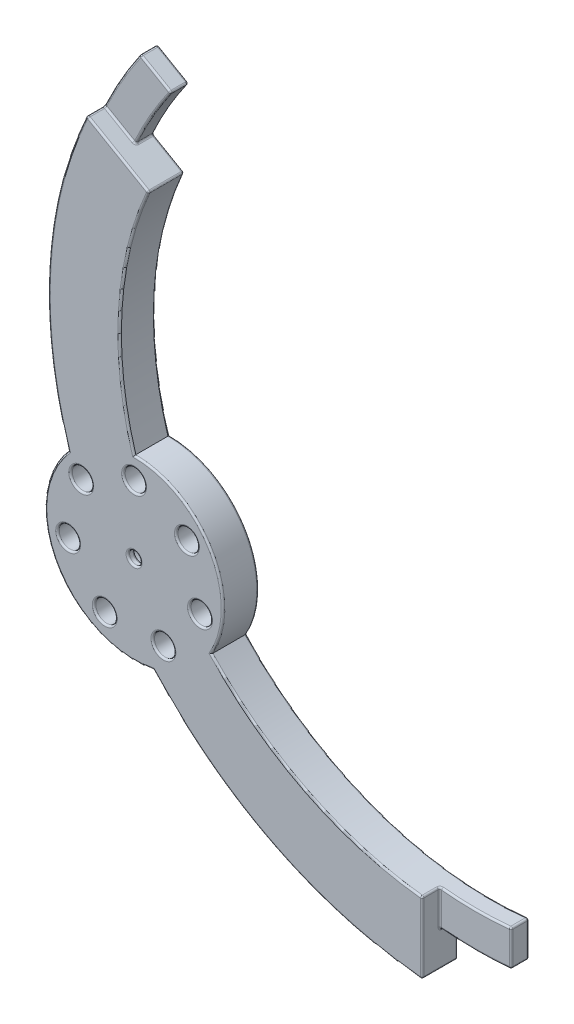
ISO-10303-21;
HEADER;
FILE_DESCRIPTION(('STEP AP214'),'2;1');
FILE_NAME('part.step','',(''),(''),'','','');
FILE_SCHEMA(('AUTOMOTIVE_DESIGN { 1 0 10303 214 1 1 1 1 }'));
ENDSEC;
DATA;
#1=APPLICATION_CONTEXT('core data for automotive mechanical design processes');
#2=APPLICATION_PROTOCOL_DEFINITION('international standard','automotive_design',2000,#1);
#3=PRODUCT_CONTEXT('',#1,'mechanical');
#4=PRODUCT('Part','Part','',(#3));
#5=PRODUCT_RELATED_PRODUCT_CATEGORY('part','',(#4));
#6=PRODUCT_DEFINITION_FORMATION('','',#4);
#7=PRODUCT_DEFINITION_CONTEXT('part definition',#1,'design');
#8=PRODUCT_DEFINITION('design','',#6,#7);
#9=PRODUCT_DEFINITION_SHAPE('','',#8);
#10=(LENGTH_UNIT() NAMED_UNIT(*) SI_UNIT(.MILLI.,.METRE.));
#11=(NAMED_UNIT(*) PLANE_ANGLE_UNIT() SI_UNIT($,.RADIAN.));
#12=(NAMED_UNIT(*) SI_UNIT($,.STERADIAN.) SOLID_ANGLE_UNIT());
#13=UNCERTAINTY_MEASURE_WITH_UNIT(LENGTH_MEASURE(1.E-05),#10,'distance_accuracy_value','');
#14=(GEOMETRIC_REPRESENTATION_CONTEXT(3) GLOBAL_UNCERTAINTY_ASSIGNED_CONTEXT((#13)) GLOBAL_UNIT_ASSIGNED_CONTEXT((#10,
#11,#12)) REPRESENTATION_CONTEXT('',''));
#15=CARTESIAN_POINT('',(0.,0.,0.));
#16=DIRECTION('',(0.,0.,1.));
#17=DIRECTION('',(1.,0.,0.));
#18=AXIS2_PLACEMENT_3D('',#15,#16,#17);
#19=CARTESIAN_POINT('',(-90.9326673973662,-52.4999999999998,-5.));
#20=DIRECTION('',(0.,0.,1.));
#21=DIRECTION('',(1.,0.,0.));
#22=AXIS2_PLACEMENT_3D('',#19,#20,#21);
#23=PLANE('',#22);
#24=CARTESIAN_POINT('',(-105.787465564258,-40.6536937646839,-5.));
#25=DIRECTION('',(0.,0.,1.));
#26=DIRECTION('',(1.,0.,0.));
#27=AXIS2_PLACEMENT_3D('',#24,#25,#26);
#28=CIRCLE('',#27,3.50000000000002);
#29=CARTESIAN_POINT('',(-102.287465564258,-40.6536937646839,-5.));
#30=VERTEX_POINT('',#29);
#31=EDGE_CURVE('E962',#30,#30,#28,.T.);
#32=ORIENTED_EDGE('',*,*,#31,.T.);
#33=EDGE_LOOP('',(#32));
#34=FACE_BOUND('',#33,.T.);
#35=CARTESIAN_POINT('',(-99.1764584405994,-69.6184084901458,-5.));
#36=DIRECTION('',(0.,0.,1.));
#37=DIRECTION('',(1.,0.,0.));
#38=AXIS2_PLACEMENT_3D('',#35,#36,#37);
#39=CIRCLE('',#38,3.5);
#40=CARTESIAN_POINT('',(-95.6764584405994,-69.6184084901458,-5.));
#41=VERTEX_POINT('',#40);
#42=EDGE_CURVE('E959',#41,#41,#39,.T.);
#43=ORIENTED_EDGE('',*,*,#42,.T.);
#44=EDGE_LOOP('',(#43));
#45=FACE_BOUND('',#44,.T.);
#46=CARTESIAN_POINT('',(-72.4090370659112,-56.7278977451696,-5.));
#47=DIRECTION('',(0.,0.,1.));
#48=DIRECTION('',(1.,0.,0.));
#49=AXIS2_PLACEMENT_3D('',#46,#47,#48);
#50=CIRCLE('',#49,3.50000000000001);
#51=CARTESIAN_POINT('',(-68.9090370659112,-56.7278977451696,-5.));
#52=VERTEX_POINT('',#51);
#53=EDGE_CURVE('E956',#52,#52,#50,.T.);
#54=ORIENTED_EDGE('',*,*,#53,.T.);
#55=EDGE_LOOP('',(#54));
#56=FACE_BOUND('',#55,.T.);
#57=CARTESIAN_POINT('',(-90.9326673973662,-52.4999999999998,-5.));
#58=DIRECTION('',(0.,0.,1.));
#59=DIRECTION('',(1.,0.,0.));
#60=AXIS2_PLACEMENT_3D('',#57,#58,#59);
#61=CIRCLE('',#60,5.00000000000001);
#62=CARTESIAN_POINT('',(-85.9326673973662,-52.4999999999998,-5.));
#63=VERTEX_POINT('',#62);
#64=EDGE_CURVE('E1965',#63,#63,#61,.T.);
#65=ORIENTED_EDGE('',*,*,#64,.T.);
#66=EDGE_LOOP('',(#65));
#67=FACE_BOUND('',#66,.T.);
#68=CARTESIAN_POINT('',(-109.456297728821,-56.7278977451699,-5.));
#69=DIRECTION('',(0.,0.,1.));
#70=DIRECTION('',(1.,0.,0.));
#71=AXIS2_PLACEMENT_3D('',#68,#69,#70);
#72=CIRCLE('',#71,3.50000000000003);
#73=CARTESIAN_POINT('',(-105.95629772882,-56.7278977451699,-5.));
#74=VERTEX_POINT('',#73);
#75=EDGE_CURVE('E1968',#74,#74,#72,.T.);
#76=ORIENTED_EDGE('',*,*,#75,.T.);
#77=EDGE_LOOP('',(#76));
#78=FACE_BOUND('',#77,.T.);
#79=CARTESIAN_POINT('',(-82.6888763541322,-69.6184084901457,-5.));
#80=DIRECTION('',(0.,0.,1.));
#81=DIRECTION('',(1.,0.,0.));
#82=AXIS2_PLACEMENT_3D('',#79,#80,#81);
#83=CIRCLE('',#82,3.5);
#84=CARTESIAN_POINT('',(-79.1888763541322,-69.6184084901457,-5.));
#85=VERTEX_POINT('',#84);
#86=EDGE_CURVE('E1971',#85,#85,#83,.T.);
#87=ORIENTED_EDGE('',*,*,#86,.T.);
#88=EDGE_LOOP('',(#87));
#89=FACE_BOUND('',#88,.T.);
#90=CARTESIAN_POINT('',(-76.0778692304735,-40.6536937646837,-5.));
#91=DIRECTION('',(0.,0.,1.));
#92=DIRECTION('',(1.,0.,0.));
#93=AXIS2_PLACEMENT_3D('',#90,#91,#92);
#94=CIRCLE('',#93,3.50000000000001);
#95=CARTESIAN_POINT('',(-72.5778692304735,-40.6536937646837,-5.));
#96=VERTEX_POINT('',#95);
#97=EDGE_CURVE('E927',#96,#96,#94,.T.);
#98=ORIENTED_EDGE('',*,*,#97,.T.);
#99=EDGE_LOOP('',(#98));
#100=FACE_BOUND('',#99,.T.);
#101=CARTESIAN_POINT('',(-90.9326673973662,-33.4999999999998,-5.));
#102=DIRECTION('',(0.,0.,1.));
#103=DIRECTION('',(1.,0.,0.));
#104=AXIS2_PLACEMENT_3D('',#101,#102,#103);
#105=CIRCLE('',#104,3.50000000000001);
#106=CARTESIAN_POINT('',(-87.4326673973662,-33.4999999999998,-5.));
#107=VERTEX_POINT('',#106);
#108=EDGE_CURVE('E922',#107,#107,#105,.T.);
#109=ORIENTED_EDGE('',*,*,#108,.T.);
#110=EDGE_LOOP('',(#109));
#111=FACE_BOUND('',#110,.T.);
#112=CARTESIAN_POINT('',(-9.5,-105.07140429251,-5.));
#113=DIRECTION('',(0.,0.,1.));
#114=DIRECTION('',(1.,0.,0.));
#115=AXIS2_PLACEMENT_3D('',#112,#113,#114);
#116=CIRCLE('',#115,1.);
#117=CARTESIAN_POINT('',(-10.5,-105.07140429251,-5.));
#118=VERTEX_POINT('',#117);
#119=CARTESIAN_POINT('',(-9.40995260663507,-104.075466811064,-5.));
#120=VERTEX_POINT('',#119);
#121=EDGE_CURVE('E953',#118,#120,#116,.F.);
#122=ORIENTED_EDGE('',*,*,#121,.F.);
#123=DIRECTION('',(0.,1.,0.));
#124=VECTOR('',#123,1.);
#125=CARTESIAN_POINT('',(-10.5,-52.4999999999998,-5.));
#126=LINE('',#125,#124);
#127=CARTESIAN_POINT('',(-10.5,-114.017542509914,-5.));
#128=VERTEX_POINT('',#127);
#129=EDGE_CURVE('E951',#118,#128,#126,.F.);
#130=ORIENTED_EDGE('',*,*,#129,.T.);
#131=CARTESIAN_POINT('',(0.,0.,-5.));
#132=DIRECTION('',(0.,0.,1.));
#133=DIRECTION('',(1.,0.,0.));
#134=AXIS2_PLACEMENT_3D('',#131,#132,#133);
#135=CIRCLE('',#134,114.5);
#136=CARTESIAN_POINT('',(-85.3280544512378,-76.3503315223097,-5.));
#137=VERTEX_POINT('',#136);
#138=EDGE_CURVE('E934',#128,#137,#135,.F.);
#139=ORIENTED_EDGE('',*,*,#138,.T.);
#140=CARTESIAN_POINT('',(-90.9326673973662,-52.4999999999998,-5.));
#141=DIRECTION('',(0.,0.,1.));
#142=DIRECTION('',(1.,0.,0.));
#143=AXIS2_PLACEMENT_3D('',#140,#141,#142);
#144=CIRCLE('',#143,24.5);
#145=CARTESIAN_POINT('',(-108.785353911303,-35.7210970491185,-5.));
#146=VERTEX_POINT('',#145);
#147=EDGE_CURVE('E918',#137,#146,#144,.F.);
#148=ORIENTED_EDGE('',*,*,#147,.T.);
#149=CARTESIAN_POINT('',(0.,0.,-5.));
#150=DIRECTION('',(0.,0.,1.));
#151=DIRECTION('',(1.,0.,0.));
#152=AXIS2_PLACEMENT_3D('',#149,#150,#151);
#153=CIRCLE('',#152,114.5);
#154=CARTESIAN_POINT('',(-94.0680145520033,65.2798486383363,-5.));
#155=VERTEX_POINT('',#154);
#156=EDGE_CURVE('E921',#146,#155,#153,.F.);
#157=ORIENTED_EDGE('',*,*,#156,.T.);
#158=DIRECTION('',(-0.866025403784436,0.500000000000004,0.));
#159=VECTOR('',#158,1.);
#160=CARTESIAN_POINT('',(-40.7163336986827,34.4772413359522,-5.));
#161=LINE('',#160,#159);
#162=CARTESIAN_POINT('',(-86.2445053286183,60.7629434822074,-5.));
#163=VERTEX_POINT('',#162);
#164=EDGE_CURVE('E924',#155,#163,#161,.F.);
#165=ORIENTED_EDGE('',*,*,#164,.T.);
#166=CARTESIAN_POINT('',(0.,0.,-5.));
#167=DIRECTION('',(0.,0.,1.));
#168=DIRECTION('',(1.,0.,0.));
#169=AXIS2_PLACEMENT_3D('',#166,#167,#168);
#170=CIRCLE('',#169,105.5);
#171=CARTESIAN_POINT('',(-95.7828072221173,44.2256016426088,-5.));
#172=VERTEX_POINT('',#171);
#173=EDGE_CURVE('E932',#163,#172,#170,.T.);
#174=ORIENTED_EDGE('',*,*,#173,.T.);
#175=CARTESIAN_POINT('',(-94.8749133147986,43.8064016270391,-5.));
#176=DIRECTION('',(0.,0.,1.));
#177=DIRECTION('',(1.,0.,0.));
#178=AXIS2_PLACEMENT_3D('',#175,#176,#177);
#179=CIRCLE('',#178,1.);
#180=CARTESIAN_POINT('',(-95.3749133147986,42.9403762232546,-5.));
#181=VERTEX_POINT('',#180);
#182=EDGE_CURVE('E936',#181,#172,#179,.F.);
#183=ORIENTED_EDGE('',*,*,#182,.F.);
#184=DIRECTION('',(-0.866025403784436,0.500000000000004,0.));
#185=VECTOR('',#184,1.);
#186=CARTESIAN_POINT('',(-50.7163336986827,17.1567332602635,-5.));
#187=LINE('',#186,#185);
#188=CARTESIAN_POINT('',(-87.4540145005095,38.3672431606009,-5.));
#189=VERTEX_POINT('',#188);
#190=EDGE_CURVE('E939',#181,#189,#187,.F.);
#191=ORIENTED_EDGE('',*,*,#190,.T.);
#192=CARTESIAN_POINT('',(0.,0.,-5.));
#193=DIRECTION('',(0.,0.,1.));
#194=DIRECTION('',(1.,0.,0.));
#195=AXIS2_PLACEMENT_3D('',#192,#193,#194);
#196=CIRCLE('',#195,95.5);
#197=CARTESIAN_POINT('',(-91.3022119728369,-28.0027871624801,-5.));
#198=VERTEX_POINT('',#197);
#199=EDGE_CURVE('E941',#189,#198,#196,.T.);
#200=ORIENTED_EDGE('',*,*,#199,.T.);
#201=CARTESIAN_POINT('',(-90.9326673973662,-52.4999999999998,-5.));
#202=DIRECTION('',(0.,0.,1.));
#203=DIRECTION('',(1.,0.,0.));
#204=AXIS2_PLACEMENT_3D('',#201,#202,#203);
#205=CIRCLE('',#204,24.5);
#206=CARTESIAN_POINT('',(-69.9022310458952,-65.0686414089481,-5.));
#207=VERTEX_POINT('',#206);
#208=EDGE_CURVE('E943',#198,#207,#205,.F.);
#209=ORIENTED_EDGE('',*,*,#208,.T.);
#210=CARTESIAN_POINT('',(0.,0.,-5.));
#211=DIRECTION('',(0.,0.,1.));
#212=DIRECTION('',(1.,0.,0.));
#213=AXIS2_PLACEMENT_3D('',#210,#211,#212);
#214=CIRCLE('',#213,95.5);
#215=CARTESIAN_POINT('',(9.5,-95.0263121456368,-5.));
#216=VERTEX_POINT('',#215);
#217=EDGE_CURVE('E945',#207,#216,#214,.T.);
#218=ORIENTED_EDGE('',*,*,#217,.T.);
#219=DIRECTION('',(0.,1.,0.));
#220=VECTOR('',#219,1.);
#221=CARTESIAN_POINT('',(9.49999999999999,-52.4999999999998,-5.));
#222=LINE('',#221,#220);
#223=CARTESIAN_POINT('',(9.5,-104.067285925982,-5.));
#224=VERTEX_POINT('',#223);
#225=EDGE_CURVE('E947',#216,#224,#222,.F.);
#226=ORIENTED_EDGE('',*,*,#225,.T.);
#227=CARTESIAN_POINT('',(0.,0.,-5.));
#228=DIRECTION('',(0.,0.,1.));
#229=DIRECTION('',(1.,0.,0.));
#230=AXIS2_PLACEMENT_3D('',#227,#228,#229);
#231=CIRCLE('',#230,104.5);
#232=EDGE_CURVE('E949',#224,#120,#231,.F.);
#233=ORIENTED_EDGE('',*,*,#232,.T.);
#234=EDGE_LOOP('',(#122,#130,#139,#148,#157,#165,#174,#183,#191,#200,#209,#218,#226,#233));
#235=FACE_BOUND('',#234,.T.);
#236=ADVANCED_FACE('F31',(#34,#45,#56,#67,#78,#89,#100,#111,#235),#23,.F.);
#237=CARTESIAN_POINT('',(-10.,-114.564392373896,5.));
#238=DIRECTION('',(-1.,0.,0.));
#239=DIRECTION('',(0.,0.,1.));
#240=AXIS2_PLACEMENT_3D('',#237,#238,#239);
#241=PLANE('',#240);
#242=CARTESIAN_POINT('',(-10.,-105.015289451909,-0.82962125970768));
#243=CARTESIAN_POINT('',(-10.,-104.501444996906,-0.649488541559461));
#244=CARTESIAN_POINT('',(-9.4574700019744,-104.54515260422,-0.664810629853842));
#245=CARTESIAN_POINT('',(-10.,-105.033868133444,-0.776770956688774));
#246=CARTESIAN_POINT('',(-10.,-104.509010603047,-0.625164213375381));
#247=CARTESIAN_POINT('',(-9.45664405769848,-104.554516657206,-0.638385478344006));
#248=CARTESIAN_POINT('',(-10.,-105.047898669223,-0.722340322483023));
#249=CARTESIAN_POINT('',(-10.,-104.514688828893,-0.600407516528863));
#250=CARTESIAN_POINT('',(-9.45602054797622,-104.561588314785,-0.611170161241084));
#251=CARTESIAN_POINT('',(-10.,-105.066661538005,-0.611939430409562));
#252=CARTESIAN_POINT('',(-10.,-104.52226429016,-0.550422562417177));
#253=CARTESIAN_POINT('',(-9.45518689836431,-104.5710451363,-0.555969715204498));
#254=CARTESIAN_POINT('',(-10.,-105.071400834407,-0.555970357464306));
#255=CARTESIAN_POINT('',(-10.,-104.524157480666,-0.525216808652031));
#256=CARTESIAN_POINT('',(-9.45497644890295,-104.573433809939,-0.527985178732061));
#257=CARTESIAN_POINT('',(-10.,-105.071407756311,-0.443937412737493));
#258=CARTESIAN_POINT('',(-10.,-104.524157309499,-0.474741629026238));
#259=CARTESIAN_POINT('',(-9.45497615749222,-104.573437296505,-0.471968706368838));
#260=CARTESIAN_POINT('',(-10.,-105.066659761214,-0.387873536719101));
#261=CARTESIAN_POINT('',(-10.,-104.52225770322,-0.449495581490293));
#262=CARTESIAN_POINT('',(-9.45518700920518,-104.57104423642,-0.443936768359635));
#263=CARTESIAN_POINT('',(-10.,-105.047816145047,-0.277351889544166));
#264=CARTESIAN_POINT('',(-10.,-104.51466145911,-0.399450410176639));
#265=CARTESIAN_POINT('',(-9.45602418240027,-104.561546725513,-0.388675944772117));
#266=CARTESIAN_POINT('',(-10.,-105.033722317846,-0.222893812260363));
#267=CARTESIAN_POINT('',(-10.,-104.508972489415,-0.374673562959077));
#268=CARTESIAN_POINT('',(-9.45665042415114,-104.554443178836,-0.361446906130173));
#269=CARTESIAN_POINT('',(-10.,-104.996606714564,-0.117151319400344));
#270=CARTESIAN_POINT('',(-10.,-104.493829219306,-0.326065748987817));
#271=CARTESIAN_POINT('',(-9.45830068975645,-104.535736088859,-0.30857565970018));
#272=CARTESIAN_POINT('',(-10.,-104.973590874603,-0.0658648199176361));
#273=CARTESIAN_POINT('',(-10.,-104.484390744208,-0.302253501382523));
#274=CARTESIAN_POINT('',(-9.45932444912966,-104.524135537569,-0.282932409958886));
#275=CARTESIAN_POINT('',(-10.,-104.919259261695,0.0321955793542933));
#276=CARTESIAN_POINT('',(-10.,-104.461801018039,-0.256047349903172));
#277=CARTESIAN_POINT('',(-9.46174331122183,-104.4967507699,-0.233902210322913));
#278=CARTESIAN_POINT('',(-10.,-104.88793225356,0.0789632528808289));
#279=CARTESIAN_POINT('',(-10.,-104.448663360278,-0.233669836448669));
#280=CARTESIAN_POINT('',(-9.46313891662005,-104.480960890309,-0.210518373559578));
#281=CARTESIAN_POINT('',(-10.,-104.817854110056,0.166643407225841));
#282=CARTESIAN_POINT('',(-10.,-104.418799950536,-0.19090640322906));
#283=CARTESIAN_POINT('',(-9.46626432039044,-104.44563864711,-0.166678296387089));
#284=CARTESIAN_POINT('',(-10.,-104.779094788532,0.207549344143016));
#285=CARTESIAN_POINT('',(-10.,-104.402092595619,-0.170530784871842));
#286=CARTESIAN_POINT('',(-9.46799448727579,-104.426102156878,-0.146225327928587));
#287=CARTESIAN_POINT('',(-10.,-104.695281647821,0.282304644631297));
#288=CARTESIAN_POINT('',(-10.,-104.365329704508,-0.132390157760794));
#289=CARTESIAN_POINT('',(-9.47174061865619,-104.383855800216,-0.10884767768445));
#290=CARTESIAN_POINT('',(-10.,-104.650227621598,0.316153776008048));
#291=CARTESIAN_POINT('',(-10.,-104.345298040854,-0.11462596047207));
#292=CARTESIAN_POINT('',(-9.47375659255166,-104.361145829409,-0.0919231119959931));
#293=CARTESIAN_POINT('',(-10.,-104.55488738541,0.375993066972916));
#294=CARTESIAN_POINT('',(-10.,-104.302139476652,-0.0822328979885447));
#295=CARTESIAN_POINT('',(-9.47802877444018,-104.313087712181,-0.0620034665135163));
#296=CARTESIAN_POINT('',(-10.,-104.504578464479,0.401947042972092));
#297=CARTESIAN_POINT('',(-10.,-104.279021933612,-0.0676111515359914));
#298=CARTESIAN_POINT('',(-9.48028602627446,-104.287728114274,-0.0490264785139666));
#299=CARTESIAN_POINT('',(-10.,-104.400396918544,0.44504120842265));
#300=CARTESIAN_POINT('',(-10.,-104.230283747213,-0.0421994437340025));
#301=CARTESIAN_POINT('',(-9.48496765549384,-104.235211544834,-0.027479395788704));
#302=CARTESIAN_POINT('',(-10.,-104.346529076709,0.46219296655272));
#303=CARTESIAN_POINT('',(-10.,-104.204686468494,-0.0313901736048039));
#304=CARTESIAN_POINT('',(-9.48739180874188,-104.208056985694,-0.0189035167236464));
#305=CARTESIAN_POINT('',(-10.,-104.236451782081,0.487316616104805));
#306=CARTESIAN_POINT('',(-10.,-104.151474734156,-0.0140505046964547));
#307=CARTESIAN_POINT('',(-9.49235345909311,-104.152566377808,-0.00634169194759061));
#308=CARTESIAN_POINT('',(-10.,-104.180233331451,0.495249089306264));
#309=CARTESIAN_POINT('',(-10.,-104.123865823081,-0.00751790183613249));
#310=CARTESIAN_POINT('',(-9.49489139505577,-104.124225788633,-0.00237545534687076));
#311=CARTESIAN_POINT('',(-10.,-104.067251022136,0.501587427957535));
#312=CARTESIAN_POINT('',(-10.,-104.067485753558,0.000788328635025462));
#313=CARTESIAN_POINT('',(-9.50000020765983,-104.067268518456,0.000793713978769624));
#314=CARTESIAN_POINT('',(-10.,-104.010487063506,0.499991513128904));
#315=CARTESIAN_POINT('',(-10.,-104.038720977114,0.00258529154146));
#316=CARTESIAN_POINT('',(-9.50257109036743,-104.038651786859,-4.24343553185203E-06));
#317=CARTESIAN_POINT('',(-10.,-103.897951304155,0.48728972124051));
#318=CARTESIAN_POINT('',(-10.,-103.980857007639,0.00113776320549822));
#319=CARTESIAN_POINT('',(-9.50767613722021,-103.981917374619,-0.00635513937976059));
#320=CARTESIAN_POINT('',(-10.,-103.842181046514,0.476170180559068));
#321=CARTESIAN_POINT('',(-10.,-103.951755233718,-0.00208865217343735));
#322=CARTESIAN_POINT('',(-9.51021024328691,-103.953800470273,-0.0119149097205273));
#323=CARTESIAN_POINT('',(-10.,-103.733245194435,0.444753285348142));
#324=CARTESIAN_POINT('',(-10.,-103.894201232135,-0.0136505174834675));
#325=CARTESIAN_POINT('',(-9.51516755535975,-103.898878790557,-0.027623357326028));
#326=CARTESIAN_POINT('',(-10.,-103.680081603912,0.424448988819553));
#327=CARTESIAN_POINT('',(-10.,-103.865738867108,-0.0219667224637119));
#328=CARTESIAN_POINT('',(-9.51759067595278,-103.872075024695,-0.0377755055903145));
#329=CARTESIAN_POINT('',(-10.,-103.629029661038,0.399736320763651));
#330=CARTESIAN_POINT('',(-10.,-103.838009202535,-0.0328948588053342));
#331=CARTESIAN_POINT('',(-9.51992110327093,-103.84633540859,-0.0501318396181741));
#332=(BOUNDED_SURFACE() B_SPLINE_SURFACE(3,2,((#242,#243,#244),(#245,#246,#247),(#248,#249,
#250),(#251,#252,#253),(#254,#255,#256),(#257,#258,#259),(#260,#261,#262),(#263,#264,#265),
(#266,#267,#268),(#269,#270,#271),(#272,#273,#274),(#275,#276,#277),(#278,#279,#280),(#281,#282,
#283),(#284,#285,#286),(#287,#288,#289),(#290,#291,#292),(#293,#294,#295),(#296,#297,#298),
(#299,#300,#301),(#302,#303,#304),(#305,#306,#307),(#308,#309,#310),(#311,#312,#313),(#314,#315,
#316),(#317,#318,#319),(#320,#321,#322),(#323,#324,#325),(#326,#327,#328),(#329,#330,#331)),
.UNSPECIFIED.,.F.,.F.,.F.) B_SPLINE_SURFACE_WITH_KNOTS((4,2,2,2,2,2,2,2,2,2,2,2,2,2,4),(3,3),
(0.,0.167840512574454,0.335555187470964,0.503546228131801,0.671505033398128,0.839352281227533,
1.00742759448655,1.17568910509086,1.34395615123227,1.51298313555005,1.68178739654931,
1.85131077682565,2.02086583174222,2.19066455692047,2.36059183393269),(0.,1.),
.UNSPECIFIED.) GEOMETRIC_REPRESENTATION_ITEM() RATIONAL_B_SPLINE_SURFACE(((1.,0.67636528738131,
1.),(1.,0.67575449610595,1.),(1.,0.675292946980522,1.),(1.,0.674675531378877,1.),(1.,
0.674519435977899,1.),(1.,0.674519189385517,1.),(1.,0.67467555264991,1.),(1.,0.675295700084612,
1.),(1.,0.675759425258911,1.),(1.,0.676979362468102,1.),(1.,0.677735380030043,1.),(1.,
0.67951755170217,1.),(1.,0.680544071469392,1.),(1.,0.682836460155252,1.),(1.,0.684102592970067,
1.),(1.,0.686835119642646,1.),(1.,0.688301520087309,1.),(1.,0.691397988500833,1.),(1.,
0.693028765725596,1.),(1.,0.696398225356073,1.),(1.,0.698136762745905,1.),(1.,0.701681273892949,
1.),(1.,0.703487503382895,1.),(1.,0.707109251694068,1.),(1.,0.708924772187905,1.),(1.,
0.712516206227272,1.),(1.,0.714292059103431,1.),(1.,0.717753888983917,1.),(1.,0.719439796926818,
1.),(1.,0.721055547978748,1.))) REPRESENTATION_ITEM('') SURFACE());
#333=CARTESIAN_POINT('',(-10.,-103.629029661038,0.399736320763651));
#334=CARTESIAN_POINT('',(-10.,-103.680081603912,0.424448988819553));
#335=CARTESIAN_POINT('',(-10.,-103.733245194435,0.444753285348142));
#336=CARTESIAN_POINT('',(-10.,-103.842181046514,0.476170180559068));
#337=CARTESIAN_POINT('',(-10.,-103.897951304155,0.48728972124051));
#338=CARTESIAN_POINT('',(-10.,-104.010487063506,0.499991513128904));
#339=CARTESIAN_POINT('',(-10.,-104.067251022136,0.501587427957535));
#340=CARTESIAN_POINT('',(-10.,-104.180233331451,0.495249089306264));
#341=CARTESIAN_POINT('',(-10.,-104.236451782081,0.487316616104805));
#342=CARTESIAN_POINT('',(-10.,-104.346529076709,0.46219296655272));
#343=CARTESIAN_POINT('',(-10.,-104.400396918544,0.44504120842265));
#344=CARTESIAN_POINT('',(-10.,-104.504578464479,0.401947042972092));
#345=CARTESIAN_POINT('',(-10.,-104.55488738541,0.375993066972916));
#346=CARTESIAN_POINT('',(-10.,-104.650227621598,0.316153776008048));
#347=CARTESIAN_POINT('',(-10.,-104.695281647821,0.282304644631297));
#348=CARTESIAN_POINT('',(-10.,-104.779094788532,0.207549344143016));
#349=CARTESIAN_POINT('',(-10.,-104.817854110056,0.166643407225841));
#350=CARTESIAN_POINT('',(-10.,-104.88793225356,0.0789632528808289));
#351=CARTESIAN_POINT('',(-10.,-104.919259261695,0.0321955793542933));
#352=CARTESIAN_POINT('',(-10.,-104.973590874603,-0.0658648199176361));
#353=CARTESIAN_POINT('',(-10.,-104.996606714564,-0.117151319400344));
#354=CARTESIAN_POINT('',(-10.,-105.033722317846,-0.222893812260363));
#355=CARTESIAN_POINT('',(-10.,-105.047816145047,-0.277351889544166));
#356=CARTESIAN_POINT('',(-10.,-105.066659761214,-0.387873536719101));
#357=CARTESIAN_POINT('',(-10.,-105.071407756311,-0.443937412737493));
#358=CARTESIAN_POINT('',(-10.,-105.071400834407,-0.555970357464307));
#359=CARTESIAN_POINT('',(-10.,-105.066661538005,-0.611939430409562));
#360=CARTESIAN_POINT('',(-10.,-105.047898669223,-0.722340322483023));
#361=CARTESIAN_POINT('',(-10.,-105.033868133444,-0.776770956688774));
#362=CARTESIAN_POINT('',(-10.,-105.015289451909,-0.82962125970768));
#363=B_SPLINE_CURVE_WITH_KNOTS('',3,(#333,#334,#335,#336,#337,#338,#339,#340,#341,#342,#343,
#344,#345,#346,#347,#348,#349,#350,#351,#352,#353,#354,#355,#356,#357,#358,#359,#360,#361,#362),
.UNSPECIFIED.,.F.,.F.,(4,2,2,2,2,2,2,2,2,2,2,2,2,2,4),(0.,0.169927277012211,0.339726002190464,
0.50928105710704,0.678804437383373,0.847608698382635,1.01663568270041,1.18490272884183,
1.35316423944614,1.52123955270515,1.68908680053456,1.85704560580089,2.02503664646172,
2.19275132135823,2.36059183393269),.UNSPECIFIED.);
#364=CARTESIAN_POINT('',(-10.,-104.067285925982,0.5));
#365=VERTEX_POINT('',#364);
#366=CARTESIAN_POINT('',(-10.,-105.07140429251,-0.5));
#367=VERTEX_POINT('',#366);
#368=EDGE_CURVE('E876',#365,#367,#363,.T.);
#369=ORIENTED_EDGE('',*,*,#368,.F.);
#370=DIRECTION('',(0.,-1.,0.));
#371=VECTOR('',#370,1.);
#372=CARTESIAN_POINT('',(-10.,-114.564392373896,0.5));
#373=LINE('',#372,#371);
#374=CARTESIAN_POINT('',(-10.,-94.9210198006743,0.5));
#375=VERTEX_POINT('',#374);
#376=EDGE_CURVE('E874',#365,#375,#373,.F.);
#377=ORIENTED_EDGE('',*,*,#376,.T.);
#378=DIRECTION('',(0.,0.,-1.));
#379=VECTOR('',#378,1.);
#380=CARTESIAN_POINT('',(-10.,-94.9210198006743,5.));
#381=LINE('',#380,#379);
#382=CARTESIAN_POINT('',(-10.,-94.9210198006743,4.5));
#383=VERTEX_POINT('',#382);
#384=EDGE_CURVE('E865',#375,#383,#381,.F.);
#385=ORIENTED_EDGE('',*,*,#384,.T.);
#386=DIRECTION('',(0.,1.,0.));
#387=VECTOR('',#386,1.);
#388=CARTESIAN_POINT('',(-10.,-114.564392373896,4.5));
#389=LINE('',#388,#387);
#390=CARTESIAN_POINT('',(-10.,-114.017542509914,4.5));
#391=VERTEX_POINT('',#390);
#392=EDGE_CURVE('E863',#383,#391,#389,.F.);
#393=ORIENTED_EDGE('',*,*,#392,.T.);
#394=DIRECTION('',(0.,0.,-1.));
#395=VECTOR('',#394,1.);
#396=CARTESIAN_POINT('',(-10.,-114.017542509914,5.));
#397=LINE('',#396,#395);
#398=CARTESIAN_POINT('',(-10.,-114.017542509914,-4.5));
#399=VERTEX_POINT('',#398);
#400=EDGE_CURVE('E867',#391,#399,#397,.T.);
#401=ORIENTED_EDGE('',*,*,#400,.T.);
#402=DIRECTION('',(0.,1.,0.));
#403=VECTOR('',#402,1.);
#404=CARTESIAN_POINT('',(-10.,-114.564392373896,-4.5));
#405=LINE('',#404,#403);
#406=CARTESIAN_POINT('',(-10.,-105.07140429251,-4.5));
#407=VERTEX_POINT('',#406);
#408=EDGE_CURVE('E870',#399,#407,#405,.T.);
#409=ORIENTED_EDGE('',*,*,#408,.T.);
#410=DIRECTION('',(0.,0.,1.));
#411=VECTOR('',#410,1.);
#412=CARTESIAN_POINT('',(-10.,-105.07140429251,0.));
#413=LINE('',#412,#411);
#414=EDGE_CURVE('E872',#407,#367,#413,.T.);
#415=ORIENTED_EDGE('',*,*,#414,.T.);
#416=EDGE_LOOP('',(#369,#377,#385,#393,#401,#409,#415));
#417=FACE_BOUND('',#416,.T.);
#418=ADVANCED_FACE('F736',(#417),#241,.F.);
#419=CARTESIAN_POINT('',(-95.5193349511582,43.6011083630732,5.));
#420=DIRECTION('',(-0.500000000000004,-0.866025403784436,0.));
#421=DIRECTION('',(0.866025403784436,-0.500000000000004,0.));
#422=AXIS2_PLACEMENT_3D('',#419,#420,#421);
#423=PLANE('',#422);
#424=CARTESIAN_POINT('',(-95.1735060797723,43.401443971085,-0.829595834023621));
#425=CARTESIAN_POINT('',(-95.5484665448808,43.6179274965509,-0.677817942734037));
#426=CARTESIAN_POINT('',(-95.3520777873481,44.0323655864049,-0.664797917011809));
#427=CARTESIAN_POINT('',(-95.1574179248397,43.3921554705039,-0.776749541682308));
#428=CARTESIAN_POINT('',(-95.5391326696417,43.612538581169,-0.649572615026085));
#429=CARTESIAN_POINT('',(-95.3443907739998,44.0269481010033,-0.638374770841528));
#430=CARTESIAN_POINT('',(-95.1452681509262,43.3851407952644,-0.722323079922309));
#431=CARTESIAN_POINT('',(-95.5320636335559,43.608457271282,-0.620257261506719));
#432=CARTESIAN_POINT('',(-95.3385856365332,44.0228565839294,-0.611161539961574));
#433=CARTESIAN_POINT('',(-95.1290203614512,43.3757601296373,-0.611930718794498));
#434=CARTESIAN_POINT('',(-95.5226031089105,43.6029952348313,-0.560638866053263));
#435=CARTESIAN_POINT('',(-95.3308225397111,44.0173848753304,-0.555965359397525));
#436=CARTESIAN_POINT('',(-95.1249163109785,43.3733906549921,-0.555966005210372));
#437=CARTESIAN_POINT('',(-95.5202007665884,43.601608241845,-0.530314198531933));
#438=CARTESIAN_POINT('',(-95.3288616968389,44.0160026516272,-0.527983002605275));
#439=CARTESIAN_POINT('',(-95.1249103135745,43.3733871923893,-0.44393977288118));
#440=CARTESIAN_POINT('',(-95.5201952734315,43.6016050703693,-0.469634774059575));
#441=CARTESIAN_POINT('',(-95.3288588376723,44.0160006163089,-0.471969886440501));
#442=CARTESIAN_POINT('',(-95.129022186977,43.3757611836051,-0.387878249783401));
#443=CARTESIAN_POINT('',(-95.522600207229,43.6029935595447,-0.439255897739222));
#444=CARTESIAN_POINT('',(-95.3308234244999,44.0173854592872,-0.443939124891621));
#445=CARTESIAN_POINT('',(-95.1453410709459,43.3851828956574,-0.277361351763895));
#446=CARTESIAN_POINT('',(-95.5321101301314,43.6084841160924,-0.379574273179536));
#447=CARTESIAN_POINT('',(-95.3386204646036,44.0228811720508,-0.388680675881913));
#448=CARTESIAN_POINT('',(-95.1575465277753,43.3922297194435,-0.222905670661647));
#449=CARTESIAN_POINT('',(-95.5392216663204,43.6125899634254,-0.350248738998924));
#450=CARTESIAN_POINT('',(-95.3444521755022,44.0269915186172,-0.361452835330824));
#451=CARTESIAN_POINT('',(-95.1896887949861,43.41078706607,-0.117168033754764));
#452=CARTESIAN_POINT('',(-95.5578553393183,43.6233481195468,-0.293678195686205));
#453=CARTESIAN_POINT('',(-95.3598100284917,44.0378148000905,-0.308584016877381));
#454=CARTESIAN_POINT('',(-95.2096204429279,43.4222946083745,-0.0658839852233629));
#455=CARTESIAN_POINT('',(-95.5693884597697,43.630006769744,-0.266413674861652));
#456=CARTESIAN_POINT('',(-95.3693337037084,44.0445259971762,-0.282941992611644));
#457=CARTESIAN_POINT('',(-95.2566709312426,43.4494592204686,0.0321719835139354));
#458=CARTESIAN_POINT('',(-95.5964322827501,43.6456205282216,-0.21480189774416));
#459=CARTESIAN_POINT('',(-95.3918160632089,44.0603663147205,-0.233914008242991));
#460=CARTESIAN_POINT('',(-95.2837995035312,43.4651219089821,0.0789376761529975));
#461=CARTESIAN_POINT('',(-95.6119670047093,43.6545895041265,-0.190447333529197));
#462=CARTESIAN_POINT('',(-95.4047793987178,44.0694987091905,-0.210531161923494));
#463=CARTESIAN_POINT('',(-95.344486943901,43.5001598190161,0.166617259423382));
#464=CARTESIAN_POINT('',(-95.6464327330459,43.6744883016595,-0.145433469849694));
#465=CARTESIAN_POINT('',(-95.4337801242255,44.089924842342,-0.166691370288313));
#466=CARTESIAN_POINT('',(-95.378053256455,43.5195393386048,0.207524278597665));
#467=CARTESIAN_POINT('',(-95.6653887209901,43.6854325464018,-0.124775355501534));
#468=CARTESIAN_POINT('',(-95.4498210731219,44.1012210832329,-0.14623786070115));
#469=CARTESIAN_POINT('',(-95.4506369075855,43.5614455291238,0.282282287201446));
#470=CARTESIAN_POINT('',(-95.7059796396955,43.7088677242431,-0.0877861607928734));
#471=CARTESIAN_POINT('',(-95.4845098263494,44.1256434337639,-0.108858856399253));
#472=CARTESIAN_POINT('',(-95.4896544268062,43.583972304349,0.316133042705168));
#473=CARTESIAN_POINT('',(-95.7276355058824,43.7213707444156,-0.0714606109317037));
#474=CARTESIAN_POINT('',(-95.5031577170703,44.1387696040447,-0.0919334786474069));
#475=CARTESIAN_POINT('',(-95.5722232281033,43.6316434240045,0.375977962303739));
#476=CARTESIAN_POINT('',(-95.7729522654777,43.7475343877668,-0.0434849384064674));
#477=CARTESIAN_POINT('',(-95.5426227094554,44.1665413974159,-0.0620110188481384));
#478=CARTESIAN_POINT('',(-95.6157944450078,43.6567992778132,0.401935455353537));
#479=CARTESIAN_POINT('',(-95.796639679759,43.7612103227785,-0.0318702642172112));
#480=CARTESIAN_POINT('',(-95.5634493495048,44.1811937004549,-0.0490322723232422));
#481=CARTESIAN_POINT('',(-95.706023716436,43.7088931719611,0.445035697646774));
#482=CARTESIAN_POINT('',(-95.8450775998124,43.7891759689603,-0.0136572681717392));
#483=CARTESIAN_POINT('',(-95.6065808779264,44.2115295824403,-0.0274821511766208));
#484=CARTESIAN_POINT('',(-95.7526776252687,43.7358288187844,0.462190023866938));
#485=CARTESIAN_POINT('',(-95.8698399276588,43.8034725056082,-0.00707204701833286));
#486=CARTESIAN_POINT('',(-95.6288837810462,44.2272117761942,-0.018904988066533));
#487=CARTESIAN_POINT('',(-95.8480116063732,43.790869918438,0.487316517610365));
#488=CARTESIAN_POINT('',(-95.9197482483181,43.8322870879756,0.00109741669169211));
#489=CARTESIAN_POINT('',(-95.6744612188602,44.2592498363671,-0.00634174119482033));
#490=CARTESIAN_POINT('',(-95.8966993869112,43.8189798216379,0.495249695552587));
#491=CARTESIAN_POINT('',(-95.9449014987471,43.8468093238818,0.00263653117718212));
#492=CARTESIAN_POINT('',(-95.6977394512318,44.2756082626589,-0.00237515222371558));
#493=CARTESIAN_POINT('',(-95.9945472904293,43.8754723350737,0.501587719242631));
#494=CARTESIAN_POINT('',(-95.9947118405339,43.8755673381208,0.000808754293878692));
#495=CARTESIAN_POINT('',(-95.7445248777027,44.308476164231,0.000793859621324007));
#496=CARTESIAN_POINT('',(-96.0437074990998,43.903854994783,0.499990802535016));
#497=CARTESIAN_POINT('',(-96.0193680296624,43.8898025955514,-0.00258399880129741));
#498=CARTESIAN_POINT('',(-95.7680321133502,44.324985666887,-4.59873245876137E-06));
#499=CARTESIAN_POINT('',(-96.1411608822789,43.9601197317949,0.487285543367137));
#500=CARTESIAN_POINT('',(-96.0674925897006,43.9175873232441,-0.0139756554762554));
#501=CARTESIAN_POINT('',(-95.8146350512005,44.3577060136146,-0.00635722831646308));
#502=CARTESIAN_POINT('',(-96.1894528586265,43.9880011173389,0.476164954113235));
#503=CARTESIAN_POINT('',(-96.0909511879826,43.931131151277,-0.0220035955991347));
#504=CARTESIAN_POINT('',(-95.8377301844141,44.3739164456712,-0.0119175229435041));
#505=CARTESIAN_POINT('',(-96.2837809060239,44.0424614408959,0.444746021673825));
#506=CARTESIAN_POINT('',(-96.1360794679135,43.9571859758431,-0.0422246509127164));
#507=CARTESIAN_POINT('',(-95.8828443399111,44.405573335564,-0.0276269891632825));
#508=CARTESIAN_POINT('',(-96.3298152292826,44.0690393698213,0.424440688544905));
#509=CARTESIAN_POINT('',(-96.1577336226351,43.9696880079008,-0.0544395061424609));
#510=CARTESIAN_POINT('',(-95.9048625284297,44.4210192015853,-0.0377796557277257));
#511=CARTESIAN_POINT('',(-96.374020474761,44.0945612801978,0.399726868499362));
#512=CARTESIAN_POINT('',(-96.1781247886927,43.9814608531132,-0.0684612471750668));
#513=CARTESIAN_POINT('',(-95.926007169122,44.4358481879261,-0.0501365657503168));
#514=(BOUNDED_SURFACE() B_SPLINE_SURFACE(3,2,((#424,#425,#426),(#427,#428,#429),(#430,#431,
#432),(#433,#434,#435),(#436,#437,#438),(#439,#440,#441),(#442,#443,#444),(#445,#446,#447),
(#448,#449,#450),(#451,#452,#453),(#454,#455,#456),(#457,#458,#459),(#460,#461,#462),(#463,#464,
#465),(#466,#467,#468),(#469,#470,#471),(#472,#473,#474),(#475,#476,#477),(#478,#479,#480),
(#481,#482,#483),(#484,#485,#486),(#487,#488,#489),(#490,#491,#492),(#493,#494,#495),(#496,#497,
#498),(#499,#500,#501),(#502,#503,#504),(#505,#506,#507),(#508,#509,#510),(#511,#512,#513)),
.UNSPECIFIED.,.F.,.F.,.F.) B_SPLINE_SURFACE_WITH_KNOTS((4,2,2,2,2,2,2,2,2,2,2,2,2,2,4),(3,3),
(0.,0.167827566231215,0.335529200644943,0.503513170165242,0.671464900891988,0.839304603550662,
1.00737243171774,1.17563579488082,1.34390473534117,1.51294388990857,1.68176016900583,
1.85128768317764,2.02084655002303,2.19062378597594,2.36053044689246),(0.,1.),
.UNSPECIFIED.) GEOMETRIC_REPRESENTATION_ITEM() RATIONAL_B_SPLINE_SURFACE(((1.,0.736811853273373,
1.),(1.,0.737387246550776,1.),(1.,0.737821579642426,1.),(1.,0.738402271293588,1.),(1.,
0.738548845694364,1.),(1.,0.738549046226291,1.),(1.,0.738402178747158,1.),(1.,0.737819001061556,
1.),(1.,0.737382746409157,1.),(1.,0.736232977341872,1.),(1.,0.735519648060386,1.),(1.,
0.733833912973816,1.),(1.,0.732861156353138,1.),(1.,0.730682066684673,1.),(1.,0.729475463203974,
1.),(1.,0.726862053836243,1.),(1.,0.72545524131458,1.),(1.,0.72247265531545,1.),(1.,
0.720896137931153,1.),(1.,0.717624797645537,1.),(1.,0.715930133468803,1.),(1.,0.712459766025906,
1.),(1.,0.710683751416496,1.),(1.,0.707106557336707,1.),(1.,0.705305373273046,1.),(1.,
0.701726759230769,1.),(1.,0.699949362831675,1.),(1.,0.696470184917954,1.),(1.,0.694768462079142,
1.),(1.,0.693130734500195,1.))) REPRESENTATION_ITEM('') SURFACE());
#515=CARTESIAN_POINT('',(-96.374020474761,44.0945612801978,0.399726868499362));
#516=CARTESIAN_POINT('',(-96.3298152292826,44.0690393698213,0.424440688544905));
#517=CARTESIAN_POINT('',(-96.2837809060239,44.0424614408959,0.444746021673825));
#518=CARTESIAN_POINT('',(-96.1894528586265,43.9880011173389,0.476164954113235));
#519=CARTESIAN_POINT('',(-96.1411608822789,43.9601197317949,0.487285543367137));
#520=CARTESIAN_POINT('',(-96.0437074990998,43.903854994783,0.499990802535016));
#521=CARTESIAN_POINT('',(-95.9945472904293,43.8754723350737,0.501587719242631));
#522=CARTESIAN_POINT('',(-95.8966993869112,43.8189798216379,0.495249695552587));
#523=CARTESIAN_POINT('',(-95.8480116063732,43.790869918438,0.487316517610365));
#524=CARTESIAN_POINT('',(-95.7526776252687,43.7358288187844,0.462190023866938));
#525=CARTESIAN_POINT('',(-95.706023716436,43.7088931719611,0.445035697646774));
#526=CARTESIAN_POINT('',(-95.6157944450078,43.6567992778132,0.401935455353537));
#527=CARTESIAN_POINT('',(-95.5722232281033,43.6316434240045,0.375977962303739));
#528=CARTESIAN_POINT('',(-95.4896544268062,43.583972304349,0.316133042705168));
#529=CARTESIAN_POINT('',(-95.4506369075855,43.5614455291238,0.282282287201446));
#530=CARTESIAN_POINT('',(-95.378053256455,43.5195393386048,0.207524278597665));
#531=CARTESIAN_POINT('',(-95.344486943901,43.5001598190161,0.166617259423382));
#532=CARTESIAN_POINT('',(-95.2837995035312,43.4651219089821,0.0789376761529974));
#533=CARTESIAN_POINT('',(-95.2566709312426,43.4494592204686,0.0321719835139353));
#534=CARTESIAN_POINT('',(-95.2096204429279,43.4222946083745,-0.0658839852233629));
#535=CARTESIAN_POINT('',(-95.1896887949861,43.41078706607,-0.117168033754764));
#536=CARTESIAN_POINT('',(-95.1575465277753,43.3922297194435,-0.222905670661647));
#537=CARTESIAN_POINT('',(-95.1453410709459,43.3851828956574,-0.277361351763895));
#538=CARTESIAN_POINT('',(-95.129022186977,43.3757611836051,-0.387878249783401));
#539=CARTESIAN_POINT('',(-95.1249103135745,43.3733871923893,-0.44393977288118));
#540=CARTESIAN_POINT('',(-95.1249163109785,43.3733906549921,-0.555966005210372));
#541=CARTESIAN_POINT('',(-95.1290203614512,43.3757601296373,-0.611930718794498));
#542=CARTESIAN_POINT('',(-95.1452681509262,43.3851407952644,-0.722323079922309));
#543=CARTESIAN_POINT('',(-95.1574179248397,43.392155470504,-0.776749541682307));
#544=CARTESIAN_POINT('',(-95.1735060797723,43.401443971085,-0.829595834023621));
#545=B_SPLINE_CURVE_WITH_KNOTS('',3,(#515,#516,#517,#518,#519,#520,#521,#522,#523,#524,#525,
#526,#527,#528,#529,#530,#531,#532,#533,#534,#535,#536,#537,#538,#539,#540,#541,#542,#543,#544),
.UNSPECIFIED.,.F.,.F.,(4,2,2,2,2,2,2,2,2,2,2,2,2,2,4),(0.,0.169906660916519,0.339683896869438,
0.509242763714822,0.678770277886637,0.847586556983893,1.01662571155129,1.18489465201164,
1.35315801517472,1.5212258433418,1.68906554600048,1.85701727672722,2.02500124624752,
2.19270288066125,2.36053044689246),.UNSPECIFIED.);
#546=CARTESIAN_POINT('',(-95.9945053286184,43.8754481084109,0.5));
#547=VERTEX_POINT('',#546);
#548=CARTESIAN_POINT('',(-95.1249133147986,43.3733889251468,-0.5));
#549=VERTEX_POINT('',#548);
#550=EDGE_CURVE('E789',#547,#549,#545,.T.);
#551=ORIENTED_EDGE('',*,*,#550,.F.);
#552=DIRECTION('',(0.866025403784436,-0.500000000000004,0.));
#553=VECTOR('',#552,1.);
#554=CARTESIAN_POINT('',(-95.5193349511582,43.6011083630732,0.5));
#555=LINE('',#554,#553);
#556=CARTESIAN_POINT('',(-103.742088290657,48.348517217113,0.5));
#557=VERTEX_POINT('',#556);
#558=EDGE_CURVE('E328',#547,#557,#555,.F.);
#559=ORIENTED_EDGE('',*,*,#558,.T.);
#560=DIRECTION('',(0.,0.,-1.));
#561=VECTOR('',#560,1.);
#562=CARTESIAN_POINT('',(-103.742088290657,48.348517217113,5.));
#563=LINE('',#562,#561);
#564=CARTESIAN_POINT('',(-103.742088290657,48.348517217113,4.5));
#565=VERTEX_POINT('',#564);
#566=EDGE_CURVE('E1114',#557,#565,#563,.F.);
#567=ORIENTED_EDGE('',*,*,#566,.T.);
#568=DIRECTION('',(-0.866025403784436,0.500000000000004,0.));
#569=VECTOR('',#568,1.);
#570=CARTESIAN_POINT('',(-86.8153408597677,38.575855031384,4.5));
#571=LINE('',#570,#569);
#572=CARTESIAN_POINT('',(-87.2040145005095,38.8002558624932,4.5));
#573=VERTEX_POINT('',#572);
#574=EDGE_CURVE('E1109',#565,#573,#571,.F.);
#575=ORIENTED_EDGE('',*,*,#574,.T.);
#576=DIRECTION('',(0.,0.,-1.));
#577=VECTOR('',#576,1.);
#578=CARTESIAN_POINT('',(-87.2040145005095,38.8002558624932,5.));
#579=LINE('',#578,#577);
#580=CARTESIAN_POINT('',(-87.2040145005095,38.8002558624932,-4.5));
#581=VERTEX_POINT('',#580);
#582=EDGE_CURVE('E1117',#573,#581,#579,.T.);
#583=ORIENTED_EDGE('',*,*,#582,.T.);
#584=DIRECTION('',(-0.866025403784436,0.500000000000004,0.));
#585=VECTOR('',#584,1.);
#586=CARTESIAN_POINT('',(-95.5193349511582,43.6011083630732,-4.5));
#587=LINE('',#586,#585);
#588=CARTESIAN_POINT('',(-95.1249133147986,43.3733889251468,-4.5));
#589=VERTEX_POINT('',#588);
#590=EDGE_CURVE('E1124',#581,#589,#587,.T.);
#591=ORIENTED_EDGE('',*,*,#590,.T.);
#592=DIRECTION('',(0.,0.,1.));
#593=VECTOR('',#592,1.);
#594=CARTESIAN_POINT('',(-95.1249133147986,43.3733889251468,0.));
#595=LINE('',#594,#593);
#596=EDGE_CURVE('E1125',#589,#549,#595,.T.);
#597=ORIENTED_EDGE('',*,*,#596,.T.);
#598=EDGE_LOOP('',(#551,#559,#567,#575,#583,#591,#597));
#599=FACE_BOUND('',#598,.T.);
#600=ADVANCED_FACE('F742',(#599),#423,.F.);
#601=CARTESIAN_POINT('',(-90.9326673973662,-52.4999999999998,5.));
#602=DIRECTION('',(0.,0.,-1.));
#603=DIRECTION('',(-1.,0.,0.));
#604=AXIS2_PLACEMENT_3D('',#601,#602,#603);
#605=CYLINDRICAL_SURFACE('',#604,1.75);
#606=CARTESIAN_POINT('',(-90.9326673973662,-52.4999999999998,3.5));
#607=DIRECTION('',(0.,0.,-1.));
#608=DIRECTION('',(-1.,0.,0.));
#609=AXIS2_PLACEMENT_3D('',#606,#607,#608);
#610=CIRCLE('',#609,1.75);
#611=CARTESIAN_POINT('',(-92.6826673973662,-52.4999999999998,3.5));
#612=VERTEX_POINT('',#611);
#613=EDGE_CURVE('E1962',#612,#612,#610,.T.);
#614=ORIENTED_EDGE('',*,*,#613,.T.);
#615=EDGE_LOOP('',(#614));
#616=FACE_BOUND('',#615,.T.);
#617=CARTESIAN_POINT('',(-90.9326673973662,-52.4999999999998,4.5));
#618=DIRECTION('',(0.,0.,1.));
#619=DIRECTION('',(1.,0.,0.));
#620=AXIS2_PLACEMENT_3D('',#617,#618,#619);
#621=CIRCLE('',#620,1.75);
#622=CARTESIAN_POINT('',(-89.1826673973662,-52.4999999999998,4.5));
#623=VERTEX_POINT('',#622);
#624=EDGE_CURVE('E1959',#623,#623,#621,.T.);
#625=ORIENTED_EDGE('',*,*,#624,.T.);
#626=EDGE_LOOP('',(#625));
#627=FACE_BOUND('',#626,.T.);
#628=ADVANCED_FACE('F801',(#616,#627),#605,.F.);
#629=CARTESIAN_POINT('',(0.,0.,5.));
#630=DIRECTION('',(0.,0.,-1.));
#631=DIRECTION('',(-1.,0.,0.));
#632=AXIS2_PLACEMENT_3D('',#629,#630,#631);
#633=CYLINDRICAL_SURFACE('',#632,105.);
#634=CARTESIAN_POINT('',(0.,0.,-4.5));
#635=DIRECTION('',(0.,0.,1.));
#636=DIRECTION('',(1.,0.,0.));
#637=AXIS2_PLACEMENT_3D('',#634,#635,#636);
#638=CIRCLE('',#637,105.);
#639=CARTESIAN_POINT('',(-9.45497630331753,-104.573435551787,-4.5));
#640=VERTEX_POINT('',#639);
#641=CARTESIAN_POINT('',(9.54545454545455,-104.565215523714,-4.5));
#642=VERTEX_POINT('',#641);
#643=EDGE_CURVE('E845',#640,#642,#638,.T.);
#644=ORIENTED_EDGE('',*,*,#643,.T.);
#645=DIRECTION('',(0.,0.,-1.));
#646=VECTOR('',#645,1.);
#647=CARTESIAN_POINT('',(9.54545454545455,-104.565215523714,5.));
#648=LINE('',#647,#646);
#649=CARTESIAN_POINT('',(9.54545454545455,-104.565215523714,-0.5));
#650=VERTEX_POINT('',#649);
#651=EDGE_CURVE('E851',#642,#650,#648,.F.);
#652=ORIENTED_EDGE('',*,*,#651,.T.);
#653=CARTESIAN_POINT('',(0.,0.,-0.5));
#654=DIRECTION('',(0.,0.,1.));
#655=DIRECTION('',(1.,0.,0.));
#656=AXIS2_PLACEMENT_3D('',#653,#654,#655);
#657=CIRCLE('',#656,105.);
#658=CARTESIAN_POINT('',(-9.45497630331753,-104.573435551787,-0.5));
#659=VERTEX_POINT('',#658);
#660=EDGE_CURVE('E849',#650,#659,#657,.F.);
#661=ORIENTED_EDGE('',*,*,#660,.T.);
#662=DIRECTION('',(0.,0.,-1.));
#663=VECTOR('',#662,1.);
#664=CARTESIAN_POINT('',(-9.45497630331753,-104.573435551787,5.));
#665=LINE('',#664,#663);
#666=EDGE_CURVE('E847',#659,#640,#665,.T.);
#667=ORIENTED_EDGE('',*,*,#666,.T.);
#668=EDGE_LOOP('',(#644,#652,#661,#667));
#669=FACE_BOUND('',#668,.T.);
#670=ADVANCED_FACE('F887',(#669),#633,.T.);
#671=CARTESIAN_POINT('',(10.,-104.522724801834,5.));
#672=DIRECTION('',(-1.,0.,0.));
#673=DIRECTION('',(0.,0.,1.));
#674=AXIS2_PLACEMENT_3D('',#671,#672,#673);
#675=PLANE('',#674);
#676=DIRECTION('',(0.,0.,-1.));
#677=VECTOR('',#676,1.);
#678=CARTESIAN_POINT('',(10.,-95.0263121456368,5.));
#679=LINE('',#678,#677);
#680=CARTESIAN_POINT('',(10.,-95.0263121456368,-4.5));
#681=VERTEX_POINT('',#680);
#682=CARTESIAN_POINT('',(10.,-95.0263121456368,-0.5));
#683=VERTEX_POINT('',#682);
#684=EDGE_CURVE('E840',#681,#683,#679,.F.);
#685=ORIENTED_EDGE('',*,*,#684,.T.);
#686=DIRECTION('',(0.,1.,0.));
#687=VECTOR('',#686,1.);
#688=CARTESIAN_POINT('',(10.,-104.522724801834,-0.5));
#689=LINE('',#688,#687);
#690=CARTESIAN_POINT('',(10.,-104.067285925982,-0.5));
#691=VERTEX_POINT('',#690);
#692=EDGE_CURVE('E843',#683,#691,#689,.F.);
#693=ORIENTED_EDGE('',*,*,#692,.T.);
#694=DIRECTION('',(0.,0.,-1.));
#695=VECTOR('',#694,1.);
#696=CARTESIAN_POINT('',(10.,-104.067285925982,5.));
#697=LINE('',#696,#695);
#698=CARTESIAN_POINT('',(10.,-104.067285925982,-4.5));
#699=VERTEX_POINT('',#698);
#700=EDGE_CURVE('E838',#691,#699,#697,.T.);
#701=ORIENTED_EDGE('',*,*,#700,.T.);
#702=DIRECTION('',(0.,1.,0.));
#703=VECTOR('',#702,1.);
#704=CARTESIAN_POINT('',(10.,-104.522724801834,-4.5));
#705=LINE('',#704,#703);
#706=EDGE_CURVE('E836',#699,#681,#705,.T.);
#707=ORIENTED_EDGE('',*,*,#706,.T.);
#708=EDGE_LOOP('',(#685,#693,#701,#707));
#709=FACE_BOUND('',#708,.T.);
#710=ADVANCED_FACE('F817',(#709),#675,.F.);
#711=CARTESIAN_POINT('',(0.,0.,5.));
#712=DIRECTION('',(0.,0.,-1.));
#713=DIRECTION('',(-1.,0.,0.));
#714=AXIS2_PLACEMENT_3D('',#711,#712,#713);
#715=CYLINDRICAL_SURFACE('',#714,105.);
#716=DIRECTION('',(0.,0.,-1.));
#717=VECTOR('',#716,1.);
#718=CARTESIAN_POINT('',(-95.328860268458,44.0160016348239,5.));
#719=LINE('',#718,#717);
#720=CARTESIAN_POINT('',(-95.3288602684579,44.0160016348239,-0.5));
#721=VERTEX_POINT('',#720);
#722=CARTESIAN_POINT('',(-95.3288602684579,44.0160016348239,-4.5));
#723=VERTEX_POINT('',#722);
#724=EDGE_CURVE('E1153',#721,#723,#719,.T.);
#725=ORIENTED_EDGE('',*,*,#724,.T.);
#726=CARTESIAN_POINT('',(0.,0.,-4.5));
#727=DIRECTION('',(0.,0.,1.));
#728=DIRECTION('',(1.,0.,0.));
#729=AXIS2_PLACEMENT_3D('',#726,#727,#728);
#730=CIRCLE('',#729,105.);
#731=CARTESIAN_POINT('',(-85.8357635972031,60.4749674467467,-4.5));
#732=VERTEX_POINT('',#731);
#733=EDGE_CURVE('E1115',#723,#732,#730,.F.);
#734=ORIENTED_EDGE('',*,*,#733,.T.);
#735=DIRECTION('',(0.,0.,-1.));
#736=VECTOR('',#735,1.);
#737=CARTESIAN_POINT('',(-85.8357635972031,60.4749674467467,5.));
#738=LINE('',#737,#736);
#739=CARTESIAN_POINT('',(-85.8357635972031,60.4749674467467,-0.5));
#740=VERTEX_POINT('',#739);
#741=EDGE_CURVE('E1119',#732,#740,#738,.F.);
#742=ORIENTED_EDGE('',*,*,#741,.T.);
#743=CARTESIAN_POINT('',(0.,0.,-0.5));
#744=DIRECTION('',(0.,0.,1.));
#745=DIRECTION('',(1.,0.,0.));
#746=AXIS2_PLACEMENT_3D('',#743,#744,#745);
#747=CIRCLE('',#746,105.);
#748=EDGE_CURVE('E1151',#740,#721,#747,.T.);
#749=ORIENTED_EDGE('',*,*,#748,.T.);
#750=EDGE_LOOP('',(#725,#734,#742,#749));
#751=FACE_BOUND('',#750,.T.);
#752=ADVANCED_FACE('F803',(#751),#715,.F.);
#753=CARTESIAN_POINT('',(-94.2156741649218,65.9424502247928,5.));
#754=DIRECTION('',(-0.500000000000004,-0.866025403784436,0.));
#755=DIRECTION('',(0.866025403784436,-0.500000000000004,0.));
#756=AXIS2_PLACEMENT_3D('',#753,#754,#755);
#757=PLANE('',#756);
#758=DIRECTION('',(0.,0.,-1.));
#759=VECTOR('',#758,1.);
#760=CARTESIAN_POINT('',(-93.8180145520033,65.7128613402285,5.));
#761=LINE('',#760,#759);
#762=CARTESIAN_POINT('',(-93.8180145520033,65.7128613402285,-4.5));
#763=VERTEX_POINT('',#762);
#764=CARTESIAN_POINT('',(-93.8180145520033,65.7128613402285,-0.5));
#765=VERTEX_POINT('',#764);
#766=EDGE_CURVE('E1146',#763,#765,#761,.F.);
#767=ORIENTED_EDGE('',*,*,#766,.T.);
#768=DIRECTION('',(-0.866025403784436,0.500000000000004,0.));
#769=VECTOR('',#768,1.);
#770=CARTESIAN_POINT('',(-85.5193349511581,60.921616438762,-0.5));
#771=LINE('',#770,#769);
#772=CARTESIAN_POINT('',(-85.9945053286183,61.1959561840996,-0.5));
#773=VERTEX_POINT('',#772);
#774=EDGE_CURVE('E1149',#765,#773,#771,.F.);
#775=ORIENTED_EDGE('',*,*,#774,.T.);
#776=DIRECTION('',(0.,0.,-1.));
#777=VECTOR('',#776,1.);
#778=CARTESIAN_POINT('',(-85.9945053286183,61.1959561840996,5.));
#779=LINE('',#778,#777);
#780=CARTESIAN_POINT('',(-85.9945053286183,61.1959561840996,-4.5));
#781=VERTEX_POINT('',#780);
#782=EDGE_CURVE('E1144',#773,#781,#779,.T.);
#783=ORIENTED_EDGE('',*,*,#782,.T.);
#784=DIRECTION('',(-0.866025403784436,0.500000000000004,0.));
#785=VECTOR('',#784,1.);
#786=CARTESIAN_POINT('',(-94.2156741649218,65.9424502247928,-4.5));
#787=LINE('',#786,#785);
#788=EDGE_CURVE('E1140',#781,#763,#787,.T.);
#789=ORIENTED_EDGE('',*,*,#788,.T.);
#790=EDGE_LOOP('',(#767,#775,#783,#789));
#791=FACE_BOUND('',#790,.T.);
#792=ADVANCED_FACE('F757',(#791),#757,.F.);
#793=CARTESIAN_POINT('',(-90.9326673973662,-52.4999999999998,5.));
#794=DIRECTION('',(0.,0.,1.));
#795=DIRECTION('',(1.,0.,0.));
#796=AXIS2_PLACEMENT_3D('',#793,#794,#795);
#797=PLANE('',#796);
#798=CARTESIAN_POINT('',(-105.787465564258,-40.6536937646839,5.));
#799=DIRECTION('',(0.,0.,1.));
#800=DIRECTION('',(1.,0.,0.));
#801=AXIS2_PLACEMENT_3D('',#798,#799,#800);
#802=CIRCLE('',#801,3.50000000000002);
#803=CARTESIAN_POINT('',(-102.287465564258,-40.6536937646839,5.));
#804=VERTEX_POINT('',#803);
#805=EDGE_CURVE('E11',#804,#804,#802,.F.);
#806=ORIENTED_EDGE('',*,*,#805,.T.);
#807=EDGE_LOOP('',(#806));
#808=FACE_BOUND('',#807,.T.);
#809=CARTESIAN_POINT('',(-99.1764584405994,-69.6184084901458,5.));
#810=DIRECTION('',(0.,0.,1.));
#811=DIRECTION('',(1.,0.,0.));
#812=AXIS2_PLACEMENT_3D('',#809,#810,#811);
#813=CIRCLE('',#812,3.5);
#814=CARTESIAN_POINT('',(-95.6764584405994,-69.6184084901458,5.));
#815=VERTEX_POINT('',#814);
#816=EDGE_CURVE('E40',#815,#815,#813,.F.);
#817=ORIENTED_EDGE('',*,*,#816,.T.);
#818=EDGE_LOOP('',(#817));
#819=FACE_BOUND('',#818,.T.);
#820=CARTESIAN_POINT('',(-72.4090370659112,-56.7278977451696,5.));
#821=DIRECTION('',(0.,0.,1.));
#822=DIRECTION('',(1.,0.,0.));
#823=AXIS2_PLACEMENT_3D('',#820,#821,#822);
#824=CIRCLE('',#823,3.50000000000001);
#825=CARTESIAN_POINT('',(-68.9090370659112,-56.7278977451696,5.));
#826=VERTEX_POINT('',#825);
#827=EDGE_CURVE('E1042',#826,#826,#824,.F.);
#828=ORIENTED_EDGE('',*,*,#827,.T.);
#829=EDGE_LOOP('',(#828));
#830=FACE_BOUND('',#829,.T.);
#831=CARTESIAN_POINT('',(-90.9326673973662,-52.4999999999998,5.));
#832=DIRECTION('',(0.,0.,1.));
#833=DIRECTION('',(1.,0.,0.));
#834=AXIS2_PLACEMENT_3D('',#831,#832,#833);
#835=CIRCLE('',#834,2.25);
#836=CARTESIAN_POINT('',(-88.6826673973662,-52.4999999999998,5.));
#837=VERTEX_POINT('',#836);
#838=EDGE_CURVE('E1039',#837,#837,#835,.F.);
#839=ORIENTED_EDGE('',*,*,#838,.T.);
#840=EDGE_LOOP('',(#839));
#841=FACE_BOUND('',#840,.T.);
#842=CARTESIAN_POINT('',(-90.9326673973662,-33.4999999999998,5.));
#843=DIRECTION('',(0.,0.,1.));
#844=DIRECTION('',(1.,0.,0.));
#845=AXIS2_PLACEMENT_3D('',#842,#843,#844);
#846=CIRCLE('',#845,3.50000000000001);
#847=CARTESIAN_POINT('',(-87.4326673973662,-33.4999999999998,5.));
#848=VERTEX_POINT('',#847);
#849=EDGE_CURVE('E1036',#848,#848,#846,.F.);
#850=ORIENTED_EDGE('',*,*,#849,.T.);
#851=EDGE_LOOP('',(#850));
#852=FACE_BOUND('',#851,.T.);
#853=CARTESIAN_POINT('',(-76.0778692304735,-40.6536937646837,5.));
#854=DIRECTION('',(0.,0.,1.));
#855=DIRECTION('',(1.,0.,0.));
#856=AXIS2_PLACEMENT_3D('',#853,#854,#855);
#857=CIRCLE('',#856,3.50000000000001);
#858=CARTESIAN_POINT('',(-72.5778692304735,-40.6536937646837,5.));
#859=VERTEX_POINT('',#858);
#860=EDGE_CURVE('E1033',#859,#859,#857,.F.);
#861=ORIENTED_EDGE('',*,*,#860,.T.);
#862=EDGE_LOOP('',(#861));
#863=FACE_BOUND('',#862,.T.);
#864=CARTESIAN_POINT('',(-82.6888763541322,-69.6184084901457,5.));
#865=DIRECTION('',(0.,0.,1.));
#866=DIRECTION('',(1.,0.,0.));
#867=AXIS2_PLACEMENT_3D('',#864,#865,#866);
#868=CIRCLE('',#867,3.5);
#869=CARTESIAN_POINT('',(-79.1888763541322,-69.6184084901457,5.));
#870=VERTEX_POINT('',#869);
#871=EDGE_CURVE('E1030',#870,#870,#868,.F.);
#872=ORIENTED_EDGE('',*,*,#871,.T.);
#873=EDGE_LOOP('',(#872));
#874=FACE_BOUND('',#873,.T.);
#875=CARTESIAN_POINT('',(-109.456297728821,-56.7278977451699,5.));
#876=DIRECTION('',(0.,0.,1.));
#877=DIRECTION('',(1.,0.,0.));
#878=AXIS2_PLACEMENT_3D('',#875,#876,#877);
#879=CIRCLE('',#878,3.50000000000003);
#880=CARTESIAN_POINT('',(-105.95629772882,-56.7278977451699,5.));
#881=VERTEX_POINT('',#880);
#882=EDGE_CURVE('E1027',#881,#881,#879,.F.);
#883=ORIENTED_EDGE('',*,*,#882,.T.);
#884=EDGE_LOOP('',(#883));
#885=FACE_BOUND('',#884,.T.);
#886=CARTESIAN_POINT('',(-90.9326673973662,-52.4999999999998,5.));
#887=DIRECTION('',(0.,0.,1.));
#888=DIRECTION('',(1.,0.,0.));
#889=AXIS2_PLACEMENT_3D('',#886,#887,#888);
#890=CIRCLE('',#889,24.5);
#891=CARTESIAN_POINT('',(-108.785353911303,-35.7210970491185,5.));
#892=VERTEX_POINT('',#891);
#893=CARTESIAN_POINT('',(-85.3280544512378,-76.3503315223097,5.));
#894=VERTEX_POINT('',#893);
#895=EDGE_CURVE('E48',#892,#894,#890,.T.);
#896=ORIENTED_EDGE('',*,*,#895,.T.);
#897=CARTESIAN_POINT('',(0.,0.,5.));
#898=DIRECTION('',(0.,0.,1.));
#899=DIRECTION('',(1.,0.,0.));
#900=AXIS2_PLACEMENT_3D('',#897,#898,#899);
#901=CIRCLE('',#900,114.5);
#902=CARTESIAN_POINT('',(-10.5,-114.017542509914,5.));
#903=VERTEX_POINT('',#902);
#904=EDGE_CURVE('E1025',#894,#903,#901,.T.);
#905=ORIENTED_EDGE('',*,*,#904,.T.);
#906=DIRECTION('',(0.,1.,0.));
#907=VECTOR('',#906,1.);
#908=CARTESIAN_POINT('',(-10.5,-94.4722181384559,5.));
#909=LINE('',#908,#907);
#910=CARTESIAN_POINT('',(-10.5,-94.9210198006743,5.));
#911=VERTEX_POINT('',#910);
#912=EDGE_CURVE('E1013',#903,#911,#909,.T.);
#913=ORIENTED_EDGE('',*,*,#912,.T.);
#914=CARTESIAN_POINT('',(0.,0.,5.));
#915=DIRECTION('',(0.,0.,1.));
#916=DIRECTION('',(1.,0.,0.));
#917=AXIS2_PLACEMENT_3D('',#914,#915,#916);
#918=CIRCLE('',#917,95.5);
#919=CARTESIAN_POINT('',(-69.9022310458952,-65.0686414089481,5.));
#920=VERTEX_POINT('',#919);
#921=EDGE_CURVE('E1015',#911,#920,#918,.F.);
#922=ORIENTED_EDGE('',*,*,#921,.T.);
#923=CARTESIAN_POINT('',(-90.9326673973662,-52.4999999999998,5.));
#924=DIRECTION('',(0.,0.,1.));
#925=DIRECTION('',(1.,0.,0.));
#926=AXIS2_PLACEMENT_3D('',#923,#924,#925);
#927=CIRCLE('',#926,24.5);
#928=CARTESIAN_POINT('',(-91.3022119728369,-28.0027871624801,5.));
#929=VERTEX_POINT('',#928);
#930=EDGE_CURVE('E1017',#920,#929,#927,.T.);
#931=ORIENTED_EDGE('',*,*,#930,.T.);
#932=CARTESIAN_POINT('',(0.,0.,5.));
#933=DIRECTION('',(0.,0.,1.));
#934=DIRECTION('',(1.,0.,0.));
#935=AXIS2_PLACEMENT_3D('',#932,#933,#934);
#936=CIRCLE('',#935,95.5);
#937=CARTESIAN_POINT('',(-87.4540145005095,38.3672431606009,5.));
#938=VERTEX_POINT('',#937);
#939=EDGE_CURVE('E1019',#929,#938,#936,.F.);
#940=ORIENTED_EDGE('',*,*,#939,.T.);
#941=DIRECTION('',(-0.866025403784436,0.500000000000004,0.));
#942=VECTOR('',#941,1.);
#943=CARTESIAN_POINT('',(-104.465674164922,48.1889294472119,5.));
#944=LINE('',#943,#942);
#945=CARTESIAN_POINT('',(-103.992088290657,47.9155045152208,5.));
#946=VERTEX_POINT('',#945);
#947=EDGE_CURVE('E1021',#938,#946,#944,.T.);
#948=ORIENTED_EDGE('',*,*,#947,.T.);
#949=CARTESIAN_POINT('',(0.,0.,5.));
#950=DIRECTION('',(0.,0.,1.));
#951=DIRECTION('',(1.,0.,0.));
#952=AXIS2_PLACEMENT_3D('',#949,#950,#951);
#953=CIRCLE('',#952,114.5);
#954=EDGE_CURVE('E53',#946,#892,#953,.T.);
#955=ORIENTED_EDGE('',*,*,#954,.T.);
#956=EDGE_LOOP('',(#896,#905,#913,#922,#931,#940,#948,#955));
#957=FACE_BOUND('',#956,.T.);
#958=ADVANCED_FACE('F748',(#808,#819,#830,#841,#852,#863,#874,#885,#957),#797,.T.);
#959=CARTESIAN_POINT('',(-90.9326673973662,-52.4999999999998,5.));
#960=DIRECTION('',(0.,0.,-1.));
#961=DIRECTION('',(-1.,0.,0.));
#962=AXIS2_PLACEMENT_3D('',#959,#960,#961);
#963=CYLINDRICAL_SURFACE('',#962,25.);
#964=DIRECTION('',(0.,0.,-1.));
#965=VECTOR('',#964,1.);
#966=CARTESIAN_POINT('',(-109.352097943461,-35.5966104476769,5.));
#967=LINE('',#966,#965);
#968=CARTESIAN_POINT('',(-109.352097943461,-35.5966104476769,4.5));
#969=VERTEX_POINT('',#968);
#970=CARTESIAN_POINT('',(-109.352097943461,-35.5966104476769,-4.5));
#971=VERTEX_POINT('',#970);
#972=EDGE_CURVE('E1200',#969,#971,#967,.T.);
#973=ORIENTED_EDGE('',*,*,#972,.T.);
#974=CARTESIAN_POINT('',(-90.9326673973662,-52.4999999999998,-4.5));
#975=DIRECTION('',(0.,0.,1.));
#976=DIRECTION('',(1.,0.,0.));
#977=AXIS2_PLACEMENT_3D('',#974,#975,#976);
#978=CIRCLE('',#977,25.);
#979=CARTESIAN_POINT('',(-85.5036179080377,-76.9033895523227,-4.5));
#980=VERTEX_POINT('',#979);
#981=EDGE_CURVE('E916',#971,#980,#978,.T.);
#982=ORIENTED_EDGE('',*,*,#981,.T.);
#983=DIRECTION('',(0.,0.,-1.));
#984=VECTOR('',#983,1.);
#985=CARTESIAN_POINT('',(-85.5036179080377,-76.9033895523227,5.));
#986=LINE('',#985,#984);
#987=CARTESIAN_POINT('',(-85.5036179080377,-76.9033895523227,4.5));
#988=VERTEX_POINT('',#987);
#989=EDGE_CURVE('E316',#988,#980,#986,.T.);
#990=ORIENTED_EDGE('',*,*,#989,.F.);
#991=CARTESIAN_POINT('',(-90.9326673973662,-52.4999999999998,4.5));
#992=DIRECTION('',(0.,0.,1.));
#993=DIRECTION('',(1.,0.,0.));
#994=AXIS2_PLACEMENT_3D('',#991,#992,#993);
#995=CIRCLE('',#994,25.);
#996=EDGE_CURVE('E986',#988,#969,#995,.F.);
#997=ORIENTED_EDGE('',*,*,#996,.T.);
#998=EDGE_LOOP('',(#973,#982,#990,#997));
#999=FACE_BOUND('',#998,.T.);
#1000=ADVANCED_FACE('F782',(#999),#963,.T.);
#1001=CARTESIAN_POINT('',(0.,0.,5.));
#1002=DIRECTION('',(0.,0.,-1.));
#1003=DIRECTION('',(-1.,0.,0.));
#1004=AXIS2_PLACEMENT_3D('',#1001,#1002,#1003);
#1005=CYLINDRICAL_SURFACE('',#1004,115.);
#1006=ORIENTED_EDGE('',*,*,#989,.T.);
#1007=CARTESIAN_POINT('',(0.,0.,-4.5));
#1008=DIRECTION('',(0.,0.,1.));
#1009=DIRECTION('',(1.,0.,0.));
#1010=AXIS2_PLACEMENT_3D('',#1007,#1008,#1009);
#1011=CIRCLE('',#1010,115.);
#1012=CARTESIAN_POINT('',(-10.5458515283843,-114.515435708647,-4.5));
#1013=VERTEX_POINT('',#1012);
#1014=EDGE_CURVE('E898',#980,#1013,#1011,.T.);
#1015=ORIENTED_EDGE('',*,*,#1014,.T.);
#1016=DIRECTION('',(0.,0.,-1.));
#1017=VECTOR('',#1016,1.);
#1018=CARTESIAN_POINT('',(-10.5458515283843,-114.515435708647,5.));
#1019=LINE('',#1018,#1017);
#1020=CARTESIAN_POINT('',(-10.5458515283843,-114.515435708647,4.5));
#1021=VERTEX_POINT('',#1020);
#1022=EDGE_CURVE('E911',#1013,#1021,#1019,.F.);
#1023=ORIENTED_EDGE('',*,*,#1022,.T.);
#1024=CARTESIAN_POINT('',(0.,0.,4.5));
#1025=DIRECTION('',(0.,0.,1.));
#1026=DIRECTION('',(1.,0.,0.));
#1027=AXIS2_PLACEMENT_3D('',#1024,#1025,#1026);
#1028=CIRCLE('',#1027,115.);
#1029=EDGE_CURVE('E882',#1021,#988,#1028,.F.);
#1030=ORIENTED_EDGE('',*,*,#1029,.T.);
#1031=EDGE_LOOP('',(#1006,#1015,#1023,#1030));
#1032=FACE_BOUND('',#1031,.T.);
#1033=ADVANCED_FACE('F815',(#1032),#1005,.T.);
#1034=CARTESIAN_POINT('',(0.,0.,5.));
#1035=DIRECTION('',(0.,0.,-1.));
#1036=DIRECTION('',(-1.,0.,0.));
#1037=AXIS2_PLACEMENT_3D('',#1034,#1035,#1036);
#1038=CYLINDRICAL_SURFACE('',#1037,95.);
#1039=DIRECTION('',(0.,0.,-1.));
#1040=VECTOR('',#1039,1.);
#1041=CARTESIAN_POINT('',(9.45026178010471,-94.5287921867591,5.));
#1042=LINE('',#1041,#1040);
#1043=CARTESIAN_POINT('',(9.45026178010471,-94.5287921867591,-0.5));
#1044=VERTEX_POINT('',#1043);
#1045=CARTESIAN_POINT('',(9.45026178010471,-94.5287921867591,-4.5));
#1046=VERTEX_POINT('',#1045);
#1047=EDGE_CURVE('E832',#1044,#1046,#1042,.T.);
#1048=ORIENTED_EDGE('',*,*,#1047,.T.);
#1049=CARTESIAN_POINT('',(0.,0.,-4.5));
#1050=DIRECTION('',(0.,0.,1.));
#1051=DIRECTION('',(1.,0.,0.));
#1052=AXIS2_PLACEMENT_3D('',#1049,#1050,#1051);
#1053=CIRCLE('',#1052,95.);
#1054=CARTESIAN_POINT('',(-69.2820323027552,-64.9999999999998,-4.5));
#1055=VERTEX_POINT('',#1054);
#1056=EDGE_CURVE('E834',#1046,#1055,#1053,.F.);
#1057=ORIENTED_EDGE('',*,*,#1056,.T.);
#1058=DIRECTION('',(0.,0.,-1.));
#1059=VECTOR('',#1058,1.);
#1060=CARTESIAN_POINT('',(-69.2820323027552,-64.9999999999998,5.));
#1061=LINE('',#1060,#1059);
#1062=CARTESIAN_POINT('',(-69.2820323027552,-64.9999999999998,4.5));
#1063=VERTEX_POINT('',#1062);
#1064=EDGE_CURVE('E902',#1063,#1055,#1061,.T.);
#1065=ORIENTED_EDGE('',*,*,#1064,.F.);
#1066=CARTESIAN_POINT('',(0.,0.,4.5));
#1067=DIRECTION('',(0.,0.,1.));
#1068=DIRECTION('',(1.,0.,0.));
#1069=AXIS2_PLACEMENT_3D('',#1066,#1067,#1068);
#1070=CIRCLE('',#1069,95.);
#1071=CARTESIAN_POINT('',(-10.4450261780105,-94.4240511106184,4.5));
#1072=VERTEX_POINT('',#1071);
#1073=EDGE_CURVE('E1224',#1063,#1072,#1070,.T.);
#1074=ORIENTED_EDGE('',*,*,#1073,.T.);
#1075=DIRECTION('',(0.,0.,-1.));
#1076=VECTOR('',#1075,1.);
#1077=CARTESIAN_POINT('',(-10.4450261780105,-94.4240511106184,5.));
#1078=LINE('',#1077,#1076);
#1079=CARTESIAN_POINT('',(-10.4450261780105,-94.4240511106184,0.5));
#1080=VERTEX_POINT('',#1079);
#1081=EDGE_CURVE('E829',#1072,#1080,#1078,.T.);
#1082=ORIENTED_EDGE('',*,*,#1081,.T.);
#1083=CARTESIAN_POINT('',(-9.97217299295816,-94.9271596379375,0.664476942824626));
#1084=CARTESIAN_POINT('',(-9.96680968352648,-94.4766832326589,0.679873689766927));
#1085=CARTESIAN_POINT('',(-10.3896635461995,-94.4301588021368,0.828953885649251));
#1086=CARTESIAN_POINT('',(-9.98138535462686,-94.9251310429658,0.63810466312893));
#1087=CARTESIAN_POINT('',(-9.97775846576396,-94.4755613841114,0.651367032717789));
#1088=CARTESIAN_POINT('',(-10.4079918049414,-94.4281408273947,0.776209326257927));
#1089=CARTESIAN_POINT('',(-9.98834302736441,-94.9235959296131,0.610944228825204));
#1090=CARTESIAN_POINT('',(-9.98605865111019,-94.4747101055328,0.621723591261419));
#1091=CARTESIAN_POINT('',(-10.4218342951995,-94.4266137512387,0.721888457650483));
#1092=CARTESIAN_POINT('',(-9.99764774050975,-94.9215409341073,0.555855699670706));
#1093=CARTESIAN_POINT('',(-9.99717004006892,-94.4735699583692,0.561400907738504));
#1094=CARTESIAN_POINT('',(-10.4403462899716,-94.4245695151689,0.611711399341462));
#1095=CARTESIAN_POINT('',(-9.99999827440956,-94.9210202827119,0.527928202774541));
#1096=CARTESIAN_POINT('',(-9.99999642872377,-94.47327953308,0.53069362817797));
#1097=CARTESIAN_POINT('',(-10.4450227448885,-94.4240515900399,0.555856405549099));
#1098=CARTESIAN_POINT('',(-10.000001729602,-94.921019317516,0.472006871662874));
#1099=CARTESIAN_POINT('',(-10.0000035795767,-94.4732787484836,0.469235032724));
#1100=CARTESIAN_POINT('',(-10.4450296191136,-94.4240506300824,0.444013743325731));
#1101=CARTESIAN_POINT('',(-9.99764371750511,-94.9215414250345,0.444013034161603));
#1102=CARTESIAN_POINT('',(-9.99717120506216,-94.4735697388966,0.438452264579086));
#1103=CARTESIAN_POINT('',(-10.4403382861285,-94.4245700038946,0.388026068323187));
#1104=CARTESIAN_POINT('',(-9.98828629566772,-94.92360886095,0.388828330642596));
#1105=CARTESIAN_POINT('',(-9.98598478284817,-94.4747177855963,0.378030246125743));
#1106=CARTESIAN_POINT('',(-10.421721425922,-94.4266266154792,0.277656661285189));
#1107=CARTESIAN_POINT('',(-9.98128778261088,-94.9251539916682,0.361637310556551));
#1108=CARTESIAN_POINT('',(-9.97762057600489,-94.4755758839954,0.348361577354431));
#1109=CARTESIAN_POINT('',(-10.4077976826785,-94.4281636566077,0.223274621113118));
#1110=CARTESIAN_POINT('',(-9.96286048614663,-94.9292087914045,0.308841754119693));
#1111=CARTESIAN_POINT('',(-9.95574224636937,-94.4778168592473,0.291220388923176));
#1112=CARTESIAN_POINT('',(-10.3711360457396,-94.4321972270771,0.117683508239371));
#1113=CARTESIAN_POINT('',(-9.95143487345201,-94.9317177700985,0.283236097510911));
#1114=CARTESIAN_POINT('',(-9.94221115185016,-94.4792014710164,0.26372354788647));
#1115=CARTESIAN_POINT('',(-10.3484044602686,-94.4346930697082,0.0664721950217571));
#1116=CARTESIAN_POINT('',(-9.92446748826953,-94.937612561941,0.234275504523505));
#1117=CARTESIAN_POINT('',(-9.91055035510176,-94.4824346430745,0.211786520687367));
#1118=CARTESIAN_POINT('',(-10.2947520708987,-94.4405569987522,-0.0314489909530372));
#1119=CARTESIAN_POINT('',(-9.90892011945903,-94.9409995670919,0.210923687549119));
#1120=CARTESIAN_POINT('',(-9.89238752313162,-94.4842865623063,0.187337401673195));
#1121=CARTESIAN_POINT('',(-10.2638201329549,-94.4439262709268,-0.0781526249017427));
#1122=CARTESIAN_POINT('',(-9.87412689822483,-94.9485361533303,0.167113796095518));
#1123=CARTESIAN_POINT('',(-9.85217057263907,-94.4883776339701,0.142253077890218));
#1124=CARTESIAN_POINT('',(-10.1945980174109,-94.4514233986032,-0.165772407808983));
#1125=CARTESIAN_POINT('',(-9.85487317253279,-94.9526873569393,0.146662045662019));
#1126=CARTESIAN_POINT('',(-9.83007904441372,-94.4906205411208,0.121624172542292));
#1127=CARTESIAN_POINT('',(-10.1562921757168,-94.4555528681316,-0.206675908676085));
#1128=CARTESIAN_POINT('',(-9.81323874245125,-94.9616038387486,0.109277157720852));
#1129=CARTESIAN_POINT('',(-9.78289757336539,-94.4953992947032,0.0848198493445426));
#1130=CARTESIAN_POINT('',(-10.0734592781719,-94.4644226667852,-0.281445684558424));
#1131=CARTESIAN_POINT('',(-9.79085789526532,-94.9663691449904,0.0923441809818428));
#1132=CARTESIAN_POINT('',(-9.75778024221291,-94.4979378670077,0.0686534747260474));
#1133=CARTESIAN_POINT('',(-10.0289319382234,-94.469163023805,-0.315311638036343));
#1134=CARTESIAN_POINT('',(-9.74345273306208,-94.9763865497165,0.062367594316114));
#1135=CARTESIAN_POINT('',(-9.70531605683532,-94.5032285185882,0.0410572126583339));
#1136=CARTESIAN_POINT('',(-9.93461800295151,-94.4791279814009,-0.375264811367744));
#1137=CARTESIAN_POINT('',(-9.71841268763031,-94.9816415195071,0.0493490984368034));
#1138=CARTESIAN_POINT('',(-9.67793518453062,-94.5059838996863,0.0296765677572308));
#1139=CARTESIAN_POINT('',(-9.88480011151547,-94.4843554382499,-0.401301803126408));
#1140=CARTESIAN_POINT('',(-9.66655068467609,-94.9924356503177,0.0277190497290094));
#1141=CARTESIAN_POINT('',(-9.62208899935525,-94.5115934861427,0.0119776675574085));
#1142=CARTESIAN_POINT('',(-9.78161916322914,-94.4950930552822,-0.444561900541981));
#1143=CARTESIAN_POINT('',(-9.63973111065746,-94.9979744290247,0.0191017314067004));
#1144=CARTESIAN_POINT('',(-9.59361178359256,-94.5144488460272,0.00567762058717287));
#1145=CARTESIAN_POINT('',(-9.72826084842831,-94.500602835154,-0.461796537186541));
#1146=CARTESIAN_POINT('',(-9.5848924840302,-95.0092011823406,0.00645265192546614));
#1147=CARTESIAN_POINT('',(-9.53632329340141,-94.520186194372,-0.00193467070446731));
#1148=CARTESIAN_POINT('',(-9.61915782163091,-94.5117708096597,-0.487094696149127));
#1149=CARTESIAN_POINT('',(-9.55686798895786,-95.014889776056,0.00244461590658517));
#1150=CARTESIAN_POINT('',(-9.50750856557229,-94.5230684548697,-0.00319296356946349));
#1151=CARTESIAN_POINT('',(-9.56340228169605,-94.5174296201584,-0.495110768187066));
#1152=CARTESIAN_POINT('',(-9.50053678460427,-95.0262217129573,-0.000795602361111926));
#1153=CARTESIAN_POINT('',(-9.45055765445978,-94.5287628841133,-0.000854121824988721));
#1154=CARTESIAN_POINT('',(-9.45132972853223,-94.5287022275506,-0.501591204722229));
#1155=CARTESIAN_POINT('',(-9.47223002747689,-95.0318650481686,-2.69606893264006E-05));
#1156=CARTESIAN_POINT('',(-9.42242824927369,-94.5315743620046,0.00277127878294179));
#1157=CARTESIAN_POINT('',(-9.39501262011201,-94.5343160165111,-0.50005392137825));
#1158=CARTESIAN_POINT('',(-9.41611553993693,-95.0429514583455,0.00627986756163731));
#1159=CARTESIAN_POINT('',(-9.36760710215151,-94.5370566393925,0.0145429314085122));
#1160=CARTESIAN_POINT('',(-9.28337123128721,-94.5453443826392,-0.487440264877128));
#1161=CARTESIAN_POINT('',(-9.38830830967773,-95.0483943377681,0.0118225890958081));
#1162=CARTESIAN_POINT('',(-9.34093219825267,-94.5397257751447,0.022716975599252));
#1163=CARTESIAN_POINT('',(-9.22804794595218,-94.5507587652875,-0.476354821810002));
#1164=CARTESIAN_POINT('',(-9.33398430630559,-95.0589365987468,0.0275116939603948));
#1165=CARTESIAN_POINT('',(-9.28964943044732,-94.5448642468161,0.0431435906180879));
#1166=CARTESIAN_POINT('',(-9.11996877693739,-94.5612458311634,-0.444976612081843));
#1167=CARTESIAN_POINT('',(-9.30746858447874,-95.0640357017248,0.0376617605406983));
#1168=CARTESIAN_POINT('',(-9.26506467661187,-94.5473313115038,0.0554166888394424));
#1169=CARTESIAN_POINT('',(-9.0672149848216,-94.5663182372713,-0.424676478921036));
#1170=CARTESIAN_POINT('',(-9.28200371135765,-95.0688895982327,0.0500248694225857));
#1171=CARTESIAN_POINT('',(-9.24190987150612,-94.5496607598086,0.0694488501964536));
#1172=CARTESIAN_POINT('',(-9.01655188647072,-94.5711467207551,-0.399950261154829));
#1173=(BOUNDED_SURFACE() B_SPLINE_SURFACE(3,2,((#1083,#1084,#1085),(#1086,#1087,#1088),(#1089,
#1090,#1091),(#1092,#1093,#1094),(#1095,#1096,#1097),(#1098,#1099,#1100),(#1101,#1102,#1103),
(#1104,#1105,#1106),(#1107,#1108,#1109),(#1110,#1111,#1112),(#1113,#1114,#1115),(#1116,#1117,
#1118),(#1119,#1120,#1121),(#1122,#1123,#1124),(#1125,#1126,#1127),(#1128,#1129,#1130),(#1131,
#1132,#1133),(#1134,#1135,#1136),(#1137,#1138,#1139),(#1140,#1141,#1142),(#1143,#1144,#1145),
(#1146,#1147,#1148),(#1149,#1150,#1151),(#1152,#1153,#1154),(#1155,#1156,#1157),(#1158,#1159,
#1160),(#1161,#1162,#1163),(#1164,#1165,#1166),(#1167,#1168,#1169),(#1170,#1171,#1172)),
.UNSPECIFIED.,.F.,.F.,.F.) B_SPLINE_SURFACE_WITH_KNOTS((4,2,2,2,2,2,2,2,2,2,2,2,2,2,4),(3,3),
(0.,0.167500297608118,0.334873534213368,0.502635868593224,0.67036579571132,0.837975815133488,
1.00581458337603,1.17401389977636,1.34222089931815,1.51148510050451,1.68052699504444,
1.85043515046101,2.02037261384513,2.19047168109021,2.36070697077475),(0.,1.),
.UNSPECIFIED.) GEOMETRIC_REPRESENTATION_ITEM() RATIONAL_B_SPLINE_SURFACE(((1.,0.742724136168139,
1.),(1.,0.743464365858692,1.),(1.,0.744024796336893,1.),(1.,0.74477520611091,1.),(1.,
0.744965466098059,1.),(1.,0.744965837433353,1.),(1.,0.744775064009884,1.),(1.,0.74402003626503,
1.),(1.,0.743455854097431,1.),(1.,0.741976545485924,1.),(1.,0.74106167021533,1.),(1.,
0.738914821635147,1.),(1.,0.737682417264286,1.),(1.,0.734944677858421,1.),(1.,0.733438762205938,
1.),(1.,0.730211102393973,1.),(1.,0.728489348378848,1.),(1.,0.724879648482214,1.),(1.,
0.722990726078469,1.),(1.,0.719123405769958,1.),(1.,0.717145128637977,1.),(1.,0.713150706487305,
1.),(1.,0.711134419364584,1.),(1.,0.707135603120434,1.),(1.,0.705153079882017,1.),(1.,
0.701277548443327,1.),(1.,0.699384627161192,1.),(1.,0.695737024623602,1.),(1.,0.693982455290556,
1.),(1.,0.692321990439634,1.))) REPRESENTATION_ITEM('') SURFACE());
#1174=CARTESIAN_POINT('',(-9.01655188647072,-94.5711467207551,-0.399950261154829));
#1175=CARTESIAN_POINT('',(-9.0672149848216,-94.5663182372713,-0.424676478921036));
#1176=CARTESIAN_POINT('',(-9.11996877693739,-94.5612458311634,-0.444976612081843));
#1177=CARTESIAN_POINT('',(-9.22804794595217,-94.5507587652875,-0.476354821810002));
#1178=CARTESIAN_POINT('',(-9.28337123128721,-94.5453443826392,-0.487440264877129));
#1179=CARTESIAN_POINT('',(-9.39501262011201,-94.5343160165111,-0.50005392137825));
#1180=CARTESIAN_POINT('',(-9.45132972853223,-94.5287022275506,-0.501591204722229));
#1181=CARTESIAN_POINT('',(-9.56340228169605,-94.5174296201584,-0.495110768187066));
#1182=CARTESIAN_POINT('',(-9.61915782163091,-94.5117708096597,-0.487094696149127));
#1183=CARTESIAN_POINT('',(-9.72826084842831,-94.500602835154,-0.461796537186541));
#1184=CARTESIAN_POINT('',(-9.78161916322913,-94.4950930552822,-0.444561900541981));
#1185=CARTESIAN_POINT('',(-9.88480011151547,-94.4843554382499,-0.401301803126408));
#1186=CARTESIAN_POINT('',(-9.93461800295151,-94.4791279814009,-0.375264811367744));
#1187=CARTESIAN_POINT('',(-10.0289319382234,-94.469163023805,-0.315311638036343));
#1188=CARTESIAN_POINT('',(-10.0734592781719,-94.4644226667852,-0.281445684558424));
#1189=CARTESIAN_POINT('',(-10.1562921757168,-94.4555528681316,-0.206675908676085));
#1190=CARTESIAN_POINT('',(-10.1945980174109,-94.4514233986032,-0.165772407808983));
#1191=CARTESIAN_POINT('',(-10.2638201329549,-94.4439262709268,-0.0781526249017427));
#1192=CARTESIAN_POINT('',(-10.2947520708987,-94.4405569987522,-0.0314489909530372));
#1193=CARTESIAN_POINT('',(-10.3484044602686,-94.4346930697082,0.0664721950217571));
#1194=CARTESIAN_POINT('',(-10.3711360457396,-94.4321972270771,0.117683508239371));
#1195=CARTESIAN_POINT('',(-10.4077976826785,-94.4281636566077,0.223274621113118));
#1196=CARTESIAN_POINT('',(-10.421721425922,-94.4266266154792,0.277656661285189));
#1197=CARTESIAN_POINT('',(-10.4403382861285,-94.4245700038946,0.388026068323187));
#1198=CARTESIAN_POINT('',(-10.4450296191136,-94.4240506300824,0.444013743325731));
#1199=CARTESIAN_POINT('',(-10.4450227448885,-94.4240515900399,0.555856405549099));
#1200=CARTESIAN_POINT('',(-10.4403462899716,-94.4245695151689,0.611711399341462));
#1201=CARTESIAN_POINT('',(-10.4218342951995,-94.4266137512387,0.721888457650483));
#1202=CARTESIAN_POINT('',(-10.4079918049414,-94.4281408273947,0.776209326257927));
#1203=CARTESIAN_POINT('',(-10.3896635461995,-94.4301588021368,0.828953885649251));
#1204=B_SPLINE_CURVE_WITH_KNOTS('',3,(#1174,#1175,#1176,#1177,#1178,#1179,#1180,#1181,#1182,
#1183,#1184,#1185,#1186,#1187,#1188,#1189,#1190,#1191,#1192,#1193,#1194,#1195,#1196,#1197,#1198,
#1199,#1200,#1201,#1202,#1203),.UNSPECIFIED.,.F.,.F.,(4,2,2,2,2,2,2,2,2,2,2,2,2,2,4),(0.,
0.170235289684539,0.340334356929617,0.510271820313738,0.680179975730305,0.849221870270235,
1.0184860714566,1.18669307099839,1.35489238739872,1.52273115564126,1.69034117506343,
1.85807110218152,2.02583343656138,2.19320667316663,2.36070697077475),.UNSPECIFIED.);
#1205=CARTESIAN_POINT('',(-9.45026178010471,-94.5287921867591,-0.5));
#1206=VERTEX_POINT('',#1205);
#1207=EDGE_CURVE('E821',#1206,#1080,#1204,.T.);
#1208=ORIENTED_EDGE('',*,*,#1207,.F.);
#1209=CARTESIAN_POINT('',(0.,0.,-0.5));
#1210=DIRECTION('',(0.,0.,1.));
#1211=DIRECTION('',(1.,0.,0.));
#1212=AXIS2_PLACEMENT_3D('',#1209,#1210,#1211);
#1213=CIRCLE('',#1212,95.);
#1214=EDGE_CURVE('E828',#1206,#1044,#1213,.T.);
#1215=ORIENTED_EDGE('',*,*,#1214,.T.);
#1216=EDGE_LOOP('',(#1048,#1057,#1065,#1074,#1082,#1208,#1215));
#1217=FACE_BOUND('',#1216,.T.);
#1218=ADVANCED_FACE('F810',(#1217),#1038,.F.);
#1219=CARTESIAN_POINT('',(-90.9326673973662,-52.4999999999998,5.));
#1220=DIRECTION('',(0.,0.,-1.));
#1221=DIRECTION('',(-1.,0.,0.));
#1222=AXIS2_PLACEMENT_3D('',#1219,#1220,#1221);
#1223=CYLINDRICAL_SURFACE('',#1222,25.);
#1224=ORIENTED_EDGE('',*,*,#1064,.T.);
#1225=CARTESIAN_POINT('',(-90.9326673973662,-52.4999999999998,-4.5));
#1226=DIRECTION('',(0.,0.,1.));
#1227=DIRECTION('',(1.,0.,0.));
#1228=AXIS2_PLACEMENT_3D('',#1225,#1226,#1227);
#1229=CIRCLE('',#1228,25.);
#1230=CARTESIAN_POINT('',(-90.9326673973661,-27.4999999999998,-4.5));
#1231=VERTEX_POINT('',#1230);
#1232=EDGE_CURVE('E984',#1055,#1231,#1229,.T.);
#1233=ORIENTED_EDGE('',*,*,#1232,.T.);
#1234=DIRECTION('',(0.,0.,-1.));
#1235=VECTOR('',#1234,1.);
#1236=CARTESIAN_POINT('',(-90.9326673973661,-27.4999999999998,5.));
#1237=LINE('',#1236,#1235);
#1238=CARTESIAN_POINT('',(-90.9326673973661,-27.4999999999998,4.5));
#1239=VERTEX_POINT('',#1238);
#1240=EDGE_CURVE('E1201',#1239,#1231,#1237,.T.);
#1241=ORIENTED_EDGE('',*,*,#1240,.F.);
#1242=CARTESIAN_POINT('',(-90.9326673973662,-52.4999999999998,4.5));
#1243=DIRECTION('',(0.,0.,1.));
#1244=DIRECTION('',(1.,0.,0.));
#1245=AXIS2_PLACEMENT_3D('',#1242,#1243,#1244);
#1246=CIRCLE('',#1245,25.);
#1247=EDGE_CURVE('E982',#1239,#1063,#1246,.F.);
#1248=ORIENTED_EDGE('',*,*,#1247,.T.);
#1249=EDGE_LOOP('',(#1224,#1233,#1241,#1248));
#1250=FACE_BOUND('',#1249,.T.);
#1251=ADVANCED_FACE('F807',(#1250),#1223,.T.);
#1252=CARTESIAN_POINT('',(0.,0.,5.));
#1253=DIRECTION('',(0.,0.,-1.));
#1254=DIRECTION('',(-1.,0.,0.));
#1255=AXIS2_PLACEMENT_3D('',#1252,#1253,#1254);
#1256=CYLINDRICAL_SURFACE('',#1255,95.);
#1257=ORIENTED_EDGE('',*,*,#1240,.T.);
#1258=CARTESIAN_POINT('',(0.,0.,-4.5));
#1259=DIRECTION('',(0.,0.,1.));
#1260=DIRECTION('',(1.,0.,0.));
#1261=AXIS2_PLACEMENT_3D('',#1258,#1259,#1260);
#1262=CIRCLE('',#1261,95.);
#1263=CARTESIAN_POINT('',(-86.9961400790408,38.1663675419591,-4.5));
#1264=VERTEX_POINT('',#1263);
#1265=EDGE_CURVE('E2027',#1231,#1264,#1262,.F.);
#1266=ORIENTED_EDGE('',*,*,#1265,.T.);
#1267=DIRECTION('',(0.,0.,-1.));
#1268=VECTOR('',#1267,1.);
#1269=CARTESIAN_POINT('',(-86.9961400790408,38.1663675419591,5.));
#1270=LINE('',#1269,#1268);
#1271=CARTESIAN_POINT('',(-86.9961400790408,38.1663675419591,4.5));
#1272=VERTEX_POINT('',#1271);
#1273=EDGE_CURVE('E2007',#1264,#1272,#1270,.F.);
#1274=ORIENTED_EDGE('',*,*,#1273,.T.);
#1275=CARTESIAN_POINT('',(0.,0.,4.5));
#1276=DIRECTION('',(0.,0.,1.));
#1277=DIRECTION('',(1.,0.,0.));
#1278=AXIS2_PLACEMENT_3D('',#1275,#1276,#1277);
#1279=CIRCLE('',#1278,95.);
#1280=EDGE_CURVE('E795',#1272,#1239,#1279,.T.);
#1281=ORIENTED_EDGE('',*,*,#1280,.T.);
#1282=EDGE_LOOP('',(#1257,#1266,#1274,#1281));
#1283=FACE_BOUND('',#1282,.T.);
#1284=ADVANCED_FACE('F755',(#1283),#1256,.F.);
#1285=CARTESIAN_POINT('',(0.,0.,5.));
#1286=DIRECTION('',(0.,0.,-1.));
#1287=DIRECTION('',(-1.,0.,0.));
#1288=AXIS2_PLACEMENT_3D('',#1285,#1286,#1287);
#1289=CYLINDRICAL_SURFACE('',#1288,115.);
#1290=DIRECTION('',(0.,0.,-1.));
#1291=VECTOR('',#1290,1.);
#1292=CARTESIAN_POINT('',(-94.4787919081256,65.5649134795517,5.));
#1293=LINE('',#1292,#1291);
#1294=CARTESIAN_POINT('',(-94.4787919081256,65.5649134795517,-0.5));
#1295=VERTEX_POINT('',#1294);
#1296=CARTESIAN_POINT('',(-94.4787919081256,65.5649134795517,-4.5));
#1297=VERTEX_POINT('',#1296);
#1298=EDGE_CURVE('E1136',#1295,#1297,#1293,.T.);
#1299=ORIENTED_EDGE('',*,*,#1298,.T.);
#1300=CARTESIAN_POINT('',(0.,0.,-4.5));
#1301=DIRECTION('',(0.,0.,1.));
#1302=DIRECTION('',(1.,0.,0.));
#1303=AXIS2_PLACEMENT_3D('',#1300,#1301,#1302);
#1304=CIRCLE('',#1303,115.);
#1305=EDGE_CURVE('E1137',#1297,#971,#1304,.T.);
#1306=ORIENTED_EDGE('',*,*,#1305,.T.);
#1307=ORIENTED_EDGE('',*,*,#972,.F.);
#1308=CARTESIAN_POINT('',(0.,0.,4.5));
#1309=DIRECTION('',(0.,0.,1.));
#1310=DIRECTION('',(1.,0.,0.));
#1311=AXIS2_PLACEMENT_3D('',#1308,#1309,#1310);
#1312=CIRCLE('',#1311,115.);
#1313=CARTESIAN_POINT('',(-104.446202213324,48.1247425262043,4.5));
#1314=VERTEX_POINT('',#1313);
#1315=EDGE_CURVE('E1102',#969,#1314,#1312,.F.);
#1316=ORIENTED_EDGE('',*,*,#1315,.T.);
#1317=DIRECTION('',(0.,0.,-1.));
#1318=VECTOR('',#1317,1.);
#1319=CARTESIAN_POINT('',(-104.446202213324,48.1247425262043,5.));
#1320=LINE('',#1319,#1318);
#1321=CARTESIAN_POINT('',(-104.446202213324,48.1247425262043,0.5));
#1322=VERTEX_POINT('',#1321);
#1323=EDGE_CURVE('E776',#1314,#1322,#1320,.T.);
#1324=ORIENTED_EDGE('',*,*,#1323,.T.);
#1325=CARTESIAN_POINT('',(-103.732564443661,48.3752758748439,0.664788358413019));
#1326=CARTESIAN_POINT('',(-104.207116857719,48.6429994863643,0.649259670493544));
#1327=CARTESIAN_POINT('',(-104.422607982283,48.1759166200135,0.829576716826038));
#1328=CARTESIAN_POINT('',(-103.735720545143,48.3664182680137,0.63836667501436));
#1329=CARTESIAN_POINT('',(-104.210348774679,48.6361939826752,0.624928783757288));
#1330=CARTESIAN_POINT('',(-104.430422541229,48.1589755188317,0.776733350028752));
#1331=CARTESIAN_POINT('',(-103.738101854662,48.359727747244,0.611154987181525));
#1332=CARTESIAN_POINT('',(-104.212772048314,48.6310934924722,0.600201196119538));
#1333=CARTESIAN_POINT('',(-104.43632190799,48.146180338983,0.722309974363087));
#1334=CARTESIAN_POINT('',(-103.741284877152,48.3507797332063,0.555962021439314));
#1335=CARTESIAN_POINT('',(-104.216003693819,48.6242930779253,0.550303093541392));
#1336=CARTESIAN_POINT('',(-104.444209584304,48.1290686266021,0.611924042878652));
#1337=CARTESIAN_POINT('',(-103.742087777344,48.3485189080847,0.527981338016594));
#1338=CARTESIAN_POINT('',(-104.216809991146,48.6225975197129,0.525157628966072));
#1339=CARTESIAN_POINT('',(-104.446200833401,48.1247457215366,0.555962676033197));
#1340=CARTESIAN_POINT('',(-103.742088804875,48.3485155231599,0.471969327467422));
#1341=CARTESIAN_POINT('',(-104.216809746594,48.6225981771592,0.474797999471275));
#1342=CARTESIAN_POINT('',(-104.446203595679,48.1247393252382,0.443938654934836));
#1343=CARTESIAN_POINT('',(-103.741284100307,48.3507809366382,0.443937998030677));
#1344=CARTESIAN_POINT('',(-104.21600035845,48.6243003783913,0.449610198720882));
#1345=CARTESIAN_POINT('',(-104.44420808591,48.129071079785,0.387875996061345));
#1346=CARTESIAN_POINT('',(-103.7380872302,48.3597698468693,0.388678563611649));
#1347=CARTESIAN_POINT('',(-104.212759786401,48.6311190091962,0.399644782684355));
#1348=CARTESIAN_POINT('',(-104.436285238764,48.1462606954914,0.277357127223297));
#1349=CARTESIAN_POINT('',(-103.735695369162,48.3664924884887,0.361450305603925));
#1350=CARTESIAN_POINT('',(-104.210332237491,48.6362277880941,0.374892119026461));
#1351=CARTESIAN_POINT('',(-104.430358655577,48.1591169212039,0.22290061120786));
#1352=CARTESIAN_POINT('',(-103.729386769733,48.3841904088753,0.308580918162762));
#1353=CARTESIAN_POINT('',(-104.203860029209,48.649858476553,0.326276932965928));
#1354=CARTESIAN_POINT('',(-104.414741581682,48.1929671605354,0.117161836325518));
#1355=CARTESIAN_POINT('',(-103.725471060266,48.3951628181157,0.282938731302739));
#1356=CARTESIAN_POINT('',(-104.199822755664,48.6583648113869,0.302434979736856));
#1357=CARTESIAN_POINT('',(-104.405053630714,48.2139556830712,0.0658774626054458));
#1358=CARTESIAN_POINT('',(-103.7162080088,48.4210532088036,0.233910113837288));
#1359=CARTESIAN_POINT('',(-104.19014303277,48.6787770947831,0.256116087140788));
#1360=CARTESIAN_POINT('',(-104.382164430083,48.2634902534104,-0.032179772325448));
#1361=CARTESIAN_POINT('',(-103.710858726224,48.4359765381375,0.210526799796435));
#1362=CARTESIAN_POINT('',(-104.184506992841,48.6906695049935,0.233656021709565));
#1363=CARTESIAN_POINT('',(-104.368958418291,48.2920465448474,-0.0789464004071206));
#1364=CARTESIAN_POINT('',(-103.698859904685,48.4693455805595,0.166682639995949));
#1365=CARTESIAN_POINT('',(-104.171674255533,48.7177710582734,0.190695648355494));
#1366=CARTESIAN_POINT('',(-104.339382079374,48.3559157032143,-0.16663472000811));
#1367=CARTESIAN_POINT('',(-103.692208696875,48.4877958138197,0.14622560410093));
#1368=CARTESIAN_POINT('',(-104.164485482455,48.7329634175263,0.170205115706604));
#1369=CARTESIAN_POINT('',(-104.323007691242,48.3912372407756,-0.207548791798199));
#1370=CARTESIAN_POINT('',(-103.677781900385,48.527669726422,0.108839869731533));
#1371=CARTESIAN_POINT('',(-104.148649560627,48.7664562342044,0.131848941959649));
#1372=CARTESIAN_POINT('',(-104.287554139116,48.4675955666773,-0.282320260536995));
#1373=CARTESIAN_POINT('',(-103.670006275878,48.5490935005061,0.0919112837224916));
#1374=CARTESIAN_POINT('',(-104.140012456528,48.7847353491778,0.113982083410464));
#1375=CARTESIAN_POINT('',(-104.268474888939,48.508632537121,-0.316177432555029));
#1376=CARTESIAN_POINT('',(-103.653495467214,48.5944018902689,0.0619835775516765));
#1377=CARTESIAN_POINT('',(-104.121394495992,48.8241614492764,0.0814412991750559));
#1378=CARTESIAN_POINT('',(-104.228041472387,48.5954490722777,-0.376032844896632));
#1379=CARTESIAN_POINT('',(-103.644756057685,48.6182973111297,0.0490027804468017));
#1380=CARTESIAN_POINT('',(-104.111416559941,48.8453022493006,0.0667722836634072));
#1381=CARTESIAN_POINT('',(-104.206677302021,48.641249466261,-0.401994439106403));
#1382=CARTESIAN_POINT('',(-103.626592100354,48.6677474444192,0.0274513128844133));
#1383=CARTESIAN_POINT('',(-104.090385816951,48.8898793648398,0.0413609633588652));
#1384=CARTESIAN_POINT('',(-104.162367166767,48.736064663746,-0.445097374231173));
#1385=CARTESIAN_POINT('',(-103.6171684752,48.6932999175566,0.0188748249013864));
#1386=CARTESIAN_POINT('',(-104.079341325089,48.9132979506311,0.0305968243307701));
#1387=CARTESIAN_POINT('',(-104.139423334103,48.7850751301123,-0.462250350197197));
#1388=CARTESIAN_POINT('',(-103.597844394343,48.745464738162,0.00632066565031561));
#1389=CARTESIAN_POINT('',(-104.056410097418,48.9619306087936,0.0134613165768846));
#1390=CARTESIAN_POINT('',(-104.092476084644,48.8851663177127,-0.487358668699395));
#1391=CARTESIAN_POINT('',(-103.587942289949,48.7720806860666,0.00236028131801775));
#1392=CARTESIAN_POINT('',(-104.044523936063,48.9871434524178,0.00708471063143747));
#1393=CARTESIAN_POINT('',(-104.068469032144,48.9362540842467,-0.495279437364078));
#1394=CARTESIAN_POINT('',(-103.567967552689,48.8255307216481,-0.000794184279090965));
#1395=CARTESIAN_POINT('',(-104.020289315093,49.0385503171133,-0.000816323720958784));
#1396=CARTESIAN_POINT('',(-104.02014596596,49.0388871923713,-0.501588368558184));
#1397=CARTESIAN_POINT('',(-103.557894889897,48.8523648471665,1.25796936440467E-05));
#1398=CARTESIAN_POINT('',(-104.007941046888,49.0647439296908,-0.00236344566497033));
#1399=CARTESIAN_POINT('',(-103.995829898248,49.0904326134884,-0.499974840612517));
#1400=CARTESIAN_POINT('',(-103.537862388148,48.9054983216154,0.00638268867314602));
#1401=CARTESIAN_POINT('',(-103.983163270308,49.117295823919,-0.000359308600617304));
#1402=CARTESIAN_POINT('',(-103.947571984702,49.1925344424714,-0.487234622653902));
#1403=CARTESIAN_POINT('',(-103.527902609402,48.9317973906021,0.0119484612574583));
#1404=CARTESIAN_POINT('',(-103.970730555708,49.1436609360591,0.00317199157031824));
#1405=CARTESIAN_POINT('',(-103.923630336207,49.2430903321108,-0.476103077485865));
#1406=CARTESIAN_POINT('',(-103.50838290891,48.9831301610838,0.0276651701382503));
#1407=CARTESIAN_POINT('',(-103.946195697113,49.1956777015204,0.0153355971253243));
#1408=CARTESIAN_POINT('',(-103.876799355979,49.3418041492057,-0.444669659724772));
#1409=CARTESIAN_POINT('',(-103.498823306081,49.0081628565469,0.0378196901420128));
#1410=CARTESIAN_POINT('',(-103.934087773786,49.2213416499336,0.0239531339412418));
#1411=CARTESIAN_POINT('',(-103.853910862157,49.3899601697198,-0.42436061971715));
#1412=CARTESIAN_POINT('',(-103.489612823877,49.032182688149,0.0501766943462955));
#1413=CARTESIAN_POINT('',(-103.922328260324,49.2462581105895,0.0351496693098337));
#1414=CARTESIAN_POINT('',(-103.831901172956,49.4361841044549,-0.39964661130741));
#1415=(BOUNDED_SURFACE() B_SPLINE_SURFACE(3,2,((#1325,#1326,#1327),(#1328,#1329,#1330),(#1331,
#1332,#1333),(#1334,#1335,#1336),(#1337,#1338,#1339),(#1340,#1341,#1342),(#1343,#1344,#1345),
(#1346,#1347,#1348),(#1349,#1350,#1351),(#1352,#1353,#1354),(#1355,#1356,#1357),(#1358,#1359,
#1360),(#1361,#1362,#1363),(#1364,#1365,#1366),(#1367,#1368,#1369),(#1370,#1371,#1372),(#1373,
#1374,#1375),(#1376,#1377,#1378),(#1379,#1380,#1381),(#1382,#1383,#1384),(#1385,#1386,#1387),
(#1388,#1389,#1390),(#1391,#1392,#1393),(#1394,#1395,#1396),(#1397,#1398,#1399),(#1400,#1401,
#1402),(#1403,#1404,#1405),(#1406,#1407,#1408),(#1409,#1410,#1411),(#1412,#1413,#1414)),
.UNSPECIFIED.,.F.,.F.,.F.) B_SPLINE_SURFACE_WITH_KNOTS((4,2,2,2,2,2,2,2,2,2,2,2,2,2,4),(3,3),
(0.,0.167817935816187,0.335509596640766,0.503496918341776,0.67145202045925,0.839293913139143,
1.00736416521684,1.17565128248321,1.34394376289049,1.51300582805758,1.68184400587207,
1.85131245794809,2.02081095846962,2.19039597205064,2.36011365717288),(0.,1.),
.UNSPECIFIED.) GEOMETRIC_REPRESENTATION_ITEM() RATIONAL_B_SPLINE_SURFACE(((1.,0.67597381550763,
1.),(1.,0.67529225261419,1.),(1.,0.674775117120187,1.),(1.,0.674081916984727,1.),(1.,
0.673905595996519,1.),(1.,0.673905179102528,1.),(1.,0.674081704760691,1.),(1.,0.67477868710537,
1.),(1.,0.675299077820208,1.),(1.,0.676658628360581,1.),(1.,0.67749757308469,1.),(1.,
0.679456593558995,1.),(1.,0.680577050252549,1.),(1.,0.683050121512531,1.),(1.,0.684403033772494,
1.),(1.,0.687282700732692,1.),(1.,0.688809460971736,1.),(1.,0.69198356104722,1.),(1.,
0.693631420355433,1.),(1.,0.696978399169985,1.),(1.,0.698677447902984,1.),(1.,0.702078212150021,
1.),(1.,0.703779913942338,1.),(1.,0.707128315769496,1.),(1.,0.708775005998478,1.),(1.,
0.711969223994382,1.),(1.,0.713516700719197,1.),(1.,0.716478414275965,1.),(1.,0.717892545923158,
1.),(1.,0.719222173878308,1.))) REPRESENTATION_ITEM('') SURFACE());
#1416=CARTESIAN_POINT('',(-103.831901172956,49.4361841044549,-0.39964661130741));
#1417=CARTESIAN_POINT('',(-103.853910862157,49.3899601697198,-0.42436061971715));
#1418=CARTESIAN_POINT('',(-103.876799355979,49.3418041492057,-0.444669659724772));
#1419=CARTESIAN_POINT('',(-103.923630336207,49.2430903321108,-0.476103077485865));
#1420=CARTESIAN_POINT('',(-103.947571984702,49.1925344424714,-0.487234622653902));
#1421=CARTESIAN_POINT('',(-103.995829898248,49.0904326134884,-0.499974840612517));
#1422=CARTESIAN_POINT('',(-104.02014596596,49.0388871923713,-0.501588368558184));
#1423=CARTESIAN_POINT('',(-104.068469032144,48.9362540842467,-0.495279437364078));
#1424=CARTESIAN_POINT('',(-104.092476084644,48.8851663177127,-0.487358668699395));
#1425=CARTESIAN_POINT('',(-104.139423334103,48.7850751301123,-0.462250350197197));
#1426=CARTESIAN_POINT('',(-104.162367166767,48.736064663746,-0.445097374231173));
#1427=CARTESIAN_POINT('',(-104.206677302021,48.641249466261,-0.401994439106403));
#1428=CARTESIAN_POINT('',(-104.228041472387,48.5954490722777,-0.376032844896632));
#1429=CARTESIAN_POINT('',(-104.268474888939,48.508632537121,-0.316177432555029));
#1430=CARTESIAN_POINT('',(-104.287554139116,48.4675955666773,-0.282320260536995));
#1431=CARTESIAN_POINT('',(-104.323007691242,48.3912372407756,-0.207548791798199));
#1432=CARTESIAN_POINT('',(-104.339382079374,48.3559157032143,-0.16663472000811));
#1433=CARTESIAN_POINT('',(-104.368958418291,48.2920465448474,-0.0789464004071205));
#1434=CARTESIAN_POINT('',(-104.382164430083,48.2634902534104,-0.0321797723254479));
#1435=CARTESIAN_POINT('',(-104.405053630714,48.2139556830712,0.0658774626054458));
#1436=CARTESIAN_POINT('',(-104.414741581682,48.1929671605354,0.117161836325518));
#1437=CARTESIAN_POINT('',(-104.430358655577,48.1591169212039,0.22290061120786));
#1438=CARTESIAN_POINT('',(-104.436285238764,48.1462606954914,0.277357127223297));
#1439=CARTESIAN_POINT('',(-104.44420808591,48.129071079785,0.387875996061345));
#1440=CARTESIAN_POINT('',(-104.446203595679,48.1247393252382,0.443938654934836));
#1441=CARTESIAN_POINT('',(-104.446200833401,48.1247457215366,0.555962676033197));
#1442=CARTESIAN_POINT('',(-104.444209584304,48.1290686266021,0.611924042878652));
#1443=CARTESIAN_POINT('',(-104.43632190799,48.146180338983,0.722309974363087));
#1444=CARTESIAN_POINT('',(-104.430422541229,48.1589755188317,0.776733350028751));
#1445=CARTESIAN_POINT('',(-104.422607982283,48.1759166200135,0.829576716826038));
#1446=B_SPLINE_CURVE_WITH_KNOTS('',3,(#1416,#1417,#1418,#1419,#1420,#1421,#1422,#1423,#1424,
#1425,#1426,#1427,#1428,#1429,#1430,#1431,#1432,#1433,#1434,#1435,#1436,#1437,#1438,#1439,#1440,
#1441,#1442,#1443,#1444,#1445),.UNSPECIFIED.,.F.,.F.,(4,2,2,2,2,2,2,2,2,2,2,2,2,2,4),(0.,
0.169717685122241,0.339302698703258,0.508801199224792,0.678269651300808,0.847107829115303,
1.01616989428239,1.18446237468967,1.35274949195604,1.52081974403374,1.68866163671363,
1.8566167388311,2.02460406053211,2.19229572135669,2.36011365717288),.UNSPECIFIED.);
#1447=CARTESIAN_POINT('',(-104.020276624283,49.0385771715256,-0.5));
#1448=VERTEX_POINT('',#1447);
#1449=EDGE_CURVE('E767',#1448,#1322,#1446,.T.);
#1450=ORIENTED_EDGE('',*,*,#1449,.F.);
#1451=CARTESIAN_POINT('',(0.,0.,-0.5));
#1452=DIRECTION('',(0.,0.,1.));
#1453=DIRECTION('',(1.,0.,0.));
#1454=AXIS2_PLACEMENT_3D('',#1451,#1452,#1453);
#1455=CIRCLE('',#1454,115.);
#1456=EDGE_CURVE('E775',#1448,#1295,#1455,.F.);
#1457=ORIENTED_EDGE('',*,*,#1456,.T.);
#1458=EDGE_LOOP('',(#1299,#1306,#1307,#1316,#1324,#1450,#1457));
#1459=FACE_BOUND('',#1458,.T.);
#1460=ADVANCED_FACE('F750',(#1459),#1289,.T.);
#1461=CARTESIAN_POINT('',(-90.9326673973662,-33.4999999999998,5.));
#1462=DIRECTION('',(0.,0.,-1.));
#1463=DIRECTION('',(-1.,0.,0.));
#1464=AXIS2_PLACEMENT_3D('',#1461,#1462,#1463);
#1465=CYLINDRICAL_SURFACE('',#1464,3.00000000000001);
#1466=CARTESIAN_POINT('',(-90.9326673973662,-33.4999999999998,-4.5));
#1467=DIRECTION('',(0.,0.,1.));
#1468=DIRECTION('',(1.,0.,0.));
#1469=AXIS2_PLACEMENT_3D('',#1466,#1467,#1468);
#1470=CIRCLE('',#1469,3.00000000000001);
#1471=CARTESIAN_POINT('',(-87.9326673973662,-33.4999999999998,-4.5));
#1472=VERTEX_POINT('',#1471);
#1473=EDGE_CURVE('E992',#1472,#1472,#1470,.F.);
#1474=ORIENTED_EDGE('',*,*,#1473,.T.);
#1475=EDGE_LOOP('',(#1474));
#1476=FACE_BOUND('',#1475,.T.);
#1477=CARTESIAN_POINT('',(-90.9326673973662,-33.4999999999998,4.5));
#1478=DIRECTION('',(0.,0.,1.));
#1479=DIRECTION('',(1.,0.,0.));
#1480=AXIS2_PLACEMENT_3D('',#1477,#1478,#1479);
#1481=CIRCLE('',#1480,3.00000000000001);
#1482=CARTESIAN_POINT('',(-87.9326673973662,-33.4999999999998,4.5));
#1483=VERTEX_POINT('',#1482);
#1484=EDGE_CURVE('E989',#1483,#1483,#1481,.T.);
#1485=ORIENTED_EDGE('',*,*,#1484,.T.);
#1486=EDGE_LOOP('',(#1485));
#1487=FACE_BOUND('',#1486,.T.);
#1488=ADVANCED_FACE('F754',(#1476,#1487),#1465,.F.);
#1489=CARTESIAN_POINT('',(-76.0778692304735,-40.6536937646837,5.));
#1490=DIRECTION('',(0.,0.,-1.));
#1491=DIRECTION('',(-1.,0.,0.));
#1492=AXIS2_PLACEMENT_3D('',#1489,#1490,#1491);
#1493=CYLINDRICAL_SURFACE('',#1492,3.00000000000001);
#1494=CARTESIAN_POINT('',(-76.0778692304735,-40.6536937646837,-4.5));
#1495=DIRECTION('',(0.,0.,1.));
#1496=DIRECTION('',(1.,0.,0.));
#1497=AXIS2_PLACEMENT_3D('',#1494,#1495,#1496);
#1498=CIRCLE('',#1497,3.00000000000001);
#1499=CARTESIAN_POINT('',(-73.0778692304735,-40.6536937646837,-4.5));
#1500=VERTEX_POINT('',#1499);
#1501=EDGE_CURVE('E998',#1500,#1500,#1498,.F.);
#1502=ORIENTED_EDGE('',*,*,#1501,.T.);
#1503=EDGE_LOOP('',(#1502));
#1504=FACE_BOUND('',#1503,.T.);
#1505=CARTESIAN_POINT('',(-76.0778692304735,-40.6536937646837,4.5));
#1506=DIRECTION('',(0.,0.,1.));
#1507=DIRECTION('',(1.,0.,0.));
#1508=AXIS2_PLACEMENT_3D('',#1505,#1506,#1507);
#1509=CIRCLE('',#1508,3.00000000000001);
#1510=CARTESIAN_POINT('',(-73.0778692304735,-40.6536937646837,4.5));
#1511=VERTEX_POINT('',#1510);
#1512=EDGE_CURVE('E995',#1511,#1511,#1509,.T.);
#1513=ORIENTED_EDGE('',*,*,#1512,.T.);
#1514=EDGE_LOOP('',(#1513));
#1515=FACE_BOUND('',#1514,.T.);
#1516=ADVANCED_FACE('F1808',(#1504,#1515),#1493,.F.);
#1517=CARTESIAN_POINT('',(-72.4090370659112,-56.7278977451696,5.));
#1518=DIRECTION('',(0.,0.,-1.));
#1519=DIRECTION('',(-1.,0.,0.));
#1520=AXIS2_PLACEMENT_3D('',#1517,#1518,#1519);
#1521=CYLINDRICAL_SURFACE('',#1520,3.00000000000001);
#1522=CARTESIAN_POINT('',(-72.4090370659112,-56.7278977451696,-4.5));
#1523=DIRECTION('',(0.,0.,1.));
#1524=DIRECTION('',(1.,0.,0.));
#1525=AXIS2_PLACEMENT_3D('',#1522,#1523,#1524);
#1526=CIRCLE('',#1525,3.00000000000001);
#1527=CARTESIAN_POINT('',(-69.4090370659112,-56.7278977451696,-4.5));
#1528=VERTEX_POINT('',#1527);
#1529=EDGE_CURVE('E979',#1528,#1528,#1526,.F.);
#1530=ORIENTED_EDGE('',*,*,#1529,.T.);
#1531=EDGE_LOOP('',(#1530));
#1532=FACE_BOUND('',#1531,.T.);
#1533=CARTESIAN_POINT('',(-72.4090370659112,-56.7278977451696,4.5));
#1534=DIRECTION('',(0.,0.,1.));
#1535=DIRECTION('',(1.,0.,0.));
#1536=AXIS2_PLACEMENT_3D('',#1533,#1534,#1535);
#1537=CIRCLE('',#1536,3.00000000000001);
#1538=CARTESIAN_POINT('',(-69.4090370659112,-56.7278977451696,4.5));
#1539=VERTEX_POINT('',#1538);
#1540=EDGE_CURVE('E976',#1539,#1539,#1537,.T.);
#1541=ORIENTED_EDGE('',*,*,#1540,.T.);
#1542=EDGE_LOOP('',(#1541));
#1543=FACE_BOUND('',#1542,.T.);
#1544=ADVANCED_FACE('F1817',(#1532,#1543),#1521,.F.);
#1545=CARTESIAN_POINT('',(-82.6888763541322,-69.6184084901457,5.));
#1546=DIRECTION('',(0.,0.,-1.));
#1547=DIRECTION('',(-1.,0.,0.));
#1548=AXIS2_PLACEMENT_3D('',#1545,#1546,#1547);
#1549=CYLINDRICAL_SURFACE('',#1548,3.);
#1550=CARTESIAN_POINT('',(-82.6888763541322,-69.6184084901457,-4.5));
#1551=DIRECTION('',(0.,0.,1.));
#1552=DIRECTION('',(1.,0.,0.));
#1553=AXIS2_PLACEMENT_3D('',#1550,#1551,#1552);
#1554=CIRCLE('',#1553,3.);
#1555=CARTESIAN_POINT('',(-79.6888763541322,-69.6184084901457,-4.5));
#1556=VERTEX_POINT('',#1555);
#1557=EDGE_CURVE('E1004',#1556,#1556,#1554,.F.);
#1558=ORIENTED_EDGE('',*,*,#1557,.T.);
#1559=EDGE_LOOP('',(#1558));
#1560=FACE_BOUND('',#1559,.T.);
#1561=CARTESIAN_POINT('',(-82.6888763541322,-69.6184084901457,4.5));
#1562=DIRECTION('',(0.,0.,1.));
#1563=DIRECTION('',(1.,0.,0.));
#1564=AXIS2_PLACEMENT_3D('',#1561,#1562,#1563);
#1565=CIRCLE('',#1564,3.);
#1566=CARTESIAN_POINT('',(-79.6888763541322,-69.6184084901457,4.5));
#1567=VERTEX_POINT('',#1566);
#1568=EDGE_CURVE('E1001',#1567,#1567,#1565,.T.);
#1569=ORIENTED_EDGE('',*,*,#1568,.T.);
#1570=EDGE_LOOP('',(#1569));
#1571=FACE_BOUND('',#1570,.T.);
#1572=ADVANCED_FACE('F1827',(#1560,#1571),#1549,.F.);
#1573=CARTESIAN_POINT('',(-99.1764584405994,-69.6184084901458,5.));
#1574=DIRECTION('',(0.,0.,-1.));
#1575=DIRECTION('',(-1.,0.,0.));
#1576=AXIS2_PLACEMENT_3D('',#1573,#1574,#1575);
#1577=CYLINDRICAL_SURFACE('',#1576,3.);
#1578=CARTESIAN_POINT('',(-99.1764584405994,-69.6184084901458,-4.5));
#1579=DIRECTION('',(0.,0.,1.));
#1580=DIRECTION('',(1.,0.,0.));
#1581=AXIS2_PLACEMENT_3D('',#1578,#1579,#1580);
#1582=CIRCLE('',#1581,3.);
#1583=CARTESIAN_POINT('',(-96.1764584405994,-69.6184084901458,-4.5));
#1584=VERTEX_POINT('',#1583);
#1585=EDGE_CURVE('E973',#1584,#1584,#1582,.F.);
#1586=ORIENTED_EDGE('',*,*,#1585,.T.);
#1587=EDGE_LOOP('',(#1586));
#1588=FACE_BOUND('',#1587,.T.);
#1589=CARTESIAN_POINT('',(-99.1764584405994,-69.6184084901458,4.5));
#1590=DIRECTION('',(0.,0.,1.));
#1591=DIRECTION('',(1.,0.,0.));
#1592=AXIS2_PLACEMENT_3D('',#1589,#1590,#1591);
#1593=CIRCLE('',#1592,3.);
#1594=CARTESIAN_POINT('',(-96.1764584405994,-69.6184084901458,4.5));
#1595=VERTEX_POINT('',#1594);
#1596=EDGE_CURVE('E970',#1595,#1595,#1593,.T.);
#1597=ORIENTED_EDGE('',*,*,#1596,.T.);
#1598=EDGE_LOOP('',(#1597));
#1599=FACE_BOUND('',#1598,.T.);
#1600=ADVANCED_FACE('F1837',(#1588,#1599),#1577,.F.);
#1601=CARTESIAN_POINT('',(-109.456297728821,-56.7278977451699,5.));
#1602=DIRECTION('',(0.,0.,-1.));
#1603=DIRECTION('',(-1.,0.,0.));
#1604=AXIS2_PLACEMENT_3D('',#1601,#1602,#1603);
#1605=CYLINDRICAL_SURFACE('',#1604,3.00000000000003);
#1606=CARTESIAN_POINT('',(-109.456297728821,-56.7278977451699,-4.5));
#1607=DIRECTION('',(0.,0.,1.));
#1608=DIRECTION('',(1.,0.,0.));
#1609=AXIS2_PLACEMENT_3D('',#1606,#1607,#1608);
#1610=CIRCLE('',#1609,3.00000000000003);
#1611=CARTESIAN_POINT('',(-106.45629772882,-56.7278977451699,-4.5));
#1612=VERTEX_POINT('',#1611);
#1613=EDGE_CURVE('E1010',#1612,#1612,#1610,.F.);
#1614=ORIENTED_EDGE('',*,*,#1613,.T.);
#1615=EDGE_LOOP('',(#1614));
#1616=FACE_BOUND('',#1615,.T.);
#1617=CARTESIAN_POINT('',(-109.456297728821,-56.7278977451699,4.5));
#1618=DIRECTION('',(0.,0.,1.));
#1619=DIRECTION('',(1.,0.,0.));
#1620=AXIS2_PLACEMENT_3D('',#1617,#1618,#1619);
#1621=CIRCLE('',#1620,3.00000000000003);
#1622=CARTESIAN_POINT('',(-106.45629772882,-56.7278977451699,4.5));
#1623=VERTEX_POINT('',#1622);
#1624=EDGE_CURVE('E1007',#1623,#1623,#1621,.T.);
#1625=ORIENTED_EDGE('',*,*,#1624,.T.);
#1626=EDGE_LOOP('',(#1625));
#1627=FACE_BOUND('',#1626,.T.);
#1628=ADVANCED_FACE('F1847',(#1616,#1627),#1605,.F.);
#1629=CARTESIAN_POINT('',(-105.787465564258,-40.6536937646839,5.));
#1630=DIRECTION('',(0.,0.,-1.));
#1631=DIRECTION('',(-1.,0.,0.));
#1632=AXIS2_PLACEMENT_3D('',#1629,#1630,#1631);
#1633=CYLINDRICAL_SURFACE('',#1632,3.00000000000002);
#1634=CARTESIAN_POINT('',(-105.787465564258,-40.6536937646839,-4.5));
#1635=DIRECTION('',(0.,0.,1.));
#1636=DIRECTION('',(1.,0.,0.));
#1637=AXIS2_PLACEMENT_3D('',#1634,#1635,#1636);
#1638=CIRCLE('',#1637,3.00000000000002);
#1639=CARTESIAN_POINT('',(-102.787465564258,-40.6536937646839,-4.5));
#1640=VERTEX_POINT('',#1639);
#1641=EDGE_CURVE('E967',#1640,#1640,#1638,.F.);
#1642=ORIENTED_EDGE('',*,*,#1641,.T.);
#1643=EDGE_LOOP('',(#1642));
#1644=FACE_BOUND('',#1643,.T.);
#1645=CARTESIAN_POINT('',(-105.787465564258,-40.6536937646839,4.5));
#1646=DIRECTION('',(0.,0.,1.));
#1647=DIRECTION('',(1.,0.,0.));
#1648=AXIS2_PLACEMENT_3D('',#1645,#1646,#1647);
#1649=CIRCLE('',#1648,3.00000000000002);
#1650=CARTESIAN_POINT('',(-102.787465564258,-40.6536937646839,4.5));
#1651=VERTEX_POINT('',#1650);
#1652=EDGE_CURVE('E964',#1651,#1651,#1649,.T.);
#1653=ORIENTED_EDGE('',*,*,#1652,.T.);
#1654=EDGE_LOOP('',(#1653));
#1655=FACE_BOUND('',#1654,.T.);
#1656=ADVANCED_FACE('F1857',(#1644,#1655),#1633,.F.);
#1657=CARTESIAN_POINT('',(0.,0.,0.));
#1658=DIRECTION('',(0.,0.,1.));
#1659=DIRECTION('',(1.,0.,0.));
#1660=AXIS2_PLACEMENT_3D('',#1657,#1658,#1659);
#1661=PLANE('',#1660);
#1662=DIRECTION('',(-0.866025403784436,0.500000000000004,0.));
#1663=VECTOR('',#1662,1.);
#1664=CARTESIAN_POINT('',(-94.4656741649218,65.5094375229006,0.));
#1665=LINE('',#1664,#1663);
#1666=CARTESIAN_POINT('',(-86.2445053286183,60.7629434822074,0.));
#1667=VERTEX_POINT('',#1666);
#1668=CARTESIAN_POINT('',(-94.0680145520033,65.2798486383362,0.));
#1669=VERTEX_POINT('',#1668);
#1670=EDGE_CURVE('E305',#1667,#1669,#1665,.T.);
#1671=ORIENTED_EDGE('',*,*,#1670,.T.);
#1672=CARTESIAN_POINT('',(0.,0.,0.));
#1673=DIRECTION('',(0.,0.,1.));
#1674=DIRECTION('',(1.,0.,0.));
#1675=AXIS2_PLACEMENT_3D('',#1672,#1673,#1674);
#1676=CIRCLE('',#1675,114.5);
#1677=CARTESIAN_POINT('',(-103.568014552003,48.825365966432,0.));
#1678=VERTEX_POINT('',#1677);
#1679=EDGE_CURVE('E301',#1669,#1678,#1676,.T.);
#1680=ORIENTED_EDGE('',*,*,#1679,.T.);
#1681=DIRECTION('',(0.866025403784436,-0.500000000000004,0.));
#1682=VECTOR('',#1681,1.);
#1683=CARTESIAN_POINT('',(-4.75000000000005,-8.22724133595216,0.));
#1684=LINE('',#1683,#1682);
#1685=CARTESIAN_POINT('',(-95.7445053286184,44.3084608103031,0.));
#1686=VERTEX_POINT('',#1685);
#1687=EDGE_CURVE('E295',#1678,#1686,#1684,.T.);
#1688=ORIENTED_EDGE('',*,*,#1687,.T.);
#1689=CARTESIAN_POINT('',(0.,0.,0.));
#1690=DIRECTION('',(0.,0.,1.));
#1691=DIRECTION('',(1.,0.,0.));
#1692=AXIS2_PLACEMENT_3D('',#1689,#1690,#1691);
#1693=CIRCLE('',#1692,105.5);
#1694=EDGE_CURVE('E298',#1686,#1667,#1693,.F.);
#1695=ORIENTED_EDGE('',*,*,#1694,.T.);
#1696=EDGE_LOOP('',(#1671,#1680,#1688,#1695));
#1697=FACE_BOUND('',#1696,.T.);
#1698=ADVANCED_FACE('F297',(#1697),#1661,.T.);
#1699=CARTESIAN_POINT('',(0.,0.,0.));
#1700=DIRECTION('',(0.,0.,1.));
#1701=DIRECTION('',(1.,0.,0.));
#1702=AXIS2_PLACEMENT_3D('',#1699,#1700,#1701);
#1703=PLANE('',#1702);
#1704=CARTESIAN_POINT('',(0.,0.,0.));
#1705=DIRECTION('',(0.,0.,1.));
#1706=DIRECTION('',(1.,0.,0.));
#1707=AXIS2_PLACEMENT_3D('',#1704,#1705,#1706);
#1708=CIRCLE('',#1707,104.5);
#1709=CARTESIAN_POINT('',(-9.5,-104.067285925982,0.));
#1710=VERTEX_POINT('',#1709);
#1711=CARTESIAN_POINT('',(9.5,-104.067285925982,0.));
#1712=VERTEX_POINT('',#1711);
#1713=EDGE_CURVE('E858',#1710,#1712,#1708,.T.);
#1714=ORIENTED_EDGE('',*,*,#1713,.T.);
#1715=DIRECTION('',(0.,1.,0.));
#1716=VECTOR('',#1715,1.);
#1717=CARTESIAN_POINT('',(9.5,-94.4722181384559,0.));
#1718=LINE('',#1717,#1716);
#1719=CARTESIAN_POINT('',(9.5,-95.0263121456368,0.));
#1720=VERTEX_POINT('',#1719);
#1721=EDGE_CURVE('E860',#1712,#1720,#1718,.T.);
#1722=ORIENTED_EDGE('',*,*,#1721,.T.);
#1723=CARTESIAN_POINT('',(0.,0.,0.));
#1724=DIRECTION('',(0.,0.,1.));
#1725=DIRECTION('',(1.,0.,0.));
#1726=AXIS2_PLACEMENT_3D('',#1723,#1724,#1725);
#1727=CIRCLE('',#1726,95.5);
#1728=CARTESIAN_POINT('',(-9.5,-95.0263121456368,0.));
#1729=VERTEX_POINT('',#1728);
#1730=EDGE_CURVE('E856',#1720,#1729,#1727,.F.);
#1731=ORIENTED_EDGE('',*,*,#1730,.T.);
#1732=DIRECTION('',(0.,-1.,0.));
#1733=VECTOR('',#1732,1.);
#1734=CARTESIAN_POINT('',(-9.5,0.,0.));
#1735=LINE('',#1734,#1733);
#1736=EDGE_CURVE('E854',#1729,#1710,#1735,.T.);
#1737=ORIENTED_EDGE('',*,*,#1736,.T.);
#1738=EDGE_LOOP('',(#1714,#1722,#1731,#1737));
#1739=FACE_BOUND('',#1738,.T.);
#1740=ADVANCED_FACE('F1874',(#1739),#1703,.T.);
#1741=CARTESIAN_POINT('',(-90.9326673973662,-52.4999999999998,3.));
#1742=DIRECTION('',(0.,0.,-1.));
#1743=DIRECTION('',(-1.,0.,0.));
#1744=AXIS2_PLACEMENT_3D('',#1741,#1742,#1743);
#1745=CYLINDRICAL_SURFACE('',#1744,4.50000000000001);
#1746=CARTESIAN_POINT('',(-90.9326673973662,-52.4999999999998,2.5));
#1747=DIRECTION('',(0.,0.,-1.));
#1748=DIRECTION('',(-1.,0.,0.));
#1749=AXIS2_PLACEMENT_3D('',#1746,#1747,#1748);
#1750=CIRCLE('',#1749,4.50000000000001);
#1751=CARTESIAN_POINT('',(-95.4326673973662,-52.4999999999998,2.5));
#1752=VERTEX_POINT('',#1751);
#1753=EDGE_CURVE('E1956',#1752,#1752,#1750,.F.);
#1754=ORIENTED_EDGE('',*,*,#1753,.T.);
#1755=EDGE_LOOP('',(#1754));
#1756=FACE_BOUND('',#1755,.T.);
#1757=CARTESIAN_POINT('',(-90.9326673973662,-52.4999999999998,-4.5));
#1758=DIRECTION('',(0.,0.,1.));
#1759=DIRECTION('',(1.,0.,0.));
#1760=AXIS2_PLACEMENT_3D('',#1757,#1758,#1759);
#1761=CIRCLE('',#1760,4.50000000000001);
#1762=CARTESIAN_POINT('',(-86.4326673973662,-52.4999999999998,-4.5));
#1763=VERTEX_POINT('',#1762);
#1764=EDGE_CURVE('E1951',#1763,#1763,#1761,.F.);
#1765=ORIENTED_EDGE('',*,*,#1764,.T.);
#1766=EDGE_LOOP('',(#1765));
#1767=FACE_BOUND('',#1766,.T.);
#1768=ADVANCED_FACE('F1882',(#1756,#1767),#1745,.F.);
#1769=CARTESIAN_POINT('',(-90.9326673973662,-52.4999999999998,3.));
#1770=DIRECTION('',(0.,0.,-1.));
#1771=DIRECTION('',(-1.,0.,0.));
#1772=AXIS2_PLACEMENT_3D('',#1769,#1770,#1771);
#1773=PLANE('',#1772);
#1774=CARTESIAN_POINT('',(-90.9326673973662,-52.4999999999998,3.));
#1775=DIRECTION('',(0.,0.,-1.));
#1776=DIRECTION('',(-1.,0.,0.));
#1777=AXIS2_PLACEMENT_3D('',#1774,#1775,#1776);
#1778=CIRCLE('',#1777,4.00000000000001);
#1779=CARTESIAN_POINT('',(-94.9326673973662,-52.4999999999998,3.));
#1780=VERTEX_POINT('',#1779);
#1781=EDGE_CURVE('E1947',#1780,#1780,#1778,.T.);
#1782=ORIENTED_EDGE('',*,*,#1781,.T.);
#1783=EDGE_LOOP('',(#1782));
#1784=FACE_BOUND('',#1783,.T.);
#1785=CARTESIAN_POINT('',(-90.9326673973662,-52.4999999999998,3.));
#1786=DIRECTION('',(0.,0.,-1.));
#1787=DIRECTION('',(-1.,0.,0.));
#1788=AXIS2_PLACEMENT_3D('',#1785,#1786,#1787);
#1789=CIRCLE('',#1788,2.25);
#1790=CARTESIAN_POINT('',(-93.1826673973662,-52.4999999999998,3.));
#1791=VERTEX_POINT('',#1790);
#1792=EDGE_CURVE('E910',#1791,#1791,#1789,.F.);
#1793=ORIENTED_EDGE('',*,*,#1792,.T.);
#1794=EDGE_LOOP('',(#1793));
#1795=FACE_BOUND('',#1794,.T.);
#1796=ADVANCED_FACE('F660',(#1784,#1795),#1773,.T.);
#1797=CARTESIAN_POINT('',(9.5,0.,-0.5));
#1798=DIRECTION('',(0.,-1.,0.));
#1799=DIRECTION('',(0.,0.,-1.));
#1800=AXIS2_PLACEMENT_3D('',#1797,#1798,#1799);
#1801=CYLINDRICAL_SURFACE('',#1800,0.5);
#1802=CARTESIAN_POINT('',(9.5,-104.067285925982,-0.5));
#1803=DIRECTION('',(0.,-1.,0.));
#1804=DIRECTION('',(0.,0.,-1.));
#1805=AXIS2_PLACEMENT_3D('',#1802,#1803,#1804);
#1806=CIRCLE('',#1805,0.5);
#1807=EDGE_CURVE('E35',#691,#1712,#1806,.T.);
#1808=ORIENTED_EDGE('',*,*,#1807,.F.);
#1809=ORIENTED_EDGE('',*,*,#692,.F.);
#1810=CARTESIAN_POINT('',(9.5,-95.0263121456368,-0.5));
#1811=DIRECTION('',(0.,1.,0.));
#1812=DIRECTION('',(0.,0.,1.));
#1813=AXIS2_PLACEMENT_3D('',#1810,#1811,#1812);
#1814=CIRCLE('',#1813,0.5);
#1815=EDGE_CURVE('E2071',#1720,#683,#1814,.T.);
#1816=ORIENTED_EDGE('',*,*,#1815,.F.);
#1817=ORIENTED_EDGE('',*,*,#1721,.F.);
#1818=EDGE_LOOP('',(#1808,#1809,#1816,#1817));
#1819=FACE_BOUND('',#1818,.T.);
#1820=ADVANCED_FACE('F656',(#1819),#1801,.T.);
#1821=CARTESIAN_POINT('',(9.5,-104.067285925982,-0.5));
#1822=DIRECTION('',(0.,0.,1.));
#1823=DIRECTION('',(1.,0.,0.));
#1824=AXIS2_PLACEMENT_3D('',#1821,#1822,#1823);
#1825=SPHERICAL_SURFACE('',#1824,0.5);
#1826=CARTESIAN_POINT('',(9.5,-104.067285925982,-0.5));
#1827=DIRECTION('',(0.,0.,1.));
#1828=DIRECTION('',(1.,0.,0.));
#1829=AXIS2_PLACEMENT_3D('',#1826,#1827,#1828);
#1830=CIRCLE('',#1829,0.5);
#1831=EDGE_CURVE('E2066',#691,#650,#1830,.F.);
#1832=ORIENTED_EDGE('',*,*,#1831,.F.);
#1833=ORIENTED_EDGE('',*,*,#1807,.T.);
#1834=CARTESIAN_POINT('',(9.5,-104.067285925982,-0.5));
#1835=DIRECTION('',(0.995859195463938,0.0909090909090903,0.));
#1836=DIRECTION('',(-0.0909090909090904,0.995859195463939,0.));
#1837=AXIS2_PLACEMENT_3D('',#1834,#1835,#1836);
#1838=CIRCLE('',#1837,0.5);
#1839=EDGE_CURVE('E2069',#650,#1712,#1838,.F.);
#1840=ORIENTED_EDGE('',*,*,#1839,.F.);
#1841=EDGE_LOOP('',(#1832,#1833,#1840));
#1842=FACE_BOUND('',#1841,.T.);
#1843=ADVANCED_FACE('F652',(#1842),#1825,.T.);
#1844=CARTESIAN_POINT('',(9.5,-95.0263121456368,-0.5));
#1845=DIRECTION('',(0.,0.,1.));
#1846=DIRECTION('',(1.,0.,0.));
#1847=AXIS2_PLACEMENT_3D('',#1844,#1845,#1846);
#1848=SPHERICAL_SURFACE('',#1847,0.5);
#1849=CARTESIAN_POINT('',(9.5,-95.0263121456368,-0.5));
#1850=DIRECTION('',(0.995039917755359,0.0994764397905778,0.));
#1851=DIRECTION('',(-0.0994764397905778,0.995039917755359,0.));
#1852=AXIS2_PLACEMENT_3D('',#1849,#1850,#1851);
#1853=CIRCLE('',#1852,0.5);
#1854=EDGE_CURVE('E2060',#1720,#1044,#1853,.F.);
#1855=ORIENTED_EDGE('',*,*,#1854,.F.);
#1856=ORIENTED_EDGE('',*,*,#1815,.T.);
#1857=CARTESIAN_POINT('',(9.5,-95.0263121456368,-0.5));
#1858=DIRECTION('',(0.,0.,1.));
#1859=DIRECTION('',(0.,-1.,0.));
#1860=AXIS2_PLACEMENT_3D('',#1857,#1858,#1859);
#1861=CIRCLE('',#1860,0.5);
#1862=EDGE_CURVE('E2062',#1044,#683,#1861,.F.);
#1863=ORIENTED_EDGE('',*,*,#1862,.F.);
#1864=EDGE_LOOP('',(#1855,#1856,#1863));
#1865=FACE_BOUND('',#1864,.T.);
#1866=ADVANCED_FACE('F630',(#1865),#1848,.T.);
#1867=CARTESIAN_POINT('',(0.,0.,-0.5));
#1868=DIRECTION('',(0.,0.,1.));
#1869=DIRECTION('',(1.,0.,0.));
#1870=AXIS2_PLACEMENT_3D('',#1867,#1868,#1869);
#1871=TOROIDAL_SURFACE('',#1870,104.5,0.5);
#1872=ORIENTED_EDGE('',*,*,#1839,.T.);
#1873=ORIENTED_EDGE('',*,*,#1713,.F.);
#1874=CARTESIAN_POINT('',(-9.4574700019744,-104.54515260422,-0.664810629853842));
#1875=CARTESIAN_POINT('',(-9.45664405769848,-104.554516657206,-0.638385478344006));
#1876=CARTESIAN_POINT('',(-9.45602054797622,-104.561588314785,-0.611170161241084));
#1877=CARTESIAN_POINT('',(-9.45518689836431,-104.5710451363,-0.555969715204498));
#1878=CARTESIAN_POINT('',(-9.45497644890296,-104.573433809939,-0.527985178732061));
#1879=CARTESIAN_POINT('',(-9.45497615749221,-104.573437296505,-0.471968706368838));
#1880=CARTESIAN_POINT('',(-9.45518700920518,-104.57104423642,-0.443936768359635));
#1881=CARTESIAN_POINT('',(-9.45602418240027,-104.561546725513,-0.388675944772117));
#1882=CARTESIAN_POINT('',(-9.45665042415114,-104.554443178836,-0.361446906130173));
#1883=CARTESIAN_POINT('',(-9.45830068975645,-104.535736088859,-0.30857565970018));
#1884=CARTESIAN_POINT('',(-9.45932444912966,-104.524135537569,-0.282932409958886));
#1885=CARTESIAN_POINT('',(-9.46174331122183,-104.4967507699,-0.233902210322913));
#1886=CARTESIAN_POINT('',(-9.46313891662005,-104.480960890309,-0.210518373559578));
#1887=CARTESIAN_POINT('',(-9.46626432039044,-104.44563864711,-0.166678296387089));
#1888=CARTESIAN_POINT('',(-9.46799448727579,-104.426102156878,-0.146225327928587));
#1889=CARTESIAN_POINT('',(-9.47174061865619,-104.383855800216,-0.10884767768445));
#1890=CARTESIAN_POINT('',(-9.47375659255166,-104.361145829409,-0.0919231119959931));
#1891=CARTESIAN_POINT('',(-9.47802877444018,-104.313087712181,-0.0620034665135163));
#1892=CARTESIAN_POINT('',(-9.48028602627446,-104.287728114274,-0.0490264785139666));
#1893=CARTESIAN_POINT('',(-9.48496765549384,-104.235211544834,-0.027479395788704));
#1894=CARTESIAN_POINT('',(-9.48739180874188,-104.208056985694,-0.0189035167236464));
#1895=CARTESIAN_POINT('',(-9.49235345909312,-104.152566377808,-0.00634169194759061));
#1896=CARTESIAN_POINT('',(-9.49489139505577,-104.124225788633,-0.00237545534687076));
#1897=CARTESIAN_POINT('',(-9.50000020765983,-104.067268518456,0.000793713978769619));
#1898=CARTESIAN_POINT('',(-9.50257109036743,-104.038651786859,-4.24343553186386E-06));
#1899=CARTESIAN_POINT('',(-9.50767613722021,-103.981917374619,-0.00635513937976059));
#1900=CARTESIAN_POINT('',(-9.51021024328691,-103.953800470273,-0.0119149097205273));
#1901=CARTESIAN_POINT('',(-9.51516755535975,-103.898878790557,-0.027623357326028));
#1902=CARTESIAN_POINT('',(-9.51759067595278,-103.872075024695,-0.0377755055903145));
#1903=CARTESIAN_POINT('',(-9.51992110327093,-103.84633540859,-0.0501318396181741));
#1904=B_SPLINE_CURVE_WITH_KNOTS('',3,(#1874,#1875,#1876,#1877,#1878,#1879,#1880,#1881,#1882,
#1883,#1884,#1885,#1886,#1887,#1888,#1889,#1890,#1891,#1892,#1893,#1894,#1895,#1896,#1897,#1898,
#1899,#1900,#1901,#1902,#1903),.UNSPECIFIED.,.F.,.F.,(4,2,2,2,2,2,2,2,2,2,2,2,2,2,4),(0.,
0.167840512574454,0.335555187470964,0.503546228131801,0.671505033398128,0.839352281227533,
1.00742759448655,1.17568910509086,1.34395615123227,1.51298313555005,1.68178739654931,
1.85131077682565,2.02086583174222,2.19066455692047,2.36059183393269),.UNSPECIFIED.);
#1905=EDGE_CURVE('E610',#659,#1710,#1904,.T.);
#1906=ORIENTED_EDGE('',*,*,#1905,.F.);
#1907=ORIENTED_EDGE('',*,*,#660,.F.);
#1908=EDGE_LOOP('',(#1872,#1873,#1906,#1907));
#1909=FACE_BOUND('',#1908,.T.);
#1910=ADVANCED_FACE('F626',(#1909),#1871,.T.);
#1911=CARTESIAN_POINT('',(9.5,-104.067285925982,5.));
#1912=DIRECTION('',(0.,0.,-1.));
#1913=DIRECTION('',(-1.,0.,0.));
#1914=AXIS2_PLACEMENT_3D('',#1911,#1912,#1913);
#1915=CYLINDRICAL_SURFACE('',#1914,0.5);
#1916=ORIENTED_EDGE('',*,*,#1831,.T.);
#1917=ORIENTED_EDGE('',*,*,#651,.F.);
#1918=CARTESIAN_POINT('',(9.5,-104.067285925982,-4.5));
#1919=DIRECTION('',(0.,0.,-1.));
#1920=DIRECTION('',(-1.,0.,0.));
#1921=AXIS2_PLACEMENT_3D('',#1918,#1919,#1920);
#1922=CIRCLE('',#1921,0.5);
#1923=EDGE_CURVE('E617',#699,#642,#1922,.T.);
#1924=ORIENTED_EDGE('',*,*,#1923,.F.);
#1925=ORIENTED_EDGE('',*,*,#700,.F.);
#1926=EDGE_LOOP('',(#1916,#1917,#1924,#1925));
#1927=FACE_BOUND('',#1926,.T.);
#1928=ADVANCED_FACE('F629',(#1927),#1915,.T.);
#1929=CARTESIAN_POINT('',(9.5,-104.522724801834,-4.5));
#1930=DIRECTION('',(0.,1.,0.));
#1931=DIRECTION('',(0.,0.,1.));
#1932=AXIS2_PLACEMENT_3D('',#1929,#1930,#1931);
#1933=CYLINDRICAL_SURFACE('',#1932,0.5);
#1934=CARTESIAN_POINT('',(9.5,-95.0263121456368,-4.5));
#1935=DIRECTION('',(0.,1.,0.));
#1936=DIRECTION('',(0.,0.,1.));
#1937=AXIS2_PLACEMENT_3D('',#1934,#1935,#1936);
#1938=CIRCLE('',#1937,0.5);
#1939=EDGE_CURVE('E2089',#681,#216,#1938,.T.);
#1940=ORIENTED_EDGE('',*,*,#1939,.F.);
#1941=ORIENTED_EDGE('',*,*,#706,.F.);
#1942=CARTESIAN_POINT('',(9.5,-104.067285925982,-4.5));
#1943=DIRECTION('',(0.,-1.,0.));
#1944=DIRECTION('',(0.,0.,-1.));
#1945=AXIS2_PLACEMENT_3D('',#1942,#1943,#1944);
#1946=CIRCLE('',#1945,0.5);
#1947=EDGE_CURVE('E2088',#224,#699,#1946,.T.);
#1948=ORIENTED_EDGE('',*,*,#1947,.F.);
#1949=ORIENTED_EDGE('',*,*,#225,.F.);
#1950=EDGE_LOOP('',(#1940,#1941,#1948,#1949));
#1951=FACE_BOUND('',#1950,.T.);
#1952=ADVANCED_FACE('F642',(#1951),#1933,.T.);
#1953=CARTESIAN_POINT('',(9.5,-95.0263121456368,5.));
#1954=DIRECTION('',(0.,0.,-1.));
#1955=DIRECTION('',(-1.,0.,0.));
#1956=AXIS2_PLACEMENT_3D('',#1953,#1954,#1955);
#1957=CYLINDRICAL_SURFACE('',#1956,0.5);
#1958=ORIENTED_EDGE('',*,*,#1862,.T.);
#1959=ORIENTED_EDGE('',*,*,#684,.F.);
#1960=CARTESIAN_POINT('',(9.5,-95.0263121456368,-4.5));
#1961=DIRECTION('',(0.,0.,-1.));
#1962=DIRECTION('',(-1.,0.,0.));
#1963=AXIS2_PLACEMENT_3D('',#1960,#1961,#1962);
#1964=CIRCLE('',#1963,0.5);
#1965=EDGE_CURVE('E2090',#1046,#681,#1964,.T.);
#1966=ORIENTED_EDGE('',*,*,#1965,.F.);
#1967=ORIENTED_EDGE('',*,*,#1047,.F.);
#1968=EDGE_LOOP('',(#1958,#1959,#1966,#1967));
#1969=FACE_BOUND('',#1968,.T.);
#1970=ADVANCED_FACE('F638',(#1969),#1957,.T.);
#1971=CARTESIAN_POINT('',(0.,0.,-0.5));
#1972=DIRECTION('',(0.,0.,1.));
#1973=DIRECTION('',(1.,0.,0.));
#1974=AXIS2_PLACEMENT_3D('',#1971,#1972,#1973);
#1975=TOROIDAL_SURFACE('',#1974,95.5,0.5);
#1976=ORIENTED_EDGE('',*,*,#1854,.T.);
#1977=ORIENTED_EDGE('',*,*,#1214,.F.);
#1978=CARTESIAN_POINT('',(-9.5,-95.0263121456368,-0.5));
#1979=DIRECTION('',(-0.995039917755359,0.0994764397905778,0.));
#1980=DIRECTION('',(-0.0994764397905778,-0.995039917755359,0.));
#1981=AXIS2_PLACEMENT_3D('',#1978,#1979,#1980);
#1982=CIRCLE('',#1981,0.5);
#1983=EDGE_CURVE('E575',#1729,#1206,#1982,.T.);
#1984=ORIENTED_EDGE('',*,*,#1983,.F.);
#1985=ORIENTED_EDGE('',*,*,#1730,.F.);
#1986=EDGE_LOOP('',(#1976,#1977,#1984,#1985));
#1987=FACE_BOUND('',#1986,.T.);
#1988=ADVANCED_FACE('F589',(#1987),#1975,.T.);
#1989=CARTESIAN_POINT('',(-9.5,0.,0.5));
#1990=DIRECTION('',(0.,-1.,0.));
#1991=DIRECTION('',(0.,0.,-1.));
#1992=AXIS2_PLACEMENT_3D('',#1989,#1990,#1991);
#1993=CYLINDRICAL_SURFACE('',#1992,0.5);
#1994=CARTESIAN_POINT('',(-9.97217299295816,-94.9271596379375,0.664476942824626));
#1995=CARTESIAN_POINT('',(-9.98138535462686,-94.9251310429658,0.63810466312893));
#1996=CARTESIAN_POINT('',(-9.98834302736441,-94.9235959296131,0.610944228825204));
#1997=CARTESIAN_POINT('',(-9.99764774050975,-94.9215409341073,0.555855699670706));
#1998=CARTESIAN_POINT('',(-9.99999827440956,-94.9210202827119,0.527928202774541));
#1999=CARTESIAN_POINT('',(-10.000001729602,-94.921019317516,0.472006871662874));
#2000=CARTESIAN_POINT('',(-9.99764371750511,-94.9215414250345,0.444013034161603));
#2001=CARTESIAN_POINT('',(-9.98828629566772,-94.92360886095,0.388828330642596));
#2002=CARTESIAN_POINT('',(-9.98128778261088,-94.9251539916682,0.361637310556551));
#2003=CARTESIAN_POINT('',(-9.96286048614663,-94.9292087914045,0.308841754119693));
#2004=CARTESIAN_POINT('',(-9.95143487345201,-94.9317177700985,0.283236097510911));
#2005=CARTESIAN_POINT('',(-9.92446748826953,-94.937612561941,0.234275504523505));
#2006=CARTESIAN_POINT('',(-9.90892011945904,-94.9409995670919,0.210923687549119));
#2007=CARTESIAN_POINT('',(-9.87412689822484,-94.9485361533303,0.167113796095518));
#2008=CARTESIAN_POINT('',(-9.85487317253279,-94.9526873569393,0.146662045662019));
#2009=CARTESIAN_POINT('',(-9.81323874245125,-94.9616038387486,0.109277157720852));
#2010=CARTESIAN_POINT('',(-9.79085789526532,-94.9663691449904,0.0923441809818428));
#2011=CARTESIAN_POINT('',(-9.74345273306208,-94.9763865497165,0.062367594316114));
#2012=CARTESIAN_POINT('',(-9.71841268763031,-94.9816415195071,0.0493490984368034));
#2013=CARTESIAN_POINT('',(-9.66655068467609,-94.9924356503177,0.0277190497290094));
#2014=CARTESIAN_POINT('',(-9.63973111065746,-94.9979744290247,0.0191017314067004));
#2015=CARTESIAN_POINT('',(-9.5848924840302,-95.0092011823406,0.00645265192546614));
#2016=CARTESIAN_POINT('',(-9.55686798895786,-95.014889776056,0.00244461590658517));
#2017=CARTESIAN_POINT('',(-9.50053678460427,-95.0262217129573,-0.000795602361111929));
#2018=CARTESIAN_POINT('',(-9.47223002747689,-95.0318650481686,-2.69606893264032E-05));
#2019=CARTESIAN_POINT('',(-9.41611553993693,-95.0429514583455,0.00627986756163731));
#2020=CARTESIAN_POINT('',(-9.38830830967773,-95.0483943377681,0.0118225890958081));
#2021=CARTESIAN_POINT('',(-9.33398430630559,-95.0589365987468,0.0275116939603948));
#2022=CARTESIAN_POINT('',(-9.30746858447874,-95.0640357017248,0.0376617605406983));
#2023=CARTESIAN_POINT('',(-9.28200371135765,-95.0688895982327,0.0500248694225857));
#2024=B_SPLINE_CURVE_WITH_KNOTS('',3,(#1994,#1995,#1996,#1997,#1998,#1999,#2000,#2001,#2002,
#2003,#2004,#2005,#2006,#2007,#2008,#2009,#2010,#2011,#2012,#2013,#2014,#2015,#2016,#2017,#2018,
#2019,#2020,#2021,#2022,#2023),.UNSPECIFIED.,.F.,.F.,(4,2,2,2,2,2,2,2,2,2,2,2,2,2,4),(0.,
0.167500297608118,0.334873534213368,0.502635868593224,0.67036579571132,0.837975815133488,
1.00581458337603,1.17401389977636,1.34222089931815,1.51148510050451,1.68052699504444,
1.85043515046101,2.02037261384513,2.19047168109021,2.36070697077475),.UNSPECIFIED.);
#2025=EDGE_CURVE('E569',#375,#1729,#2024,.T.);
#2026=ORIENTED_EDGE('',*,*,#2025,.F.);
#2027=ORIENTED_EDGE('',*,*,#376,.F.);
#2028=CARTESIAN_POINT('',(-9.5,-104.067285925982,0.5));
#2029=DIRECTION('',(0.,1.,0.));
#2030=DIRECTION('',(0.,0.,1.));
#2031=AXIS2_PLACEMENT_3D('',#2028,#2029,#2030);
#2032=CIRCLE('',#2031,0.5);
#2033=EDGE_CURVE('E616',#1710,#365,#2032,.T.);
#2034=ORIENTED_EDGE('',*,*,#2033,.F.);
#2035=ORIENTED_EDGE('',*,*,#1736,.F.);
#2036=EDGE_LOOP('',(#2026,#2027,#2034,#2035));
#2037=FACE_BOUND('',#2036,.T.);
#2038=ADVANCED_FACE('F585',(#2037),#1993,.F.);
#2039=ORIENTED_EDGE('',*,*,#2033,.T.);
#2040=ORIENTED_EDGE('',*,*,#368,.T.);
#2041=CARTESIAN_POINT('',(-9.5,-105.07140429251,-0.5));
#2042=DIRECTION('',(0.,0.,-1.));
#2043=DIRECTION('',(-1.,0.,0.));
#2044=AXIS2_PLACEMENT_3D('',#2041,#2042,#2043);
#2045=CIRCLE('',#2044,0.5);
#2046=EDGE_CURVE('E576',#659,#367,#2045,.F.);
#2047=ORIENTED_EDGE('',*,*,#2046,.F.);
#2048=ORIENTED_EDGE('',*,*,#1905,.T.);
#2049=EDGE_LOOP('',(#2039,#2040,#2047,#2048));
#2050=FACE_BOUND('',#2049,.T.);
#2051=ADVANCED_FACE('F588',(#2050),#332,.F.);
#2052=CARTESIAN_POINT('',(9.5,-104.067285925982,-4.5));
#2053=DIRECTION('',(0.,0.,1.));
#2054=DIRECTION('',(1.,0.,0.));
#2055=AXIS2_PLACEMENT_3D('',#2052,#2053,#2054);
#2056=SPHERICAL_SURFACE('',#2055,0.5);
#2057=ORIENTED_EDGE('',*,*,#1947,.T.);
#2058=ORIENTED_EDGE('',*,*,#1923,.T.);
#2059=CARTESIAN_POINT('',(9.5,-104.067285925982,-4.5));
#2060=DIRECTION('',(0.995859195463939,0.0909090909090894,0.));
#2061=DIRECTION('',(-0.0909090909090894,0.995859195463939,0.));
#2062=AXIS2_PLACEMENT_3D('',#2059,#2060,#2061);
#2063=CIRCLE('',#2062,0.5);
#2064=EDGE_CURVE('E2039',#224,#642,#2063,.F.);
#2065=ORIENTED_EDGE('',*,*,#2064,.F.);
#2066=EDGE_LOOP('',(#2057,#2058,#2065));
#2067=FACE_BOUND('',#2066,.T.);
#2068=ADVANCED_FACE('F598',(#2067),#2056,.T.);
#2069=CARTESIAN_POINT('',(9.5,-95.0263121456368,-4.5));
#2070=DIRECTION('',(0.,0.,1.));
#2071=DIRECTION('',(1.,0.,0.));
#2072=AXIS2_PLACEMENT_3D('',#2069,#2070,#2071);
#2073=SPHERICAL_SURFACE('',#2072,0.5);
#2074=ORIENTED_EDGE('',*,*,#1965,.T.);
#2075=ORIENTED_EDGE('',*,*,#1939,.T.);
#2076=CARTESIAN_POINT('',(9.5,-95.0263121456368,-4.5));
#2077=DIRECTION('',(0.995039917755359,0.0994764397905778,0.));
#2078=DIRECTION('',(-0.0994764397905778,0.995039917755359,0.));
#2079=AXIS2_PLACEMENT_3D('',#2076,#2077,#2078);
#2080=CIRCLE('',#2079,0.5);
#2081=EDGE_CURVE('E2036',#1046,#216,#2080,.F.);
#2082=ORIENTED_EDGE('',*,*,#2081,.F.);
#2083=EDGE_LOOP('',(#2074,#2075,#2082));
#2084=FACE_BOUND('',#2083,.T.);
#2085=ADVANCED_FACE('F595',(#2084),#2073,.T.);
#2086=ORIENTED_EDGE('',*,*,#1983,.T.);
#2087=ORIENTED_EDGE('',*,*,#1207,.T.);
#2088=CARTESIAN_POINT('',(-10.5,-94.9210198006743,0.5));
#2089=DIRECTION('',(0.,0.,-1.));
#2090=DIRECTION('',(-1.,0.,0.));
#2091=AXIS2_PLACEMENT_3D('',#2088,#2089,#2090);
#2092=CIRCLE('',#2091,0.5);
#2093=EDGE_CURVE('E2040',#375,#1080,#2092,.F.);
#2094=ORIENTED_EDGE('',*,*,#2093,.F.);
#2095=ORIENTED_EDGE('',*,*,#2025,.T.);
#2096=EDGE_LOOP('',(#2086,#2087,#2094,#2095));
#2097=FACE_BOUND('',#2096,.T.);
#2098=ADVANCED_FACE('F560',(#2097),#1173,.T.);
#2099=CARTESIAN_POINT('',(-9.5,-105.07140429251,5.));
#2100=DIRECTION('',(0.,0.,-1.));
#2101=DIRECTION('',(-1.,0.,0.));
#2102=AXIS2_PLACEMENT_3D('',#2099,#2100,#2101);
#2103=CYLINDRICAL_SURFACE('',#2102,0.5);
#2104=ORIENTED_EDGE('',*,*,#2046,.T.);
#2105=ORIENTED_EDGE('',*,*,#414,.F.);
#2106=CARTESIAN_POINT('',(-9.5,-105.07140429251,-4.5));
#2107=DIRECTION('',(0.,0.,1.));
#2108=DIRECTION('',(1.,0.,0.));
#2109=AXIS2_PLACEMENT_3D('',#2106,#2107,#2108);
#2110=CIRCLE('',#2109,0.5);
#2111=EDGE_CURVE('E2043',#640,#407,#2110,.T.);
#2112=ORIENTED_EDGE('',*,*,#2111,.F.);
#2113=ORIENTED_EDGE('',*,*,#666,.F.);
#2114=EDGE_LOOP('',(#2104,#2105,#2112,#2113));
#2115=FACE_BOUND('',#2114,.T.);
#2116=ADVANCED_FACE('F556',(#2115),#2103,.F.);
#2117=CARTESIAN_POINT('',(0.,0.,-4.5));
#2118=DIRECTION('',(0.,0.,1.));
#2119=DIRECTION('',(1.,0.,0.));
#2120=AXIS2_PLACEMENT_3D('',#2117,#2118,#2119);
#2121=TOROIDAL_SURFACE('',#2120,104.5,0.5);
#2122=ORIENTED_EDGE('',*,*,#2064,.T.);
#2123=ORIENTED_EDGE('',*,*,#643,.F.);
#2124=CARTESIAN_POINT('',(-9.40995260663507,-104.075466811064,-4.5));
#2125=DIRECTION('',(-0.995937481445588,0.090047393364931,0.));
#2126=DIRECTION('',(-0.090047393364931,-0.995937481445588,0.));
#2127=AXIS2_PLACEMENT_3D('',#2124,#2125,#2126);
#2128=CIRCLE('',#2127,0.5);
#2129=EDGE_CURVE('E537',#120,#640,#2128,.T.);
#2130=ORIENTED_EDGE('',*,*,#2129,.F.);
#2131=ORIENTED_EDGE('',*,*,#232,.F.);
#2132=EDGE_LOOP('',(#2122,#2123,#2130,#2131));
#2133=FACE_BOUND('',#2132,.T.);
#2134=ADVANCED_FACE('F546',(#2133),#2121,.T.);
#2135=CARTESIAN_POINT('',(0.,0.,-4.5));
#2136=DIRECTION('',(0.,0.,1.));
#2137=DIRECTION('',(1.,0.,0.));
#2138=AXIS2_PLACEMENT_3D('',#2135,#2136,#2137);
#2139=TOROIDAL_SURFACE('',#2138,95.5,0.5);
#2140=ORIENTED_EDGE('',*,*,#2081,.T.);
#2141=ORIENTED_EDGE('',*,*,#217,.F.);
#2142=CARTESIAN_POINT('',(-69.2820323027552,-64.9999999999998,-4.5));
#2143=CARTESIAN_POINT('',(-69.2819883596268,-64.9999945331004,-4.52421634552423));
#2144=CARTESIAN_POINT('',(-69.2842056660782,-65.0002509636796,-4.54839380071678));
#2145=CARTESIAN_POINT('',(-69.2927970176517,-65.0012423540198,-4.59584788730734));
#2146=CARTESIAN_POINT('',(-69.299146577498,-65.0019744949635,-4.61912897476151));
#2147=CARTESIAN_POINT('',(-69.3156317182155,-65.00387153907,-4.66423330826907));
#2148=CARTESIAN_POINT('',(-69.3257615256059,-65.0050357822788,-4.68605871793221));
#2149=CARTESIAN_POINT('',(-69.3492882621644,-65.0077323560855,-4.72786306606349));
#2150=CARTESIAN_POINT('',(-69.3626893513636,-65.009265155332,-4.74783960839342));
#2151=CARTESIAN_POINT('',(-69.3932304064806,-65.012746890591,-4.78694918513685));
#2152=CARTESIAN_POINT('',(-69.4105655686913,-65.0147173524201,-4.80592695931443));
#2153=CARTESIAN_POINT('',(-69.447698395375,-65.0189210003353,-4.84124139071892));
#2154=CARTESIAN_POINT('',(-69.4674966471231,-65.0211542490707,-4.85757741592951));
#2155=CARTESIAN_POINT('',(-69.5129071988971,-65.0262534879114,-4.89037227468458));
#2156=CARTESIAN_POINT('',(-69.5389133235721,-65.0291595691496,-4.90627879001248));
#2157=CARTESIAN_POINT('',(-69.5928763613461,-65.035154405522,-4.934321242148));
#2158=CARTESIAN_POINT('',(-69.6208354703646,-65.0382433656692,-4.94645284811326));
#2159=CARTESIAN_POINT('',(-69.6838016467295,-65.0451566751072,-4.96905705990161));
#2160=CARTESIAN_POINT('',(-69.7190994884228,-65.0490044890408,-4.97871188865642));
#2161=CARTESIAN_POINT('',(-69.7906663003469,-65.0567446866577,-4.99277125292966));
#2162=CARTESIAN_POINT('',(-69.8269337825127,-65.0606369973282,-4.99718340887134));
#2163=CARTESIAN_POINT('',(-69.8747557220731,-65.0657282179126,-4.99959694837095));
#2164=CARTESIAN_POINT('',(-69.8862232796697,-65.0669459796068,-4.99991938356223));
#2165=CARTESIAN_POINT('',(-69.8992055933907,-65.068321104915,-4.99999555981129));
#2166=CARTESIAN_POINT('',(-69.9007183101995,-65.0684812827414,-4.99999999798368));
#2167=CARTESIAN_POINT('',(-69.9022310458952,-65.0686414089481,-5.));
#2168=B_SPLINE_CURVE_WITH_KNOTS('',3,(#2142,#2143,#2144,#2145,#2146,#2147,#2148,#2149,#2150,
#2151,#2152,#2153,#2154,#2155,#2156,#2157,#2158,#2159,#2160,#2161,#2162,#2163,#2164,#2165,#2166,
#2167),.UNSPECIFIED.,.F.,.F.,(4,2,2,2,2,2,2,2,2,2,2,2,4),(0.,0.0724849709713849,
0.144544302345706,0.216494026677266,0.288535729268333,0.365587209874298,0.442657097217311,
0.534190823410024,0.625829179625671,0.735805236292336,0.845621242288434,0.880223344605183,
0.884786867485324),.UNSPECIFIED.);
#2169=EDGE_CURVE('E529',#1055,#207,#2168,.T.);
#2170=ORIENTED_EDGE('',*,*,#2169,.F.);
#2171=ORIENTED_EDGE('',*,*,#1056,.F.);
#2172=EDGE_LOOP('',(#2140,#2141,#2170,#2171));
#2173=FACE_BOUND('',#2172,.T.);
#2174=ADVANCED_FACE('F540',(#2173),#2139,.T.);
#2175=CARTESIAN_POINT('',(-10.5,-94.9210198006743,5.));
#2176=DIRECTION('',(0.,0.,-1.));
#2177=DIRECTION('',(-1.,0.,0.));
#2178=AXIS2_PLACEMENT_3D('',#2175,#2176,#2177);
#2179=CYLINDRICAL_SURFACE('',#2178,0.5);
#2180=ORIENTED_EDGE('',*,*,#2093,.T.);
#2181=ORIENTED_EDGE('',*,*,#1081,.F.);
#2182=CARTESIAN_POINT('',(-10.5,-94.9210198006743,4.5));
#2183=DIRECTION('',(0.,0.,1.));
#2184=DIRECTION('',(1.,0.,0.));
#2185=AXIS2_PLACEMENT_3D('',#2182,#2183,#2184);
#2186=CIRCLE('',#2185,0.5);
#2187=EDGE_CURVE('E538',#383,#1072,#2186,.T.);
#2188=ORIENTED_EDGE('',*,*,#2187,.F.);
#2189=ORIENTED_EDGE('',*,*,#384,.F.);
#2190=EDGE_LOOP('',(#2180,#2181,#2188,#2189));
#2191=FACE_BOUND('',#2190,.T.);
#2192=ADVANCED_FACE('F545',(#2191),#2179,.T.);
#2193=CARTESIAN_POINT('',(-9.5,-105.07140429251,-4.5));
#2194=DIRECTION('',(0.,0.,1.));
#2195=DIRECTION('',(1.,0.,0.));
#2196=AXIS2_PLACEMENT_3D('',#2193,#2194,#2195);
#2197=TOROIDAL_SURFACE('',#2196,1.,0.5);
#2198=ORIENTED_EDGE('',*,*,#2129,.T.);
#2199=ORIENTED_EDGE('',*,*,#2111,.T.);
#2200=CARTESIAN_POINT('',(-10.5,-105.07140429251,-4.5));
#2201=DIRECTION('',(0.,1.,0.));
#2202=DIRECTION('',(0.,0.,1.));
#2203=AXIS2_PLACEMENT_3D('',#2200,#2201,#2202);
#2204=CIRCLE('',#2203,0.5);
#2205=EDGE_CURVE('E2018',#118,#407,#2204,.F.);
#2206=ORIENTED_EDGE('',*,*,#2205,.F.);
#2207=ORIENTED_EDGE('',*,*,#121,.T.);
#2208=EDGE_LOOP('',(#2198,#2199,#2206,#2207));
#2209=FACE_BOUND('',#2208,.T.);
#2210=ADVANCED_FACE('F516',(#2209),#2197,.T.);
#2211=CARTESIAN_POINT('',(-90.9326673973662,-52.4999999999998,-4.5));
#2212=DIRECTION('',(0.,0.,1.));
#2213=DIRECTION('',(1.,0.,0.));
#2214=AXIS2_PLACEMENT_3D('',#2211,#2212,#2213);
#2215=TOROIDAL_SURFACE('',#2214,24.5,0.5);
#2216=ORIENTED_EDGE('',*,*,#2169,.T.);
#2217=ORIENTED_EDGE('',*,*,#208,.F.);
#2218=CARTESIAN_POINT('',(-90.9326673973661,-27.4999999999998,-4.5));
#2219=CARTESIAN_POINT('',(-90.9326406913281,-27.499964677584,-4.52421634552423));
#2220=CARTESIAN_POINT('',(-90.9339714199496,-27.5017567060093,-4.54839380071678));
#2221=CARTESIAN_POINT('',(-90.9391256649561,-27.5087013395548,-4.59584788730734));
#2222=CARTESIAN_POINT('',(-90.9429344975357,-27.5138341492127,-4.61912897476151));
#2223=CARTESIAN_POINT('',(-90.9528199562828,-27.5271621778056,-4.66423330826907));
#2224=CARTESIAN_POINT('',(-90.958893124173,-27.5353527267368,-4.68605871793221));
#2225=CARTESIAN_POINT('',(-90.972991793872,-27.5543791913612,-4.72786306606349));
#2226=CARTESIAN_POINT('',(-90.9810197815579,-27.5652184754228,-4.74783960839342));
#2227=CARTESIAN_POINT('',(-90.9993055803,-27.5899269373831,-4.78694918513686));
#2228=CARTESIAN_POINT('',(-91.0096796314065,-27.6039543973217,-4.80592695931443));
#2229=CARTESIAN_POINT('',(-91.0318865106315,-27.6340105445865,-4.84124139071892));
#2230=CARTESIAN_POINT('',(-91.0437196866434,-27.6500397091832,-4.85757741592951));
#2231=CARTESIAN_POINT('',(-91.0708410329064,-27.6868167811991,-4.89037227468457));
#2232=CARTESIAN_POINT('',(-91.0863608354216,-27.7078857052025,-4.90627879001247));
#2233=CARTESIAN_POINT('',(-91.1185340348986,-27.7516216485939,-4.93432124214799));
#2234=CARTESIAN_POINT('',(-91.1351887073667,-27.7742904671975,-4.94645284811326));
#2235=CARTESIAN_POINT('',(-91.1726588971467,-27.8253641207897,-4.96905705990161));
#2236=CARTESIAN_POINT('',(-91.1936401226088,-27.854009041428,-4.97871188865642));
#2237=CARTESIAN_POINT('',(-91.2361267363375,-27.9121176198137,-4.99277125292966));
#2238=CARTESIAN_POINT('',(-91.2576313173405,-27.9415800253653,-4.99718340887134));
#2239=CARTESIAN_POINT('',(-91.2859514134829,-27.9804494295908,-4.99959694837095));
#2240=CARTESIAN_POINT('',(-91.2927398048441,-27.9897717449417,-4.99991938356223));
#2241=CARTESIAN_POINT('',(-91.300421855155,-28.0003271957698,-4.99999555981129));
#2242=CARTESIAN_POINT('',(-91.3013169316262,-28.0015571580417,-4.99999999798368));
#2243=CARTESIAN_POINT('',(-91.3022119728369,-28.0027871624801,-5.));
#2244=B_SPLINE_CURVE_WITH_KNOTS('',3,(#2218,#2219,#2220,#2221,#2222,#2223,#2224,#2225,#2226,
#2227,#2228,#2229,#2230,#2231,#2232,#2233,#2234,#2235,#2236,#2237,#2238,#2239,#2240,#2241,#2242,
#2243),.UNSPECIFIED.,.F.,.F.,(4,2,2,2,2,2,2,2,2,2,2,2,4),(0.,0.0724849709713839,
0.144544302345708,0.216494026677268,0.28853572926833,0.365587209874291,0.442657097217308,
0.534190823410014,0.625829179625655,0.735805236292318,0.845621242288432,0.880223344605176,
0.884786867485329),.UNSPECIFIED.);
#2245=EDGE_CURVE('E522',#1231,#198,#2244,.T.);
#2246=ORIENTED_EDGE('',*,*,#2245,.F.);
#2247=ORIENTED_EDGE('',*,*,#1232,.F.);
#2248=EDGE_LOOP('',(#2216,#2217,#2246,#2247));
#2249=FACE_BOUND('',#2248,.T.);
#2250=ADVANCED_FACE('F511',(#2249),#2215,.T.);
#2251=CARTESIAN_POINT('',(-10.5,-94.9210198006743,4.5));
#2252=DIRECTION('',(0.,0.,1.));
#2253=DIRECTION('',(1.,0.,0.));
#2254=AXIS2_PLACEMENT_3D('',#2251,#2252,#2253);
#2255=SPHERICAL_SURFACE('',#2254,0.5);
#2256=CARTESIAN_POINT('',(-10.5,-94.9210198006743,4.5));
#2257=DIRECTION('',(0.,1.,0.));
#2258=DIRECTION('',(0.,0.,1.));
#2259=AXIS2_PLACEMENT_3D('',#2256,#2257,#2258);
#2260=CIRCLE('',#2259,0.5);
#2261=EDGE_CURVE('E1213',#383,#911,#2260,.F.);
#2262=ORIENTED_EDGE('',*,*,#2261,.F.);
#2263=ORIENTED_EDGE('',*,*,#2187,.T.);
#2264=CARTESIAN_POINT('',(-10.5,-94.9210198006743,4.5));
#2265=DIRECTION('',(0.993937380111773,-0.109947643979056,0.));
#2266=DIRECTION('',(0.109947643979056,0.993937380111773,0.));
#2267=AXIS2_PLACEMENT_3D('',#2264,#2265,#2266);
#2268=CIRCLE('',#2267,0.5);
#2269=EDGE_CURVE('E1217',#911,#1072,#2268,.F.);
#2270=ORIENTED_EDGE('',*,*,#2269,.F.);
#2271=EDGE_LOOP('',(#2262,#2263,#2270));
#2272=FACE_BOUND('',#2271,.T.);
#2273=ADVANCED_FACE('F515',(#2272),#2255,.T.);
#2274=CARTESIAN_POINT('',(-10.5,-114.564392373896,-4.5));
#2275=DIRECTION('',(0.,1.,0.));
#2276=DIRECTION('',(0.,0.,1.));
#2277=AXIS2_PLACEMENT_3D('',#2274,#2275,#2276);
#2278=CYLINDRICAL_SURFACE('',#2277,0.5);
#2279=ORIENTED_EDGE('',*,*,#2205,.T.);
#2280=ORIENTED_EDGE('',*,*,#408,.F.);
#2281=CARTESIAN_POINT('',(-10.5,-114.017542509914,-4.5));
#2282=DIRECTION('',(0.,-1.,0.));
#2283=DIRECTION('',(0.,0.,-1.));
#2284=AXIS2_PLACEMENT_3D('',#2281,#2282,#2283);
#2285=CIRCLE('',#2284,0.5);
#2286=EDGE_CURVE('E2011',#128,#399,#2285,.T.);
#2287=ORIENTED_EDGE('',*,*,#2286,.F.);
#2288=ORIENTED_EDGE('',*,*,#129,.F.);
#2289=EDGE_LOOP('',(#2279,#2280,#2287,#2288));
#2290=FACE_BOUND('',#2289,.T.);
#2291=ADVANCED_FACE('F1583',(#2290),#2278,.T.);
#2292=CARTESIAN_POINT('',(0.,0.,-4.5));
#2293=DIRECTION('',(0.,0.,1.));
#2294=DIRECTION('',(1.,0.,0.));
#2295=AXIS2_PLACEMENT_3D('',#2292,#2293,#2294);
#2296=TOROIDAL_SURFACE('',#2295,95.5,0.5);
#2297=ORIENTED_EDGE('',*,*,#2245,.T.);
#2298=ORIENTED_EDGE('',*,*,#199,.F.);
#2299=CARTESIAN_POINT('',(-87.4540145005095,38.3672431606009,-4.5));
#2300=DIRECTION('',(0.401751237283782,0.915748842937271,0.));
#2301=DIRECTION('',(-0.915748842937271,0.401751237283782,0.));
#2302=AXIS2_PLACEMENT_3D('',#2299,#2300,#2301);
#2303=CIRCLE('',#2302,0.5);
#2304=EDGE_CURVE('E484',#1264,#189,#2303,.T.);
#2305=ORIENTED_EDGE('',*,*,#2304,.F.);
#2306=ORIENTED_EDGE('',*,*,#1265,.F.);
#2307=EDGE_LOOP('',(#2297,#2298,#2305,#2306));
#2308=FACE_BOUND('',#2307,.T.);
#2309=ADVANCED_FACE('F494',(#2308),#2296,.T.);
#2310=CARTESIAN_POINT('',(0.,0.,4.5));
#2311=DIRECTION('',(0.,0.,1.));
#2312=DIRECTION('',(1.,0.,0.));
#2313=AXIS2_PLACEMENT_3D('',#2310,#2311,#2312);
#2314=TOROIDAL_SURFACE('',#2313,95.5,0.5);
#2315=ORIENTED_EDGE('',*,*,#2269,.T.);
#2316=ORIENTED_EDGE('',*,*,#1073,.F.);
#2317=CARTESIAN_POINT('',(-69.2820323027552,-64.9999999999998,4.5));
#2318=CARTESIAN_POINT('',(-69.2819883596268,-64.9999945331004,4.52421634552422));
#2319=CARTESIAN_POINT('',(-69.2842056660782,-65.0002509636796,4.54839380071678));
#2320=CARTESIAN_POINT('',(-69.2927970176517,-65.0012423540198,4.59584788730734));
#2321=CARTESIAN_POINT('',(-69.299146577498,-65.0019744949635,4.61912897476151));
#2322=CARTESIAN_POINT('',(-69.3156317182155,-65.00387153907,4.66423330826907));
#2323=CARTESIAN_POINT('',(-69.3257615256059,-65.0050357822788,4.68605871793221));
#2324=CARTESIAN_POINT('',(-69.3492882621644,-65.0077323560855,4.72786306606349));
#2325=CARTESIAN_POINT('',(-69.3626893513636,-65.009265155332,4.74783960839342));
#2326=CARTESIAN_POINT('',(-69.3932304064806,-65.012746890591,4.78694918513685));
#2327=CARTESIAN_POINT('',(-69.4105655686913,-65.0147173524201,4.80592695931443));
#2328=CARTESIAN_POINT('',(-69.447698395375,-65.0189210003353,4.84124139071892));
#2329=CARTESIAN_POINT('',(-69.4674966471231,-65.0211542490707,4.85757741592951));
#2330=CARTESIAN_POINT('',(-69.5129071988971,-65.0262534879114,4.89037227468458));
#2331=CARTESIAN_POINT('',(-69.5389133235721,-65.0291595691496,4.90627879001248));
#2332=CARTESIAN_POINT('',(-69.5928763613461,-65.035154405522,4.93432124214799));
#2333=CARTESIAN_POINT('',(-69.6208354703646,-65.0382433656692,4.94645284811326));
#2334=CARTESIAN_POINT('',(-69.6838016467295,-65.0451566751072,4.96905705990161));
#2335=CARTESIAN_POINT('',(-69.7190994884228,-65.0490044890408,4.97871188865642));
#2336=CARTESIAN_POINT('',(-69.7906663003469,-65.0567446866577,4.99277125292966));
#2337=CARTESIAN_POINT('',(-69.8269337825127,-65.0606369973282,4.99718340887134));
#2338=CARTESIAN_POINT('',(-69.8747557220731,-65.0657282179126,4.99959694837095));
#2339=CARTESIAN_POINT('',(-69.8862232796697,-65.0669459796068,4.99991938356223));
#2340=CARTESIAN_POINT('',(-69.8992055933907,-65.068321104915,4.99999555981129));
#2341=CARTESIAN_POINT('',(-69.9007183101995,-65.0684812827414,4.99999999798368));
#2342=CARTESIAN_POINT('',(-69.9022310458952,-65.0686414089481,5.));
#2343=B_SPLINE_CURVE_WITH_KNOTS('',3,(#2317,#2318,#2319,#2320,#2321,#2322,#2323,#2324,#2325,
#2326,#2327,#2328,#2329,#2330,#2331,#2332,#2333,#2334,#2335,#2336,#2337,#2338,#2339,#2340,#2341,
#2342),.UNSPECIFIED.,.F.,.F.,(4,2,2,2,2,2,2,2,2,2,2,2,4),(0.,0.0724849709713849,
0.144544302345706,0.216494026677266,0.288535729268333,0.365587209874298,0.442657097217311,
0.534190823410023,0.625829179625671,0.735805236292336,0.845621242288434,0.880223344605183,
0.884786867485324),.UNSPECIFIED.);
#2344=EDGE_CURVE('E476',#920,#1063,#2343,.F.);
#2345=ORIENTED_EDGE('',*,*,#2344,.F.);
#2346=ORIENTED_EDGE('',*,*,#921,.F.);
#2347=EDGE_LOOP('',(#2315,#2316,#2345,#2346));
#2348=FACE_BOUND('',#2347,.T.);
#2349=ADVANCED_FACE('F488',(#2348),#2314,.T.);
#2350=CARTESIAN_POINT('',(-10.5,-52.4999999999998,4.5));
#2351=DIRECTION('',(0.,-1.,0.));
#2352=DIRECTION('',(0.,0.,-1.));
#2353=AXIS2_PLACEMENT_3D('',#2350,#2351,#2352);
#2354=CYLINDRICAL_SURFACE('',#2353,0.5);
#2355=ORIENTED_EDGE('',*,*,#2261,.T.);
#2356=ORIENTED_EDGE('',*,*,#912,.F.);
#2357=CARTESIAN_POINT('',(-10.5,-114.017542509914,4.5));
#2358=DIRECTION('',(0.,-1.,0.));
#2359=DIRECTION('',(0.,0.,-1.));
#2360=AXIS2_PLACEMENT_3D('',#2357,#2358,#2359);
#2361=CIRCLE('',#2360,0.5);
#2362=EDGE_CURVE('E485',#391,#903,#2361,.T.);
#2363=ORIENTED_EDGE('',*,*,#2362,.F.);
#2364=ORIENTED_EDGE('',*,*,#392,.F.);
#2365=EDGE_LOOP('',(#2355,#2356,#2363,#2364));
#2366=FACE_BOUND('',#2365,.T.);
#2367=ADVANCED_FACE('F493',(#2366),#2354,.T.);
#2368=CARTESIAN_POINT('',(-10.5,-114.017542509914,5.));
#2369=DIRECTION('',(0.,0.,-1.));
#2370=DIRECTION('',(-1.,0.,0.));
#2371=AXIS2_PLACEMENT_3D('',#2368,#2369,#2370);
#2372=CYLINDRICAL_SURFACE('',#2371,0.5);
#2373=CARTESIAN_POINT('',(-10.5,-114.017542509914,-4.5));
#2374=DIRECTION('',(0.,0.,-1.));
#2375=DIRECTION('',(-1.,0.,0.));
#2376=AXIS2_PLACEMENT_3D('',#2373,#2374,#2375);
#2377=CIRCLE('',#2376,0.5);
#2378=EDGE_CURVE('E1218',#399,#1013,#2377,.T.);
#2379=ORIENTED_EDGE('',*,*,#2378,.F.);
#2380=ORIENTED_EDGE('',*,*,#400,.F.);
#2381=CARTESIAN_POINT('',(-10.5,-114.017542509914,4.5));
#2382=DIRECTION('',(0.,0.,1.));
#2383=DIRECTION('',(1.,0.,0.));
#2384=AXIS2_PLACEMENT_3D('',#2381,#2382,#2383);
#2385=CIRCLE('',#2384,0.5);
#2386=EDGE_CURVE('E2003',#1021,#391,#2385,.T.);
#2387=ORIENTED_EDGE('',*,*,#2386,.F.);
#2388=ORIENTED_EDGE('',*,*,#1022,.F.);
#2389=EDGE_LOOP('',(#2379,#2380,#2387,#2388));
#2390=FACE_BOUND('',#2389,.T.);
#2391=ADVANCED_FACE('F503',(#2390),#2372,.T.);
#2392=CARTESIAN_POINT('',(-10.5,-114.017542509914,-4.5));
#2393=DIRECTION('',(0.,0.,1.));
#2394=DIRECTION('',(1.,0.,0.));
#2395=AXIS2_PLACEMENT_3D('',#2392,#2393,#2394);
#2396=SPHERICAL_SURFACE('',#2395,0.5);
#2397=ORIENTED_EDGE('',*,*,#2286,.T.);
#2398=ORIENTED_EDGE('',*,*,#2378,.T.);
#2399=CARTESIAN_POINT('',(-10.5,-114.017542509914,-4.5));
#2400=DIRECTION('',(0.995786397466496,-0.09170305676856,0.));
#2401=DIRECTION('',(0.09170305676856,0.995786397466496,0.));
#2402=AXIS2_PLACEMENT_3D('',#2399,#2400,#2401);
#2403=CIRCLE('',#2402,0.5);
#2404=EDGE_CURVE('E909',#128,#1013,#2403,.F.);
#2405=ORIENTED_EDGE('',*,*,#2404,.F.);
#2406=EDGE_LOOP('',(#2397,#2398,#2405));
#2407=FACE_BOUND('',#2406,.T.);
#2408=ADVANCED_FACE('F499',(#2407),#2396,.T.);
#2409=CARTESIAN_POINT('',(-87.4540145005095,38.3672431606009,-4.5));
#2410=DIRECTION('',(0.,0.,1.));
#2411=DIRECTION('',(1.,0.,0.));
#2412=AXIS2_PLACEMENT_3D('',#2409,#2410,#2411);
#2413=SPHERICAL_SURFACE('',#2412,0.5);
#2414=CARTESIAN_POINT('',(-87.4540145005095,38.3672431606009,-4.5));
#2415=DIRECTION('',(0.,0.,-1.));
#2416=DIRECTION('',(-1.,0.,0.));
#2417=AXIS2_PLACEMENT_3D('',#2414,#2415,#2416);
#2418=CIRCLE('',#2417,0.5);
#2419=EDGE_CURVE('E464',#1264,#581,#2418,.F.);
#2420=ORIENTED_EDGE('',*,*,#2419,.F.);
#2421=ORIENTED_EDGE('',*,*,#2304,.T.);
#2422=CARTESIAN_POINT('',(-87.4540145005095,38.3672431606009,-4.5));
#2423=DIRECTION('',(0.866025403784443,-0.499999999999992,0.));
#2424=DIRECTION('',(0.499999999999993,0.866025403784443,0.));
#2425=AXIS2_PLACEMENT_3D('',#2422,#2423,#2424);
#2426=CIRCLE('',#2425,0.5);
#2427=EDGE_CURVE('E1253',#581,#189,#2426,.F.);
#2428=ORIENTED_EDGE('',*,*,#2427,.F.);
#2429=EDGE_LOOP('',(#2420,#2421,#2428));
#2430=FACE_BOUND('',#2429,.T.);
#2431=ADVANCED_FACE('F470',(#2430),#2413,.T.);
#2432=CARTESIAN_POINT('',(-90.9326673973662,-52.4999999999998,4.5));
#2433=DIRECTION('',(0.,0.,1.));
#2434=DIRECTION('',(1.,0.,0.));
#2435=AXIS2_PLACEMENT_3D('',#2432,#2433,#2434);
#2436=TOROIDAL_SURFACE('',#2435,24.5,0.5);
#2437=ORIENTED_EDGE('',*,*,#2344,.T.);
#2438=ORIENTED_EDGE('',*,*,#1247,.F.);
#2439=CARTESIAN_POINT('',(-90.9326673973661,-27.4999999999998,4.5));
#2440=CARTESIAN_POINT('',(-90.9326406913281,-27.499964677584,4.52421634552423));
#2441=CARTESIAN_POINT('',(-90.9339714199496,-27.5017567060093,4.54839380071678));
#2442=CARTESIAN_POINT('',(-90.9391256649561,-27.5087013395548,4.59584788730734));
#2443=CARTESIAN_POINT('',(-90.9429344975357,-27.5138341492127,4.6191289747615));
#2444=CARTESIAN_POINT('',(-90.9528199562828,-27.5271621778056,4.66423330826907));
#2445=CARTESIAN_POINT('',(-90.958893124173,-27.5353527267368,4.68605871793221));
#2446=CARTESIAN_POINT('',(-90.972991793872,-27.5543791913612,4.72786306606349));
#2447=CARTESIAN_POINT('',(-90.9810197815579,-27.5652184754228,4.74783960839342));
#2448=CARTESIAN_POINT('',(-90.9993055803,-27.5899269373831,4.78694918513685));
#2449=CARTESIAN_POINT('',(-91.0096796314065,-27.6039543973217,4.80592695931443));
#2450=CARTESIAN_POINT('',(-91.0318865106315,-27.6340105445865,4.84124139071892));
#2451=CARTESIAN_POINT('',(-91.0437196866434,-27.6500397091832,4.85757741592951));
#2452=CARTESIAN_POINT('',(-91.0708410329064,-27.6868167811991,4.89037227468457));
#2453=CARTESIAN_POINT('',(-91.0863608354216,-27.7078857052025,4.90627879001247));
#2454=CARTESIAN_POINT('',(-91.1185340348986,-27.7516216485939,4.93432124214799));
#2455=CARTESIAN_POINT('',(-91.1351887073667,-27.7742904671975,4.94645284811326));
#2456=CARTESIAN_POINT('',(-91.1726588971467,-27.8253641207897,4.96905705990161));
#2457=CARTESIAN_POINT('',(-91.1936401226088,-27.854009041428,4.97871188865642));
#2458=CARTESIAN_POINT('',(-91.2361267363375,-27.9121176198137,4.99277125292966));
#2459=CARTESIAN_POINT('',(-91.2576313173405,-27.9415800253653,4.99718340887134));
#2460=CARTESIAN_POINT('',(-91.2859514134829,-27.9804494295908,4.99959694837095));
#2461=CARTESIAN_POINT('',(-91.2927398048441,-27.9897717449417,4.99991938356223));
#2462=CARTESIAN_POINT('',(-91.300421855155,-28.0003271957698,4.99999555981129));
#2463=CARTESIAN_POINT('',(-91.3013169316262,-28.0015571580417,4.99999999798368));
#2464=CARTESIAN_POINT('',(-91.3022119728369,-28.0027871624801,5.));
#2465=B_SPLINE_CURVE_WITH_KNOTS('',3,(#2439,#2440,#2441,#2442,#2443,#2444,#2445,#2446,#2447,
#2448,#2449,#2450,#2451,#2452,#2453,#2454,#2455,#2456,#2457,#2458,#2459,#2460,#2461,#2462,#2463,
#2464),.UNSPECIFIED.,.F.,.F.,(4,2,2,2,2,2,2,2,2,2,2,2,4),(0.,0.0724849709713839,
0.144544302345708,0.216494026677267,0.28853572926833,0.365587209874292,0.442657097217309,
0.534190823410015,0.625829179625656,0.735805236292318,0.845621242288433,0.880223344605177,
0.884786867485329),.UNSPECIFIED.);
#2466=EDGE_CURVE('E458',#929,#1239,#2465,.F.);
#2467=ORIENTED_EDGE('',*,*,#2466,.F.);
#2468=ORIENTED_EDGE('',*,*,#930,.F.);
#2469=EDGE_LOOP('',(#2437,#2438,#2467,#2468));
#2470=FACE_BOUND('',#2469,.T.);
#2471=ADVANCED_FACE('F466',(#2470),#2436,.T.);
#2472=CARTESIAN_POINT('',(-10.5,-114.017542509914,4.5));
#2473=DIRECTION('',(0.,0.,1.));
#2474=DIRECTION('',(1.,0.,0.));
#2475=AXIS2_PLACEMENT_3D('',#2472,#2473,#2474);
#2476=SPHERICAL_SURFACE('',#2475,0.5);
#2477=ORIENTED_EDGE('',*,*,#2386,.T.);
#2478=ORIENTED_EDGE('',*,*,#2362,.T.);
#2479=CARTESIAN_POINT('',(-10.5,-114.017542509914,4.5));
#2480=DIRECTION('',(0.995786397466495,-0.0917030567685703,0.));
#2481=DIRECTION('',(0.0917030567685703,0.995786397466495,0.));
#2482=AXIS2_PLACEMENT_3D('',#2479,#2480,#2481);
#2483=CIRCLE('',#2482,0.5);
#2484=EDGE_CURVE('E454',#1021,#903,#2483,.F.);
#2485=ORIENTED_EDGE('',*,*,#2484,.F.);
#2486=EDGE_LOOP('',(#2477,#2478,#2485));
#2487=FACE_BOUND('',#2486,.T.);
#2488=ADVANCED_FACE('F442',(#2487),#2476,.T.);
#2489=CARTESIAN_POINT('',(0.,0.,-4.5));
#2490=DIRECTION('',(0.,0.,1.));
#2491=DIRECTION('',(1.,0.,0.));
#2492=AXIS2_PLACEMENT_3D('',#2489,#2490,#2491);
#2493=TOROIDAL_SURFACE('',#2492,114.5,0.5);
#2494=ORIENTED_EDGE('',*,*,#2404,.T.);
#2495=ORIENTED_EDGE('',*,*,#1014,.F.);
#2496=CARTESIAN_POINT('',(-85.5036179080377,-76.9033895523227,-4.5));
#2497=CARTESIAN_POINT('',(-85.5036298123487,-76.9034260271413,-4.52538619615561));
#2498=CARTESIAN_POINT('',(-85.5029363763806,-76.901259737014,-4.55074344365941));
#2499=CARTESIAN_POINT('',(-85.5002351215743,-76.8928170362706,-4.60058312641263));
#2500=CARTESIAN_POINT('',(-85.4982330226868,-76.8865585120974,-4.62506888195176));
#2501=CARTESIAN_POINT('',(-85.4930115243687,-76.8702292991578,-4.67256070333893));
#2502=CARTESIAN_POINT('',(-85.489793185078,-76.8601619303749,-4.69556803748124));
#2503=CARTESIAN_POINT('',(-85.4822864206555,-76.8366660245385,-4.73961646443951));
#2504=CARTESIAN_POINT('',(-85.4779971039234,-76.8232346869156,-4.76065589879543));
#2505=CARTESIAN_POINT('',(-85.4682675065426,-76.7927462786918,-4.80140318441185));
#2506=CARTESIAN_POINT('',(-85.4627790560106,-76.7755372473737,-4.82098531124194));
#2507=CARTESIAN_POINT('',(-85.4509948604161,-76.7385559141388,-4.85725942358));
#2508=CARTESIAN_POINT('',(-85.4446989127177,-76.7187829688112,-4.87395068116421));
#2509=CARTESIAN_POINT('',(-85.4306217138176,-76.674529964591,-4.90625633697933));
#2510=CARTESIAN_POINT('',(-85.4227536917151,-76.6497719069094,-4.92145168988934));
#2511=CARTESIAN_POINT('',(-85.4064406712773,-76.5983797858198,-4.94786953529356));
#2512=CARTESIAN_POINT('',(-85.3979950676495,-76.571743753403,-4.95908778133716));
#2513=CARTESIAN_POINT('',(-85.3796751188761,-76.5138939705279,-4.97863868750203));
#2514=CARTESIAN_POINT('',(-85.3697525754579,-76.4825194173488,-4.98644876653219));
#2515=CARTESIAN_POINT('',(-85.3497080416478,-76.4190480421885,-4.9969970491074));
#2516=CARTESIAN_POINT('',(-85.3395865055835,-76.3869528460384,-4.99974569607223));
#2517=CARTESIAN_POINT('',(-85.3290100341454,-76.3533663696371,-4.99999439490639));
#2518=CARTESIAN_POINT('',(-85.328532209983,-76.3518488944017,-5.00000000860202));
#2519=CARTESIAN_POINT('',(-85.3280544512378,-76.3503315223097,-5.));
#2520=B_SPLINE_CURVE_WITH_KNOTS('',3,(#2496,#2497,#2498,#2499,#2500,#2501,#2502,#2503,#2504,
#2505,#2506,#2507,#2508,#2509,#2510,#2511,#2512,#2513,#2514,#2515,#2516,#2517,#2518,#2519),
.UNSPECIFIED.,.F.,.F.,(4,2,2,2,2,2,2,2,2,2,2,4),(0.,0.0760114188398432,0.151692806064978,
0.227308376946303,0.302987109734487,0.382592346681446,0.462217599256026,0.552149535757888,
0.642177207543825,0.743245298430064,0.844104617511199,0.848877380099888),.UNSPECIFIED.);
#2521=EDGE_CURVE('E447',#137,#980,#2520,.F.);
#2522=ORIENTED_EDGE('',*,*,#2521,.F.);
#2523=ORIENTED_EDGE('',*,*,#138,.F.);
#2524=EDGE_LOOP('',(#2494,#2495,#2522,#2523));
#2525=FACE_BOUND('',#2524,.T.);
#2526=ADVANCED_FACE('F437',(#2525),#2493,.T.);
#2527=CARTESIAN_POINT('',(0.,0.,-4.5));
#2528=DIRECTION('',(0.,0.,1.));
#2529=DIRECTION('',(1.,0.,0.));
#2530=AXIS2_PLACEMENT_3D('',#2527,#2528,#2529);
#2531=TOROIDAL_SURFACE('',#2530,105.5,0.5);
#2532=CARTESIAN_POINT('',(-95.7828072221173,44.2256016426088,-4.5));
#2533=DIRECTION('',(-0.419200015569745,-0.90789390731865,0.));
#2534=DIRECTION('',(0.90789390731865,-0.419200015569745,0.));
#2535=AXIS2_PLACEMENT_3D('',#2532,#2533,#2534);
#2536=CIRCLE('',#2535,0.5);
#2537=EDGE_CURVE('E1239',#172,#723,#2536,.T.);
#2538=ORIENTED_EDGE('',*,*,#2537,.F.);
#2539=ORIENTED_EDGE('',*,*,#173,.F.);
#2540=CARTESIAN_POINT('',(-86.2445053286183,60.7629434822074,-4.5));
#2541=DIRECTION('',(0.575952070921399,0.817483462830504,0.));
#2542=DIRECTION('',(-0.817483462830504,0.575952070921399,0.));
#2543=AXIS2_PLACEMENT_3D('',#2540,#2541,#2542);
#2544=CIRCLE('',#2543,0.5);
#2545=EDGE_CURVE('E455',#732,#163,#2544,.T.);
#2546=ORIENTED_EDGE('',*,*,#2545,.F.);
#2547=ORIENTED_EDGE('',*,*,#733,.F.);
#2548=EDGE_LOOP('',(#2538,#2539,#2546,#2547));
#2549=FACE_BOUND('',#2548,.T.);
#2550=ADVANCED_FACE('F441',(#2549),#2531,.T.);
#2551=CARTESIAN_POINT('',(-95.7693349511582,43.168095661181,-4.5));
#2552=DIRECTION('',(-0.866025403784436,0.500000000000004,0.));
#2553=DIRECTION('',(-0.500000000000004,-0.866025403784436,0.));
#2554=AXIS2_PLACEMENT_3D('',#2551,#2552,#2553);
#2555=CYLINDRICAL_SURFACE('',#2554,0.5);
#2556=ORIENTED_EDGE('',*,*,#2427,.T.);
#2557=ORIENTED_EDGE('',*,*,#190,.F.);
#2558=CARTESIAN_POINT('',(-95.3749133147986,42.9403762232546,-4.5));
#2559=DIRECTION('',(-0.866025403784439,0.499999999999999,0.));
#2560=DIRECTION('',(-0.499999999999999,-0.866025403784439,0.));
#2561=AXIS2_PLACEMENT_3D('',#2558,#2559,#2560);
#2562=CIRCLE('',#2561,0.5);
#2563=EDGE_CURVE('E1237',#589,#181,#2562,.T.);
#2564=ORIENTED_EDGE('',*,*,#2563,.F.);
#2565=ORIENTED_EDGE('',*,*,#590,.F.);
#2566=EDGE_LOOP('',(#2556,#2557,#2564,#2565));
#2567=FACE_BOUND('',#2566,.T.);
#2568=ADVANCED_FACE('F1251',(#2567),#2555,.T.);
#2569=CARTESIAN_POINT('',(-87.4540145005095,38.3672431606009,5.));
#2570=DIRECTION('',(0.,0.,-1.));
#2571=DIRECTION('',(-1.,0.,0.));
#2572=AXIS2_PLACEMENT_3D('',#2569,#2570,#2571);
#2573=CYLINDRICAL_SURFACE('',#2572,0.5);
#2574=ORIENTED_EDGE('',*,*,#2419,.T.);
#2575=ORIENTED_EDGE('',*,*,#582,.F.);
#2576=CARTESIAN_POINT('',(-87.4540145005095,38.3672431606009,4.5));
#2577=DIRECTION('',(0.,0.,1.));
#2578=DIRECTION('',(1.,0.,0.));
#2579=AXIS2_PLACEMENT_3D('',#2576,#2577,#2578);
#2580=CIRCLE('',#2579,0.5);
#2581=EDGE_CURVE('E1234',#1272,#573,#2580,.T.);
#2582=ORIENTED_EDGE('',*,*,#2581,.F.);
#2583=ORIENTED_EDGE('',*,*,#1273,.F.);
#2584=EDGE_LOOP('',(#2574,#2575,#2582,#2583));
#2585=FACE_BOUND('',#2584,.T.);
#2586=ADVANCED_FACE('F472',(#2585),#2573,.T.);
#2587=CARTESIAN_POINT('',(0.,0.,4.5));
#2588=DIRECTION('',(0.,0.,1.));
#2589=DIRECTION('',(1.,0.,0.));
#2590=AXIS2_PLACEMENT_3D('',#2587,#2588,#2589);
#2591=TOROIDAL_SURFACE('',#2590,95.5,0.5);
#2592=ORIENTED_EDGE('',*,*,#2466,.T.);
#2593=ORIENTED_EDGE('',*,*,#1280,.F.);
#2594=CARTESIAN_POINT('',(-87.4540145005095,38.3672431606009,4.5));
#2595=DIRECTION('',(0.401751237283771,0.915748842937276,0.));
#2596=DIRECTION('',(-0.915748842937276,0.401751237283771,0.));
#2597=AXIS2_PLACEMENT_3D('',#2594,#2595,#2596);
#2598=CIRCLE('',#2597,0.5);
#2599=EDGE_CURVE('E409',#938,#1272,#2598,.T.);
#2600=ORIENTED_EDGE('',*,*,#2599,.F.);
#2601=ORIENTED_EDGE('',*,*,#939,.F.);
#2602=EDGE_LOOP('',(#2592,#2593,#2600,#2601));
#2603=FACE_BOUND('',#2602,.T.);
#2604=ADVANCED_FACE('F423',(#2603),#2591,.T.);
#2605=CARTESIAN_POINT('',(0.,0.,4.5));
#2606=DIRECTION('',(0.,0.,1.));
#2607=DIRECTION('',(1.,0.,0.));
#2608=AXIS2_PLACEMENT_3D('',#2605,#2606,#2607);
#2609=TOROIDAL_SURFACE('',#2608,114.5,0.5);
#2610=ORIENTED_EDGE('',*,*,#2484,.T.);
#2611=ORIENTED_EDGE('',*,*,#904,.F.);
#2612=CARTESIAN_POINT('',(-85.5036179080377,-76.9033895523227,4.5));
#2613=CARTESIAN_POINT('',(-85.5036298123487,-76.9034260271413,4.52538619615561));
#2614=CARTESIAN_POINT('',(-85.5029363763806,-76.901259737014,4.55074344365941));
#2615=CARTESIAN_POINT('',(-85.5002351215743,-76.8928170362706,4.60058312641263));
#2616=CARTESIAN_POINT('',(-85.4982330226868,-76.8865585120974,4.62506888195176));
#2617=CARTESIAN_POINT('',(-85.4930115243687,-76.8702292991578,4.67256070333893));
#2618=CARTESIAN_POINT('',(-85.489793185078,-76.8601619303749,4.69556803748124));
#2619=CARTESIAN_POINT('',(-85.4822864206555,-76.8366660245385,4.73961646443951));
#2620=CARTESIAN_POINT('',(-85.4779971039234,-76.8232346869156,4.76065589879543));
#2621=CARTESIAN_POINT('',(-85.4682675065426,-76.7927462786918,4.80140318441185));
#2622=CARTESIAN_POINT('',(-85.4627790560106,-76.7755372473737,4.82098531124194));
#2623=CARTESIAN_POINT('',(-85.4509948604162,-76.7385559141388,4.85725942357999));
#2624=CARTESIAN_POINT('',(-85.4446989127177,-76.7187829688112,4.87395068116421));
#2625=CARTESIAN_POINT('',(-85.4306217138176,-76.6745299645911,4.90625633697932));
#2626=CARTESIAN_POINT('',(-85.4227536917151,-76.6497719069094,4.92145168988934));
#2627=CARTESIAN_POINT('',(-85.4064406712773,-76.5983797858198,4.94786953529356));
#2628=CARTESIAN_POINT('',(-85.3979950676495,-76.571743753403,4.95908778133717));
#2629=CARTESIAN_POINT('',(-85.3796751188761,-76.5138939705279,4.97863868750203));
#2630=CARTESIAN_POINT('',(-85.3697525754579,-76.4825194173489,4.98644876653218));
#2631=CARTESIAN_POINT('',(-85.3497080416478,-76.4190480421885,4.99699704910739));
#2632=CARTESIAN_POINT('',(-85.3395865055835,-76.3869528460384,4.99974569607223));
#2633=CARTESIAN_POINT('',(-85.3290100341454,-76.3533663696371,4.99999439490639));
#2634=CARTESIAN_POINT('',(-85.328532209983,-76.3518488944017,5.00000000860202));
#2635=CARTESIAN_POINT('',(-85.3280544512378,-76.3503315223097,5.));
#2636=B_SPLINE_CURVE_WITH_KNOTS('',3,(#2612,#2613,#2614,#2615,#2616,#2617,#2618,#2619,#2620,
#2621,#2622,#2623,#2624,#2625,#2626,#2627,#2628,#2629,#2630,#2631,#2632,#2633,#2634,#2635),
.UNSPECIFIED.,.F.,.F.,(4,2,2,2,2,2,2,2,2,2,2,4),(0.,0.0760114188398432,0.151692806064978,
0.227308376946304,0.302987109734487,0.382592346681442,0.462217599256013,0.552149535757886,
0.642177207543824,0.743245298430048,0.844104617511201,0.84887738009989),.UNSPECIFIED.);
#2637=EDGE_CURVE('E401',#988,#894,#2636,.T.);
#2638=ORIENTED_EDGE('',*,*,#2637,.F.);
#2639=ORIENTED_EDGE('',*,*,#1029,.F.);
#2640=EDGE_LOOP('',(#2610,#2611,#2638,#2639));
#2641=FACE_BOUND('',#2640,.T.);
#2642=ADVANCED_FACE('F418',(#2641),#2609,.T.);
#2643=CARTESIAN_POINT('',(-90.9326673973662,-52.4999999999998,-4.5));
#2644=DIRECTION('',(0.,0.,1.));
#2645=DIRECTION('',(1.,0.,0.));
#2646=AXIS2_PLACEMENT_3D('',#2643,#2644,#2645);
#2647=TOROIDAL_SURFACE('',#2646,24.5,0.5);
#2648=ORIENTED_EDGE('',*,*,#2521,.T.);
#2649=ORIENTED_EDGE('',*,*,#981,.F.);
#2650=CARTESIAN_POINT('',(-109.352097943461,-35.5966104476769,-4.5));
#2651=CARTESIAN_POINT('',(-109.352135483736,-35.5966025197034,-4.52538619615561));
#2652=CARTESIAN_POINT('',(-109.34991270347,-35.5970851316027,-4.55074344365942));
#2653=CARTESIAN_POINT('',(-109.341250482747,-35.5989671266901,-4.60058312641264));
#2654=CARTESIAN_POINT('',(-109.334829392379,-35.6003625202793,-4.62506888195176));
#2655=CARTESIAN_POINT('',(-109.31807712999,-35.6040051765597,-4.67256070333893));
#2656=CARTESIAN_POINT('',(-109.307749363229,-35.6062516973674,-4.69556803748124));
#2657=CARTESIAN_POINT('',(-109.283647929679,-35.6114986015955,-4.73961646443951));
#2658=CARTESIAN_POINT('',(-109.269871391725,-35.6144996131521,-4.76065589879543));
#2659=CARTESIAN_POINT('',(-109.238602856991,-35.6213177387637,-4.80140318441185));
#2660=CARTESIAN_POINT('',(-109.220955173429,-35.6251691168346,-4.82098531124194));
#2661=CARTESIAN_POINT('',(-109.183036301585,-35.6334543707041,-4.85725942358));
#2662=CARTESIAN_POINT('',(-109.162764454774,-35.6378883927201,-4.87395068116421));
#2663=CARTESIAN_POINT('',(-109.117401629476,-35.6478236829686,-4.90625633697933));
#2664=CARTESIAN_POINT('',(-109.092026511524,-35.6533888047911,-4.92145168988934));
#2665=CARTESIAN_POINT('',(-109.039363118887,-35.6649573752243,-4.94786953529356));
#2666=CARTESIAN_POINT('',(-109.012072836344,-35.6709612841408,-4.95908778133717));
#2667=CARTESIAN_POINT('',(-108.952813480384,-35.6840206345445,-4.97863868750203));
#2668=CARTESIAN_POINT('',(-108.92068104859,-35.6911147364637,-4.98644876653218));
#2669=CARTESIAN_POINT('',(-108.855690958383,-35.7054913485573,-4.99699704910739));
#2670=CARTESIAN_POINT('',(-108.822834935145,-35.7127734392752,-4.99974569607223));
#2671=CARTESIAN_POINT('',(-108.788459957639,-35.7204071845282,-4.99999439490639));
#2672=CARTESIAN_POINT('',(-108.786906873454,-35.7207521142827,-5.00000000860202));
#2673=CARTESIAN_POINT('',(-108.785353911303,-35.7210970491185,-5.));
#2674=B_SPLINE_CURVE_WITH_KNOTS('',3,(#2650,#2651,#2652,#2653,#2654,#2655,#2656,#2657,#2658,
#2659,#2660,#2661,#2662,#2663,#2664,#2665,#2666,#2667,#2668,#2669,#2670,#2671,#2672,#2673),
.UNSPECIFIED.,.F.,.F.,(4,2,2,2,2,2,2,2,2,2,2,4),(0.,0.0760114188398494,0.15169280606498,
0.227308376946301,0.302987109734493,0.382592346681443,0.462217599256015,0.552149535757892,
0.642177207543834,0.743245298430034,0.844104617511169,0.848877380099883),.UNSPECIFIED.);
#2675=EDGE_CURVE('E410',#146,#971,#2674,.F.);
#2676=ORIENTED_EDGE('',*,*,#2675,.F.);
#2677=ORIENTED_EDGE('',*,*,#147,.F.);
#2678=EDGE_LOOP('',(#2648,#2649,#2676,#2677));
#2679=FACE_BOUND('',#2678,.T.);
#2680=ADVANCED_FACE('F422',(#2679),#2647,.T.);
#2681=CARTESIAN_POINT('',(-86.2445053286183,60.7629434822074,-4.5));
#2682=DIRECTION('',(0.,0.,1.));
#2683=DIRECTION('',(1.,0.,0.));
#2684=AXIS2_PLACEMENT_3D('',#2681,#2682,#2683);
#2685=SPHERICAL_SURFACE('',#2684,0.5);
#2686=CARTESIAN_POINT('',(-86.2445053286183,60.7629434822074,-4.5));
#2687=DIRECTION('',(0.,0.,-1.));
#2688=DIRECTION('',(-1.,0.,0.));
#2689=AXIS2_PLACEMENT_3D('',#2686,#2687,#2688);
#2690=CIRCLE('',#2689,0.5);
#2691=EDGE_CURVE('E1165',#732,#781,#2690,.F.);
#2692=ORIENTED_EDGE('',*,*,#2691,.F.);
#2693=ORIENTED_EDGE('',*,*,#2545,.T.);
#2694=CARTESIAN_POINT('',(-86.2445053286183,60.7629434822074,-4.5));
#2695=DIRECTION('',(0.86602540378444,-0.499999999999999,0.));
#2696=DIRECTION('',(0.499999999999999,0.86602540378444,0.));
#2697=AXIS2_PLACEMENT_3D('',#2694,#2695,#2696);
#2698=CIRCLE('',#2697,0.5);
#2699=EDGE_CURVE('E1181',#781,#163,#2698,.F.);
#2700=ORIENTED_EDGE('',*,*,#2699,.F.);
#2701=EDGE_LOOP('',(#2692,#2693,#2700));
#2702=FACE_BOUND('',#2701,.T.);
#2703=ADVANCED_FACE('F432',(#2702),#2685,.T.);
#2704=CARTESIAN_POINT('',(-94.8749133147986,43.8064016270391,-4.5));
#2705=DIRECTION('',(0.,0.,1.));
#2706=DIRECTION('',(1.,0.,0.));
#2707=AXIS2_PLACEMENT_3D('',#2704,#2705,#2706);
#2708=TOROIDAL_SURFACE('',#2707,1.,0.5);
#2709=ORIENTED_EDGE('',*,*,#182,.T.);
#2710=ORIENTED_EDGE('',*,*,#2537,.T.);
#2711=CARTESIAN_POINT('',(-94.8749133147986,43.8064016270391,-4.5));
#2712=DIRECTION('',(0.,0.,1.));
#2713=DIRECTION('',(1.,0.,0.));
#2714=AXIS2_PLACEMENT_3D('',#2711,#2712,#2713);
#2715=CIRCLE('',#2714,0.5);
#2716=EDGE_CURVE('E1177',#589,#723,#2715,.F.);
#2717=ORIENTED_EDGE('',*,*,#2716,.F.);
#2718=ORIENTED_EDGE('',*,*,#2563,.T.);
#2719=EDGE_LOOP('',(#2709,#2710,#2717,#2718));
#2720=FACE_BOUND('',#2719,.T.);
#2721=ADVANCED_FACE('F428',(#2720),#2708,.T.);
#2722=CARTESIAN_POINT('',(-87.4540145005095,38.3672431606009,4.5));
#2723=DIRECTION('',(0.,0.,1.));
#2724=DIRECTION('',(1.,0.,0.));
#2725=AXIS2_PLACEMENT_3D('',#2722,#2723,#2724);
#2726=SPHERICAL_SURFACE('',#2725,0.5);
#2727=ORIENTED_EDGE('',*,*,#2599,.T.);
#2728=ORIENTED_EDGE('',*,*,#2581,.T.);
#2729=CARTESIAN_POINT('',(-87.4540145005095,38.3672431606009,4.5));
#2730=DIRECTION('',(0.86602540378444,-0.499999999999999,0.));
#2731=DIRECTION('',(0.499999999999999,0.86602540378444,0.));
#2732=AXIS2_PLACEMENT_3D('',#2729,#2730,#2731);
#2733=CIRCLE('',#2732,0.5);
#2734=EDGE_CURVE('E1111',#938,#573,#2733,.F.);
#2735=ORIENTED_EDGE('',*,*,#2734,.F.);
#2736=EDGE_LOOP('',(#2727,#2728,#2735));
#2737=FACE_BOUND('',#2736,.T.);
#2738=ADVANCED_FACE('F388',(#2737),#2726,.T.);
#2739=CARTESIAN_POINT('',(-90.9326673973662,-52.4999999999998,4.5));
#2740=DIRECTION('',(0.,0.,1.));
#2741=DIRECTION('',(1.,0.,0.));
#2742=AXIS2_PLACEMENT_3D('',#2739,#2740,#2741);
#2743=TOROIDAL_SURFACE('',#2742,24.5,0.5);
#2744=ORIENTED_EDGE('',*,*,#2637,.T.);
#2745=ORIENTED_EDGE('',*,*,#895,.F.);
#2746=CARTESIAN_POINT('',(-109.352097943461,-35.5966104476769,4.5));
#2747=CARTESIAN_POINT('',(-109.352135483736,-35.5966025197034,4.52538619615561));
#2748=CARTESIAN_POINT('',(-109.34991270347,-35.5970851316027,4.55074344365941));
#2749=CARTESIAN_POINT('',(-109.341250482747,-35.5989671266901,4.60058312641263));
#2750=CARTESIAN_POINT('',(-109.334829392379,-35.6003625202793,4.62506888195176));
#2751=CARTESIAN_POINT('',(-109.31807712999,-35.6040051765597,4.67256070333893));
#2752=CARTESIAN_POINT('',(-109.307749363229,-35.6062516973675,4.69556803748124));
#2753=CARTESIAN_POINT('',(-109.283647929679,-35.6114986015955,4.73961646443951));
#2754=CARTESIAN_POINT('',(-109.269871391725,-35.6144996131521,4.76065589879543));
#2755=CARTESIAN_POINT('',(-109.238602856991,-35.6213177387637,4.80140318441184));
#2756=CARTESIAN_POINT('',(-109.220955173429,-35.6251691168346,4.82098531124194));
#2757=CARTESIAN_POINT('',(-109.183036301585,-35.6334543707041,4.85725942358));
#2758=CARTESIAN_POINT('',(-109.162764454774,-35.6378883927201,4.87395068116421));
#2759=CARTESIAN_POINT('',(-109.117401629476,-35.6478236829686,4.90625633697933));
#2760=CARTESIAN_POINT('',(-109.092026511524,-35.6533888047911,4.92145168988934));
#2761=CARTESIAN_POINT('',(-109.039363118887,-35.6649573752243,4.94786953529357));
#2762=CARTESIAN_POINT('',(-109.012072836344,-35.6709612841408,4.95908778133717));
#2763=CARTESIAN_POINT('',(-108.952813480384,-35.6840206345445,4.97863868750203));
#2764=CARTESIAN_POINT('',(-108.92068104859,-35.6911147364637,4.98644876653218));
#2765=CARTESIAN_POINT('',(-108.855690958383,-35.7054913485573,4.99699704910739));
#2766=CARTESIAN_POINT('',(-108.822834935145,-35.7127734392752,4.99974569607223));
#2767=CARTESIAN_POINT('',(-108.788459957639,-35.7204071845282,4.99999439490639));
#2768=CARTESIAN_POINT('',(-108.786906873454,-35.7207521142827,5.00000000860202));
#2769=CARTESIAN_POINT('',(-108.785353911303,-35.7210970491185,5.));
#2770=B_SPLINE_CURVE_WITH_KNOTS('',3,(#2746,#2747,#2748,#2749,#2750,#2751,#2752,#2753,#2754,
#2755,#2756,#2757,#2758,#2759,#2760,#2761,#2762,#2763,#2764,#2765,#2766,#2767,#2768,#2769),
.UNSPECIFIED.,.F.,.F.,(4,2,2,2,2,2,2,2,2,2,2,4),(0.,0.0760114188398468,0.15169280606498,
0.227308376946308,0.302987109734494,0.382592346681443,0.462217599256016,0.552149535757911,
0.642177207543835,0.743245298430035,0.84410461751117,0.848877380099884),.UNSPECIFIED.);
#2771=EDGE_CURVE('E394',#969,#892,#2770,.T.);
#2772=ORIENTED_EDGE('',*,*,#2771,.F.);
#2773=ORIENTED_EDGE('',*,*,#996,.F.);
#2774=EDGE_LOOP('',(#2744,#2745,#2772,#2773));
#2775=FACE_BOUND('',#2774,.T.);
#2776=ADVANCED_FACE('F383',(#2775),#2743,.T.);
#2777=CARTESIAN_POINT('',(0.,0.,-4.5));
#2778=DIRECTION('',(0.,0.,1.));
#2779=DIRECTION('',(1.,0.,0.));
#2780=AXIS2_PLACEMENT_3D('',#2777,#2778,#2779);
#2781=TOROIDAL_SURFACE('',#2780,114.5,0.5);
#2782=ORIENTED_EDGE('',*,*,#2675,.T.);
#2783=ORIENTED_EDGE('',*,*,#1305,.F.);
#2784=CARTESIAN_POINT('',(-94.0680145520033,65.2798486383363,-4.5));
#2785=DIRECTION('',(0.570129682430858,0.821554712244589,0.));
#2786=DIRECTION('',(-0.821554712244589,0.570129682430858,0.));
#2787=AXIS2_PLACEMENT_3D('',#2784,#2785,#2786);
#2788=CIRCLE('',#2787,0.5);
#2789=EDGE_CURVE('E1172',#155,#1297,#2788,.T.);
#2790=ORIENTED_EDGE('',*,*,#2789,.F.);
#2791=ORIENTED_EDGE('',*,*,#156,.F.);
#2792=EDGE_LOOP('',(#2782,#2783,#2790,#2791));
#2793=FACE_BOUND('',#2792,.T.);
#2794=ADVANCED_FACE('F387',(#2793),#2781,.T.);
#2795=CARTESIAN_POINT('',(-94.4656741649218,65.5094375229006,-4.5));
#2796=DIRECTION('',(-0.866025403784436,0.500000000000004,0.));
#2797=DIRECTION('',(-0.500000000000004,-0.866025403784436,0.));
#2798=AXIS2_PLACEMENT_3D('',#2795,#2796,#2797);
#2799=CYLINDRICAL_SURFACE('',#2798,0.5);
#2800=ORIENTED_EDGE('',*,*,#2699,.T.);
#2801=ORIENTED_EDGE('',*,*,#164,.F.);
#2802=CARTESIAN_POINT('',(-94.0680145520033,65.2798486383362,-4.5));
#2803=DIRECTION('',(-0.866025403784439,0.499999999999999,0.));
#2804=DIRECTION('',(-0.499999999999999,-0.866025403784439,0.));
#2805=AXIS2_PLACEMENT_3D('',#2802,#2803,#2804);
#2806=CIRCLE('',#2805,0.5);
#2807=EDGE_CURVE('E1169',#763,#155,#2806,.T.);
#2808=ORIENTED_EDGE('',*,*,#2807,.F.);
#2809=ORIENTED_EDGE('',*,*,#788,.F.);
#2810=EDGE_LOOP('',(#2800,#2801,#2808,#2809));
#2811=FACE_BOUND('',#2810,.T.);
#2812=ADVANCED_FACE('F1189',(#2811),#2799,.T.);
#2813=CARTESIAN_POINT('',(-86.2445053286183,60.7629434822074,5.));
#2814=DIRECTION('',(0.,0.,-1.));
#2815=DIRECTION('',(-1.,0.,0.));
#2816=AXIS2_PLACEMENT_3D('',#2813,#2814,#2815);
#2817=CYLINDRICAL_SURFACE('',#2816,0.5);
#2818=ORIENTED_EDGE('',*,*,#2691,.T.);
#2819=ORIENTED_EDGE('',*,*,#782,.F.);
#2820=CARTESIAN_POINT('',(-86.2445053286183,60.7629434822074,-0.5));
#2821=DIRECTION('',(0.,0.,1.));
#2822=DIRECTION('',(0.,-1.,0.));
#2823=AXIS2_PLACEMENT_3D('',#2820,#2821,#2822);
#2824=CIRCLE('',#2823,0.5);
#2825=EDGE_CURVE('E1168',#740,#773,#2824,.T.);
#2826=ORIENTED_EDGE('',*,*,#2825,.F.);
#2827=ORIENTED_EDGE('',*,*,#741,.F.);
#2828=EDGE_LOOP('',(#2818,#2819,#2826,#2827));
#2829=FACE_BOUND('',#2828,.T.);
#2830=ADVANCED_FACE('F367',(#2829),#2817,.T.);
#2831=CARTESIAN_POINT('',(0.,0.,-0.5));
#2832=DIRECTION('',(0.,0.,1.));
#2833=DIRECTION('',(1.,0.,0.));
#2834=AXIS2_PLACEMENT_3D('',#2831,#2832,#2833);
#2835=TOROIDAL_SURFACE('',#2834,105.5,0.5);
#2836=CARTESIAN_POINT('',(-95.3520777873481,44.0323655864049,-0.664797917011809));
#2837=CARTESIAN_POINT('',(-95.3443907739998,44.0269481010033,-0.638374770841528));
#2838=CARTESIAN_POINT('',(-95.3385856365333,44.0228565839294,-0.611161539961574));
#2839=CARTESIAN_POINT('',(-95.3308225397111,44.0173848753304,-0.555965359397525));
#2840=CARTESIAN_POINT('',(-95.3288616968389,44.0160026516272,-0.527983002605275));
#2841=CARTESIAN_POINT('',(-95.3288588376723,44.0160006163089,-0.471969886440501));
#2842=CARTESIAN_POINT('',(-95.3308234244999,44.0173854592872,-0.443939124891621));
#2843=CARTESIAN_POINT('',(-95.3386204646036,44.0228811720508,-0.388680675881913));
#2844=CARTESIAN_POINT('',(-95.3444521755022,44.0269915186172,-0.361452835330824));
#2845=CARTESIAN_POINT('',(-95.3598100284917,44.0378148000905,-0.308584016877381));
#2846=CARTESIAN_POINT('',(-95.3693337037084,44.0445259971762,-0.282941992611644));
#2847=CARTESIAN_POINT('',(-95.3918160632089,44.0603663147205,-0.233914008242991));
#2848=CARTESIAN_POINT('',(-95.4047793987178,44.0694987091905,-0.210531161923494));
#2849=CARTESIAN_POINT('',(-95.4337801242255,44.089924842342,-0.166691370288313));
#2850=CARTESIAN_POINT('',(-95.4498210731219,44.1012210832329,-0.14623786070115));
#2851=CARTESIAN_POINT('',(-95.4845098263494,44.1256434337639,-0.108858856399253));
#2852=CARTESIAN_POINT('',(-95.5031577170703,44.1387696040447,-0.0919334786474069));
#2853=CARTESIAN_POINT('',(-95.5426227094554,44.1665413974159,-0.0620110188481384));
#2854=CARTESIAN_POINT('',(-95.5634493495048,44.1811937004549,-0.0490322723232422));
#2855=CARTESIAN_POINT('',(-95.6065808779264,44.2115295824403,-0.0274821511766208));
#2856=CARTESIAN_POINT('',(-95.6288837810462,44.2272117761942,-0.018904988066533));
#2857=CARTESIAN_POINT('',(-95.6744612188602,44.2592498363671,-0.00634174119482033));
#2858=CARTESIAN_POINT('',(-95.6977394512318,44.2756082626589,-0.00237515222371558));
#2859=CARTESIAN_POINT('',(-95.7445248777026,44.308476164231,0.000793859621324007));
#2860=CARTESIAN_POINT('',(-95.7680321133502,44.324985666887,-4.59873245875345E-06));
#2861=CARTESIAN_POINT('',(-95.8146350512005,44.3577060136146,-0.00635722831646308));
#2862=CARTESIAN_POINT('',(-95.8377301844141,44.3739164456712,-0.0119175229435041));
#2863=CARTESIAN_POINT('',(-95.8828443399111,44.405573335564,-0.0276269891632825));
#2864=CARTESIAN_POINT('',(-95.9048625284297,44.4210192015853,-0.0377796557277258));
#2865=CARTESIAN_POINT('',(-95.926007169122,44.4358481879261,-0.0501365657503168));
#2866=B_SPLINE_CURVE_WITH_KNOTS('',3,(#2836,#2837,#2838,#2839,#2840,#2841,#2842,#2843,#2844,
#2845,#2846,#2847,#2848,#2849,#2850,#2851,#2852,#2853,#2854,#2855,#2856,#2857,#2858,#2859,#2860,
#2861,#2862,#2863,#2864,#2865),.UNSPECIFIED.,.F.,.F.,(4,2,2,2,2,2,2,2,2,2,2,2,2,2,4),(0.,
0.167827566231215,0.335529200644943,0.503513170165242,0.671464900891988,0.839304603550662,
1.00737243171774,1.17563579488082,1.34390473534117,1.51294388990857,1.68176016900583,
1.85128768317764,2.02084655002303,2.19062378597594,2.36053044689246),.UNSPECIFIED.);
#2867=EDGE_CURVE('E312',#721,#1686,#2866,.T.);
#2868=ORIENTED_EDGE('',*,*,#2867,.F.);
#2869=ORIENTED_EDGE('',*,*,#748,.F.);
#2870=CARTESIAN_POINT('',(-86.2445053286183,60.7629434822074,-0.5));
#2871=DIRECTION('',(0.575952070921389,0.817483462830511,0.));
#2872=DIRECTION('',(-0.817483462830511,0.575952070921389,0.));
#2873=AXIS2_PLACEMENT_3D('',#2870,#2871,#2872);
#2874=CIRCLE('',#2873,0.5);
#2875=EDGE_CURVE('E314',#1667,#740,#2874,.T.);
#2876=ORIENTED_EDGE('',*,*,#2875,.F.);
#2877=ORIENTED_EDGE('',*,*,#1694,.F.);
#2878=EDGE_LOOP('',(#2868,#2869,#2876,#2877));
#2879=FACE_BOUND('',#2878,.T.);
#2880=ADVANCED_FACE('F310',(#2879),#2835,.T.);
#2881=CARTESIAN_POINT('',(-94.8749133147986,43.8064016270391,5.));
#2882=DIRECTION('',(0.,0.,-1.));
#2883=DIRECTION('',(-1.,0.,0.));
#2884=AXIS2_PLACEMENT_3D('',#2881,#2882,#2883);
#2885=CYLINDRICAL_SURFACE('',#2884,0.5);
#2886=ORIENTED_EDGE('',*,*,#2716,.T.);
#2887=ORIENTED_EDGE('',*,*,#724,.F.);
#2888=CARTESIAN_POINT('',(-94.8749133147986,43.8064016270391,-0.5));
#2889=DIRECTION('',(0.,0.,-1.));
#2890=DIRECTION('',(-1.,0.,0.));
#2891=AXIS2_PLACEMENT_3D('',#2888,#2889,#2890);
#2892=CIRCLE('',#2891,0.5);
#2893=EDGE_CURVE('E325',#549,#721,#2892,.T.);
#2894=ORIENTED_EDGE('',*,*,#2893,.F.);
#2895=ORIENTED_EDGE('',*,*,#596,.F.);
#2896=EDGE_LOOP('',(#2886,#2887,#2894,#2895));
#2897=FACE_BOUND('',#2896,.T.);
#2898=ADVANCED_FACE('F366',(#2897),#2885,.F.);
#2899=CARTESIAN_POINT('',(-50.7163336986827,17.1567332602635,4.5));
#2900=DIRECTION('',(0.866025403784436,-0.500000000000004,0.));
#2901=DIRECTION('',(0.500000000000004,0.866025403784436,0.));
#2902=AXIS2_PLACEMENT_3D('',#2899,#2900,#2901);
#2903=CYLINDRICAL_SURFACE('',#2902,0.5);
#2904=ORIENTED_EDGE('',*,*,#2734,.T.);
#2905=ORIENTED_EDGE('',*,*,#574,.F.);
#2906=CARTESIAN_POINT('',(-103.992088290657,47.9155045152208,4.5));
#2907=DIRECTION('',(-0.866025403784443,0.499999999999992,0.));
#2908=DIRECTION('',(-0.499999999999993,-0.866025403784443,0.));
#2909=AXIS2_PLACEMENT_3D('',#2906,#2907,#2908);
#2910=CIRCLE('',#2909,0.5);
#2911=EDGE_CURVE('E345',#946,#565,#2910,.T.);
#2912=ORIENTED_EDGE('',*,*,#2911,.F.);
#2913=ORIENTED_EDGE('',*,*,#947,.F.);
#2914=EDGE_LOOP('',(#2904,#2905,#2912,#2913));
#2915=FACE_BOUND('',#2914,.T.);
#2916=ADVANCED_FACE('F1108',(#2915),#2903,.T.);
#2917=CARTESIAN_POINT('',(0.,0.,4.5));
#2918=DIRECTION('',(0.,0.,1.));
#2919=DIRECTION('',(1.,0.,0.));
#2920=AXIS2_PLACEMENT_3D('',#2917,#2918,#2919);
#2921=TOROIDAL_SURFACE('',#2920,114.5,0.5);
#2922=ORIENTED_EDGE('',*,*,#2771,.T.);
#2923=ORIENTED_EDGE('',*,*,#954,.F.);
#2924=CARTESIAN_POINT('',(-103.992088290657,47.9155045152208,4.5));
#2925=DIRECTION('',(0.418476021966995,0.908227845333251,0.));
#2926=DIRECTION('',(-0.908227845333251,0.418476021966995,0.));
#2927=AXIS2_PLACEMENT_3D('',#2924,#2925,#2926);
#2928=CIRCLE('',#2927,0.5);
#2929=EDGE_CURVE('E342',#1314,#946,#2928,.T.);
#2930=ORIENTED_EDGE('',*,*,#2929,.F.);
#2931=ORIENTED_EDGE('',*,*,#1315,.F.);
#2932=EDGE_LOOP('',(#2922,#2923,#2930,#2931));
#2933=FACE_BOUND('',#2932,.T.);
#2934=ADVANCED_FACE('F381',(#2933),#2921,.T.);
#2935=CARTESIAN_POINT('',(-94.0680145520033,65.2798486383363,-4.5));
#2936=DIRECTION('',(0.,0.,1.));
#2937=DIRECTION('',(1.,0.,0.));
#2938=AXIS2_PLACEMENT_3D('',#2935,#2936,#2937);
#2939=SPHERICAL_SURFACE('',#2938,0.5);
#2940=ORIENTED_EDGE('',*,*,#2807,.T.);
#2941=ORIENTED_EDGE('',*,*,#2789,.T.);
#2942=CARTESIAN_POINT('',(-94.0680145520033,65.2798486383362,-4.5));
#2943=DIRECTION('',(0.,0.,-1.));
#2944=DIRECTION('',(-1.,0.,0.));
#2945=AXIS2_PLACEMENT_3D('',#2942,#2943,#2944);
#2946=CIRCLE('',#2945,0.5);
#2947=EDGE_CURVE('E333',#763,#1297,#2946,.F.);
#2948=ORIENTED_EDGE('',*,*,#2947,.F.);
#2949=EDGE_LOOP('',(#2940,#2941,#2948));
#2950=FACE_BOUND('',#2949,.T.);
#2951=ADVANCED_FACE('F377',(#2950),#2939,.T.);
#2952=CARTESIAN_POINT('',(-86.2445053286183,60.7629434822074,-0.5));
#2953=DIRECTION('',(0.,0.,1.));
#2954=DIRECTION('',(1.,0.,0.));
#2955=AXIS2_PLACEMENT_3D('',#2952,#2953,#2954);
#2956=SPHERICAL_SURFACE('',#2955,0.5);
#2957=ORIENTED_EDGE('',*,*,#2875,.T.);
#2958=ORIENTED_EDGE('',*,*,#2825,.T.);
#2959=CARTESIAN_POINT('',(-86.2445053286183,60.7629434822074,-0.5));
#2960=DIRECTION('',(0.86602540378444,-0.499999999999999,0.));
#2961=DIRECTION('',(0.499999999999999,0.866025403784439,0.));
#2962=AXIS2_PLACEMENT_3D('',#2959,#2960,#2961);
#2963=CIRCLE('',#2962,0.5);
#2964=EDGE_CURVE('E329',#1667,#773,#2963,.F.);
#2965=ORIENTED_EDGE('',*,*,#2964,.F.);
#2966=EDGE_LOOP('',(#2957,#2958,#2965));
#2967=FACE_BOUND('',#2966,.T.);
#2968=ADVANCED_FACE('F374',(#2967),#2956,.T.);
#2969=ORIENTED_EDGE('',*,*,#2893,.T.);
#2970=ORIENTED_EDGE('',*,*,#2867,.T.);
#2971=CARTESIAN_POINT('',(-95.7445053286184,44.3084608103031,0.5));
#2972=DIRECTION('',(-0.86602540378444,0.499999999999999,0.));
#2973=DIRECTION('',(-0.499999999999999,-0.866025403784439,0.));
#2974=AXIS2_PLACEMENT_3D('',#2971,#2972,#2973);
#2975=CIRCLE('',#2974,0.5);
#2976=EDGE_CURVE('E322',#547,#1686,#2975,.F.);
#2977=ORIENTED_EDGE('',*,*,#2976,.F.);
#2978=ORIENTED_EDGE('',*,*,#550,.T.);
#2979=EDGE_LOOP('',(#2969,#2970,#2977,#2978));
#2980=FACE_BOUND('',#2979,.T.);
#2981=ADVANCED_FACE('F320',(#2980),#514,.F.);
#2982=CARTESIAN_POINT('',(-103.992088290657,47.9155045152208,4.5));
#2983=DIRECTION('',(0.,0.,1.));
#2984=DIRECTION('',(1.,0.,0.));
#2985=AXIS2_PLACEMENT_3D('',#2982,#2983,#2984);
#2986=SPHERICAL_SURFACE('',#2985,0.5);
#2987=ORIENTED_EDGE('',*,*,#2929,.T.);
#2988=ORIENTED_EDGE('',*,*,#2911,.T.);
#2989=CARTESIAN_POINT('',(-103.992088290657,47.9155045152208,4.5));
#2990=DIRECTION('',(0.,0.,1.));
#2991=DIRECTION('',(1.,0.,0.));
#2992=AXIS2_PLACEMENT_3D('',#2989,#2990,#2991);
#2993=CIRCLE('',#2992,0.5);
#2994=EDGE_CURVE('E330',#1314,#565,#2993,.F.);
#2995=ORIENTED_EDGE('',*,*,#2994,.F.);
#2996=EDGE_LOOP('',(#2987,#2988,#2995));
#2997=FACE_BOUND('',#2996,.T.);
#2998=ADVANCED_FACE('F1088',(#2997),#2986,.T.);
#2999=CARTESIAN_POINT('',(-94.0680145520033,65.2798486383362,5.));
#3000=DIRECTION('',(0.,0.,-1.));
#3001=DIRECTION('',(-1.,0.,0.));
#3002=AXIS2_PLACEMENT_3D('',#2999,#3000,#3001);
#3003=CYLINDRICAL_SURFACE('',#3002,0.5);
#3004=ORIENTED_EDGE('',*,*,#2947,.T.);
#3005=ORIENTED_EDGE('',*,*,#1298,.F.);
#3006=CARTESIAN_POINT('',(-94.0680145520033,65.2798486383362,-0.5));
#3007=DIRECTION('',(0.,0.,1.));
#3008=DIRECTION('',(1.,0.,0.));
#3009=AXIS2_PLACEMENT_3D('',#3006,#3007,#3008);
#3010=CIRCLE('',#3009,0.5);
#3011=EDGE_CURVE('E336',#765,#1295,#3010,.T.);
#3012=ORIENTED_EDGE('',*,*,#3011,.F.);
#3013=ORIENTED_EDGE('',*,*,#766,.F.);
#3014=EDGE_LOOP('',(#3004,#3005,#3012,#3013));
#3015=FACE_BOUND('',#3014,.T.);
#3016=ADVANCED_FACE('F1085',(#3015),#3003,.T.);
#3017=CARTESIAN_POINT('',(4.75000000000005,8.22724133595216,-0.5));
#3018=DIRECTION('',(0.866025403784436,-0.500000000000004,0.));
#3019=DIRECTION('',(0.500000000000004,0.866025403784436,0.));
#3020=AXIS2_PLACEMENT_3D('',#3017,#3018,#3019);
#3021=CYLINDRICAL_SURFACE('',#3020,0.5);
#3022=ORIENTED_EDGE('',*,*,#2964,.T.);
#3023=ORIENTED_EDGE('',*,*,#774,.F.);
#3024=CARTESIAN_POINT('',(-94.0680145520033,65.2798486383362,-0.5));
#3025=DIRECTION('',(-0.86602540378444,0.499999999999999,0.));
#3026=DIRECTION('',(-0.499999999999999,-0.866025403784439,0.));
#3027=AXIS2_PLACEMENT_3D('',#3024,#3025,#3026);
#3028=CIRCLE('',#3027,0.5);
#3029=EDGE_CURVE('E1059',#1669,#765,#3028,.T.);
#3030=ORIENTED_EDGE('',*,*,#3029,.F.);
#3031=ORIENTED_EDGE('',*,*,#1670,.F.);
#3032=EDGE_LOOP('',(#3022,#3023,#3030,#3031));
#3033=FACE_BOUND('',#3032,.T.);
#3034=ADVANCED_FACE('F1071',(#3033),#3021,.T.);
#3035=CARTESIAN_POINT('',(-4.75000000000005,-8.22724133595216,0.5));
#3036=DIRECTION('',(0.866025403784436,-0.500000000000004,0.));
#3037=DIRECTION('',(0.500000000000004,0.866025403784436,0.));
#3038=AXIS2_PLACEMENT_3D('',#3035,#3036,#3037);
#3039=CYLINDRICAL_SURFACE('',#3038,0.5);
#3040=ORIENTED_EDGE('',*,*,#2976,.T.);
#3041=ORIENTED_EDGE('',*,*,#1687,.F.);
#3042=CARTESIAN_POINT('',(-103.732564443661,48.3752758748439,0.664788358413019));
#3043=CARTESIAN_POINT('',(-103.735720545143,48.3664182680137,0.63836667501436));
#3044=CARTESIAN_POINT('',(-103.738101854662,48.359727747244,0.611154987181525));
#3045=CARTESIAN_POINT('',(-103.741284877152,48.3507797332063,0.555962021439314));
#3046=CARTESIAN_POINT('',(-103.742087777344,48.3485189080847,0.527981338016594));
#3047=CARTESIAN_POINT('',(-103.742088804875,48.3485155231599,0.471969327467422));
#3048=CARTESIAN_POINT('',(-103.741284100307,48.3507809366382,0.443937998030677));
#3049=CARTESIAN_POINT('',(-103.7380872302,48.3597698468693,0.388678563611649));
#3050=CARTESIAN_POINT('',(-103.735695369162,48.3664924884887,0.361450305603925));
#3051=CARTESIAN_POINT('',(-103.729386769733,48.3841904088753,0.308580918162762));
#3052=CARTESIAN_POINT('',(-103.725471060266,48.3951628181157,0.282938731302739));
#3053=CARTESIAN_POINT('',(-103.7162080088,48.4210532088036,0.233910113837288));
#3054=CARTESIAN_POINT('',(-103.710858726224,48.4359765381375,0.210526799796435));
#3055=CARTESIAN_POINT('',(-103.698859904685,48.4693455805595,0.166682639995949));
#3056=CARTESIAN_POINT('',(-103.692208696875,48.4877958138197,0.14622560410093));
#3057=CARTESIAN_POINT('',(-103.677781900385,48.527669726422,0.108839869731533));
#3058=CARTESIAN_POINT('',(-103.670006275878,48.5490935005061,0.0919112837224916));
#3059=CARTESIAN_POINT('',(-103.653495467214,48.5944018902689,0.0619835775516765));
#3060=CARTESIAN_POINT('',(-103.644756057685,48.6182973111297,0.0490027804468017));
#3061=CARTESIAN_POINT('',(-103.626592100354,48.6677474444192,0.0274513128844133));
#3062=CARTESIAN_POINT('',(-103.6171684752,48.6932999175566,0.0188748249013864));
#3063=CARTESIAN_POINT('',(-103.597844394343,48.745464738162,0.00632066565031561));
#3064=CARTESIAN_POINT('',(-103.587942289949,48.7720806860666,0.00236028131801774));
#3065=CARTESIAN_POINT('',(-103.567967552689,48.8255307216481,-0.00079418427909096));
#3066=CARTESIAN_POINT('',(-103.557894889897,48.8523648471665,1.25796936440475E-05));
#3067=CARTESIAN_POINT('',(-103.537862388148,48.9054983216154,0.00638268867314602));
#3068=CARTESIAN_POINT('',(-103.527902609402,48.9317973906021,0.0119484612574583));
#3069=CARTESIAN_POINT('',(-103.50838290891,48.9831301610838,0.0276651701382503));
#3070=CARTESIAN_POINT('',(-103.498823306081,49.0081628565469,0.0378196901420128));
#3071=CARTESIAN_POINT('',(-103.489612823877,49.032182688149,0.0501766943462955));
#3072=B_SPLINE_CURVE_WITH_KNOTS('',3,(#3042,#3043,#3044,#3045,#3046,#3047,#3048,#3049,#3050,
#3051,#3052,#3053,#3054,#3055,#3056,#3057,#3058,#3059,#3060,#3061,#3062,#3063,#3064,#3065,#3066,
#3067,#3068,#3069,#3070,#3071),.UNSPECIFIED.,.F.,.F.,(4,2,2,2,2,2,2,2,2,2,2,2,2,2,4),(0.,
0.167817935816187,0.335509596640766,0.503496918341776,0.67145202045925,0.839293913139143,
1.00736416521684,1.17565128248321,1.34394376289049,1.51300582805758,1.68184400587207,
1.85131245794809,2.02081095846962,2.19039597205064,2.36011365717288),.UNSPECIFIED.);
#3073=EDGE_CURVE('E1054',#557,#1678,#3072,.T.);
#3074=ORIENTED_EDGE('',*,*,#3073,.F.);
#3075=ORIENTED_EDGE('',*,*,#558,.F.);
#3076=EDGE_LOOP('',(#3040,#3041,#3074,#3075));
#3077=FACE_BOUND('',#3076,.T.);
#3078=ADVANCED_FACE('F327',(#3077),#3039,.F.);
#3079=CARTESIAN_POINT('',(-103.992088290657,47.9155045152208,5.));
#3080=DIRECTION('',(0.,0.,-1.));
#3081=DIRECTION('',(-1.,0.,0.));
#3082=AXIS2_PLACEMENT_3D('',#3079,#3080,#3081);
#3083=CYLINDRICAL_SURFACE('',#3082,0.5);
#3084=ORIENTED_EDGE('',*,*,#2994,.T.);
#3085=ORIENTED_EDGE('',*,*,#566,.F.);
#3086=CARTESIAN_POINT('',(-103.992088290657,47.9155045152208,0.5));
#3087=DIRECTION('',(0.,0.,-1.));
#3088=DIRECTION('',(-1.,0.,0.));
#3089=AXIS2_PLACEMENT_3D('',#3086,#3087,#3088);
#3090=CIRCLE('',#3089,0.5);
#3091=EDGE_CURVE('E1051',#1322,#557,#3090,.T.);
#3092=ORIENTED_EDGE('',*,*,#3091,.F.);
#3093=ORIENTED_EDGE('',*,*,#1323,.F.);
#3094=EDGE_LOOP('',(#3084,#3085,#3092,#3093));
#3095=FACE_BOUND('',#3094,.T.);
#3096=ADVANCED_FACE('F1070',(#3095),#3083,.T.);
#3097=CARTESIAN_POINT('',(-94.0680145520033,65.2798486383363,-0.5));
#3098=DIRECTION('',(0.,0.,1.));
#3099=DIRECTION('',(1.,0.,0.));
#3100=AXIS2_PLACEMENT_3D('',#3097,#3098,#3099);
#3101=SPHERICAL_SURFACE('',#3100,0.5);
#3102=ORIENTED_EDGE('',*,*,#3029,.T.);
#3103=ORIENTED_EDGE('',*,*,#3011,.T.);
#3104=CARTESIAN_POINT('',(-94.0680145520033,65.2798486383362,-0.5));
#3105=DIRECTION('',(0.570129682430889,0.821554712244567,0.));
#3106=DIRECTION('',(-0.821554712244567,0.570129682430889,0.));
#3107=AXIS2_PLACEMENT_3D('',#3104,#3105,#3106);
#3108=CIRCLE('',#3107,0.5);
#3109=EDGE_CURVE('E1049',#1669,#1295,#3108,.F.);
#3110=ORIENTED_EDGE('',*,*,#3109,.F.);
#3111=EDGE_LOOP('',(#3102,#3103,#3110));
#3112=FACE_BOUND('',#3111,.T.);
#3113=ADVANCED_FACE('F1076',(#3112),#3101,.T.);
#3114=ORIENTED_EDGE('',*,*,#3091,.T.);
#3115=ORIENTED_EDGE('',*,*,#3073,.T.);
#3116=CARTESIAN_POINT('',(-103.568014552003,48.825365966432,-0.5));
#3117=DIRECTION('',(-0.42642241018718,-0.904524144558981,0.));
#3118=DIRECTION('',(0.904524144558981,-0.42642241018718,0.));
#3119=AXIS2_PLACEMENT_3D('',#3116,#3117,#3118);
#3120=CIRCLE('',#3119,0.5);
#3121=EDGE_CURVE('E1047',#1448,#1678,#3120,.F.);
#3122=ORIENTED_EDGE('',*,*,#3121,.F.);
#3123=ORIENTED_EDGE('',*,*,#1449,.T.);
#3124=EDGE_LOOP('',(#3114,#3115,#3122,#3123));
#3125=FACE_BOUND('',#3124,.T.);
#3126=ADVANCED_FACE('F761',(#3125),#1415,.T.);
#3127=CARTESIAN_POINT('',(0.,0.,-0.5));
#3128=DIRECTION('',(0.,0.,1.));
#3129=DIRECTION('',(1.,0.,0.));
#3130=AXIS2_PLACEMENT_3D('',#3127,#3128,#3129);
#3131=TOROIDAL_SURFACE('',#3130,114.5,0.5);
#3132=ORIENTED_EDGE('',*,*,#3109,.T.);
#3133=ORIENTED_EDGE('',*,*,#1456,.F.);
#3134=ORIENTED_EDGE('',*,*,#3121,.T.);
#3135=ORIENTED_EDGE('',*,*,#1679,.F.);
#3136=EDGE_LOOP('',(#3132,#3133,#3134,#3135));
#3137=FACE_BOUND('',#3136,.T.);
#3138=ADVANCED_FACE('F666',(#3137),#3131,.T.);
#3139=CARTESIAN_POINT('',(-90.9326673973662,-52.4999999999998,2.5));
#3140=DIRECTION('',(0.,0.,-1.));
#3141=DIRECTION('',(-1.,0.,0.));
#3142=AXIS2_PLACEMENT_3D('',#3139,#3140,#3141);
#3143=TOROIDAL_SURFACE('',#3142,4.00000000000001,0.5);
#3144=ORIENTED_EDGE('',*,*,#1753,.F.);
#3145=EDGE_LOOP('',(#3144));
#3146=FACE_BOUND('',#3145,.T.);
#3147=ORIENTED_EDGE('',*,*,#1781,.F.);
#3148=EDGE_LOOP('',(#3147));
#3149=FACE_BOUND('',#3148,.T.);
#3150=ADVANCED_FACE('F662',(#3146,#3149),#3143,.F.);
#3151=CARTESIAN_POINT('',(-90.9326673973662,-52.4999999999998,3.5));
#3152=DIRECTION('',(0.,0.,-1.));
#3153=DIRECTION('',(-1.,0.,0.));
#3154=AXIS2_PLACEMENT_3D('',#3151,#3152,#3153);
#3155=TOROIDAL_SURFACE('',#3154,2.25,0.5);
#3156=ORIENTED_EDGE('',*,*,#1792,.F.);
#3157=EDGE_LOOP('',(#3156));
#3158=FACE_BOUND('',#3157,.T.);
#3159=ORIENTED_EDGE('',*,*,#613,.F.);
#3160=EDGE_LOOP('',(#3159));
#3161=FACE_BOUND('',#3160,.T.);
#3162=ADVANCED_FACE('F665',(#3158,#3161),#3155,.T.);
#3163=CARTESIAN_POINT('',(-105.787465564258,-40.6536937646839,-4.5));
#3164=DIRECTION('',(0.,0.,1.));
#3165=DIRECTION('',(1.,0.,0.));
#3166=AXIS2_PLACEMENT_3D('',#3163,#3164,#3165);
#3167=TOROIDAL_SURFACE('',#3166,3.50000000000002,0.5);
#3168=ORIENTED_EDGE('',*,*,#1641,.F.);
#3169=EDGE_LOOP('',(#3168));
#3170=FACE_BOUND('',#3169,.T.);
#3171=ORIENTED_EDGE('',*,*,#31,.F.);
#3172=EDGE_LOOP('',(#3171));
#3173=FACE_BOUND('',#3172,.T.);
#3174=ADVANCED_FACE('F670',(#3170,#3173),#3167,.T.);
#3175=CARTESIAN_POINT('',(-99.1764584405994,-69.6184084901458,-4.5));
#3176=DIRECTION('',(0.,0.,1.));
#3177=DIRECTION('',(1.,0.,0.));
#3178=AXIS2_PLACEMENT_3D('',#3175,#3176,#3177);
#3179=TOROIDAL_SURFACE('',#3178,3.5,0.5);
#3180=ORIENTED_EDGE('',*,*,#1585,.F.);
#3181=EDGE_LOOP('',(#3180));
#3182=FACE_BOUND('',#3181,.T.);
#3183=ORIENTED_EDGE('',*,*,#42,.F.);
#3184=EDGE_LOOP('',(#3183));
#3185=FACE_BOUND('',#3184,.T.);
#3186=ADVANCED_FACE('F674',(#3182,#3185),#3179,.T.);
#3187=CARTESIAN_POINT('',(-72.4090370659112,-56.7278977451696,-4.5));
#3188=DIRECTION('',(0.,0.,1.));
#3189=DIRECTION('',(1.,0.,0.));
#3190=AXIS2_PLACEMENT_3D('',#3187,#3188,#3189);
#3191=TOROIDAL_SURFACE('',#3190,3.50000000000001,0.5);
#3192=ORIENTED_EDGE('',*,*,#1529,.F.);
#3193=EDGE_LOOP('',(#3192));
#3194=FACE_BOUND('',#3193,.T.);
#3195=ORIENTED_EDGE('',*,*,#53,.F.);
#3196=EDGE_LOOP('',(#3195));
#3197=FACE_BOUND('',#3196,.T.);
#3198=ADVANCED_FACE('F678',(#3194,#3197),#3191,.T.);
#3199=CARTESIAN_POINT('',(-90.9326673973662,-33.4999999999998,-4.5));
#3200=DIRECTION('',(0.,0.,1.));
#3201=DIRECTION('',(1.,0.,0.));
#3202=AXIS2_PLACEMENT_3D('',#3199,#3200,#3201);
#3203=TOROIDAL_SURFACE('',#3202,3.50000000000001,0.5);
#3204=ORIENTED_EDGE('',*,*,#1473,.F.);
#3205=EDGE_LOOP('',(#3204));
#3206=FACE_BOUND('',#3205,.T.);
#3207=ORIENTED_EDGE('',*,*,#108,.F.);
#3208=EDGE_LOOP('',(#3207));
#3209=FACE_BOUND('',#3208,.T.);
#3210=ADVANCED_FACE('F682',(#3206,#3209),#3203,.T.);
#3211=CARTESIAN_POINT('',(-76.0778692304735,-40.6536937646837,-4.5));
#3212=DIRECTION('',(0.,0.,1.));
#3213=DIRECTION('',(1.,0.,0.));
#3214=AXIS2_PLACEMENT_3D('',#3211,#3212,#3213);
#3215=TOROIDAL_SURFACE('',#3214,3.50000000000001,0.5);
#3216=ORIENTED_EDGE('',*,*,#1501,.F.);
#3217=EDGE_LOOP('',(#3216));
#3218=FACE_BOUND('',#3217,.T.);
#3219=ORIENTED_EDGE('',*,*,#97,.F.);
#3220=EDGE_LOOP('',(#3219));
#3221=FACE_BOUND('',#3220,.T.);
#3222=ADVANCED_FACE('F686',(#3218,#3221),#3215,.T.);
#3223=CARTESIAN_POINT('',(-82.6888763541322,-69.6184084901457,-4.5));
#3224=DIRECTION('',(0.,0.,1.));
#3225=DIRECTION('',(1.,0.,0.));
#3226=AXIS2_PLACEMENT_3D('',#3223,#3224,#3225);
#3227=TOROIDAL_SURFACE('',#3226,3.5,0.5);
#3228=ORIENTED_EDGE('',*,*,#1557,.F.);
#3229=EDGE_LOOP('',(#3228));
#3230=FACE_BOUND('',#3229,.T.);
#3231=ORIENTED_EDGE('',*,*,#86,.F.);
#3232=EDGE_LOOP('',(#3231));
#3233=FACE_BOUND('',#3232,.T.);
#3234=ADVANCED_FACE('F690',(#3230,#3233),#3227,.T.);
#3235=CARTESIAN_POINT('',(-109.456297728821,-56.7278977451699,-4.5));
#3236=DIRECTION('',(0.,0.,1.));
#3237=DIRECTION('',(1.,0.,0.));
#3238=AXIS2_PLACEMENT_3D('',#3235,#3236,#3237);
#3239=TOROIDAL_SURFACE('',#3238,3.50000000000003,0.5);
#3240=ORIENTED_EDGE('',*,*,#1613,.F.);
#3241=EDGE_LOOP('',(#3240));
#3242=FACE_BOUND('',#3241,.T.);
#3243=ORIENTED_EDGE('',*,*,#75,.F.);
#3244=EDGE_LOOP('',(#3243));
#3245=FACE_BOUND('',#3244,.T.);
#3246=ADVANCED_FACE('F694',(#3242,#3245),#3239,.T.);
#3247=CARTESIAN_POINT('',(-90.9326673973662,-52.4999999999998,-4.5));
#3248=DIRECTION('',(0.,0.,1.));
#3249=DIRECTION('',(1.,0.,0.));
#3250=AXIS2_PLACEMENT_3D('',#3247,#3248,#3249);
#3251=TOROIDAL_SURFACE('',#3250,5.00000000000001,0.5);
#3252=ORIENTED_EDGE('',*,*,#64,.F.);
#3253=EDGE_LOOP('',(#3252));
#3254=FACE_BOUND('',#3253,.T.);
#3255=ORIENTED_EDGE('',*,*,#1764,.F.);
#3256=EDGE_LOOP('',(#3255));
#3257=FACE_BOUND('',#3256,.T.);
#3258=ADVANCED_FACE('F698',(#3254,#3257),#3251,.T.);
#3259=CARTESIAN_POINT('',(-105.787465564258,-40.6536937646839,4.5));
#3260=DIRECTION('',(0.,0.,1.));
#3261=DIRECTION('',(1.,0.,0.));
#3262=AXIS2_PLACEMENT_3D('',#3259,#3260,#3261);
#3263=TOROIDAL_SURFACE('',#3262,3.50000000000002,0.5);
#3264=ORIENTED_EDGE('',*,*,#805,.F.);
#3265=EDGE_LOOP('',(#3264));
#3266=FACE_BOUND('',#3265,.T.);
#3267=ORIENTED_EDGE('',*,*,#1652,.F.);
#3268=EDGE_LOOP('',(#3267));
#3269=FACE_BOUND('',#3268,.T.);
#3270=ADVANCED_FACE('F702',(#3266,#3269),#3263,.T.);
#3271=CARTESIAN_POINT('',(-99.1764584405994,-69.6184084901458,4.5));
#3272=DIRECTION('',(0.,0.,1.));
#3273=DIRECTION('',(1.,0.,0.));
#3274=AXIS2_PLACEMENT_3D('',#3271,#3272,#3273);
#3275=TOROIDAL_SURFACE('',#3274,3.5,0.5);
#3276=ORIENTED_EDGE('',*,*,#816,.F.);
#3277=EDGE_LOOP('',(#3276));
#3278=FACE_BOUND('',#3277,.T.);
#3279=ORIENTED_EDGE('',*,*,#1596,.F.);
#3280=EDGE_LOOP('',(#3279));
#3281=FACE_BOUND('',#3280,.T.);
#3282=ADVANCED_FACE('F706',(#3278,#3281),#3275,.T.);
#3283=CARTESIAN_POINT('',(-72.4090370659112,-56.7278977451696,4.5));
#3284=DIRECTION('',(0.,0.,1.));
#3285=DIRECTION('',(1.,0.,0.));
#3286=AXIS2_PLACEMENT_3D('',#3283,#3284,#3285);
#3287=TOROIDAL_SURFACE('',#3286,3.50000000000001,0.5);
#3288=ORIENTED_EDGE('',*,*,#827,.F.);
#3289=EDGE_LOOP('',(#3288));
#3290=FACE_BOUND('',#3289,.T.);
#3291=ORIENTED_EDGE('',*,*,#1540,.F.);
#3292=EDGE_LOOP('',(#3291));
#3293=FACE_BOUND('',#3292,.T.);
#3294=ADVANCED_FACE('F710',(#3290,#3293),#3287,.T.);
#3295=CARTESIAN_POINT('',(-90.9326673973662,-52.4999999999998,4.5));
#3296=DIRECTION('',(0.,0.,1.));
#3297=DIRECTION('',(1.,0.,0.));
#3298=AXIS2_PLACEMENT_3D('',#3295,#3296,#3297);
#3299=TOROIDAL_SURFACE('',#3298,2.25,0.5);
#3300=ORIENTED_EDGE('',*,*,#838,.F.);
#3301=EDGE_LOOP('',(#3300));
#3302=FACE_BOUND('',#3301,.T.);
#3303=ORIENTED_EDGE('',*,*,#624,.F.);
#3304=EDGE_LOOP('',(#3303));
#3305=FACE_BOUND('',#3304,.T.);
#3306=ADVANCED_FACE('F714',(#3302,#3305),#3299,.T.);
#3307=CARTESIAN_POINT('',(-90.9326673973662,-33.4999999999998,4.5));
#3308=DIRECTION('',(0.,0.,1.));
#3309=DIRECTION('',(1.,0.,0.));
#3310=AXIS2_PLACEMENT_3D('',#3307,#3308,#3309);
#3311=TOROIDAL_SURFACE('',#3310,3.50000000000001,0.5);
#3312=ORIENTED_EDGE('',*,*,#849,.F.);
#3313=EDGE_LOOP('',(#3312));
#3314=FACE_BOUND('',#3313,.T.);
#3315=ORIENTED_EDGE('',*,*,#1484,.F.);
#3316=EDGE_LOOP('',(#3315));
#3317=FACE_BOUND('',#3316,.T.);
#3318=ADVANCED_FACE('F718',(#3314,#3317),#3311,.T.);
#3319=CARTESIAN_POINT('',(-76.0778692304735,-40.6536937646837,4.5));
#3320=DIRECTION('',(0.,0.,1.));
#3321=DIRECTION('',(1.,0.,0.));
#3322=AXIS2_PLACEMENT_3D('',#3319,#3320,#3321);
#3323=TOROIDAL_SURFACE('',#3322,3.50000000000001,0.5);
#3324=ORIENTED_EDGE('',*,*,#860,.F.);
#3325=EDGE_LOOP('',(#3324));
#3326=FACE_BOUND('',#3325,.T.);
#3327=ORIENTED_EDGE('',*,*,#1512,.F.);
#3328=EDGE_LOOP('',(#3327));
#3329=FACE_BOUND('',#3328,.T.);
#3330=ADVANCED_FACE('F722',(#3326,#3329),#3323,.T.);
#3331=CARTESIAN_POINT('',(-82.6888763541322,-69.6184084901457,4.5));
#3332=DIRECTION('',(0.,0.,1.));
#3333=DIRECTION('',(1.,0.,0.));
#3334=AXIS2_PLACEMENT_3D('',#3331,#3332,#3333);
#3335=TOROIDAL_SURFACE('',#3334,3.5,0.5);
#3336=ORIENTED_EDGE('',*,*,#871,.F.);
#3337=EDGE_LOOP('',(#3336));
#3338=FACE_BOUND('',#3337,.T.);
#3339=ORIENTED_EDGE('',*,*,#1568,.F.);
#3340=EDGE_LOOP('',(#3339));
#3341=FACE_BOUND('',#3340,.T.);
#3342=ADVANCED_FACE('F725',(#3338,#3341),#3335,.T.);
#3343=CARTESIAN_POINT('',(-109.456297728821,-56.7278977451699,4.5));
#3344=DIRECTION('',(0.,0.,1.));
#3345=DIRECTION('',(1.,0.,0.));
#3346=AXIS2_PLACEMENT_3D('',#3343,#3344,#3345);
#3347=TOROIDAL_SURFACE('',#3346,3.50000000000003,0.5);
#3348=ORIENTED_EDGE('',*,*,#882,.F.);
#3349=EDGE_LOOP('',(#3348));
#3350=FACE_BOUND('',#3349,.T.);
#3351=ORIENTED_EDGE('',*,*,#1624,.F.);
#3352=EDGE_LOOP('',(#3351));
#3353=FACE_BOUND('',#3352,.T.);
#3354=ADVANCED_FACE('F33',(#3350,#3353),#3347,.T.);
#3355=CLOSED_SHELL('',(#236,#418,#600,#628,#670,#710,#752,#792,#958,#1000,#1033,#1218,#1251,
#1284,#1460,#1488,#1516,#1544,#1572,#1600,#1628,#1656,#1698,#1740,#1768,#1796,#1820,#1843,#1866,
#1910,#1928,#1952,#1970,#1988,#2038,#2051,#2068,#2085,#2098,#2116,#2134,#2174,#2192,#2210,#2250,
#2273,#2291,#2309,#2349,#2367,#2391,#2408,#2431,#2471,#2488,#2526,#2550,#2568,#2586,#2604,#2642,
#2680,#2703,#2721,#2738,#2776,#2794,#2812,#2830,#2880,#2898,#2916,#2934,#2951,#2968,#2981,#2998,
#3016,#3034,#3078,#3096,#3113,#3126,#3138,#3150,#3162,#3174,#3186,#3198,#3210,#3222,#3234,#3246,
#3258,#3270,#3282,#3294,#3306,#3318,#3330,#3342,#3354));
#3356=MANIFOLD_SOLID_BREP('B2',#3355);
#3357=ADVANCED_BREP_SHAPE_REPRESENTATION('',(#18,#3356),#14);
#3358=SHAPE_DEFINITION_REPRESENTATION(#9,#3357);
ENDSEC;
END-ISO-10303-21;
